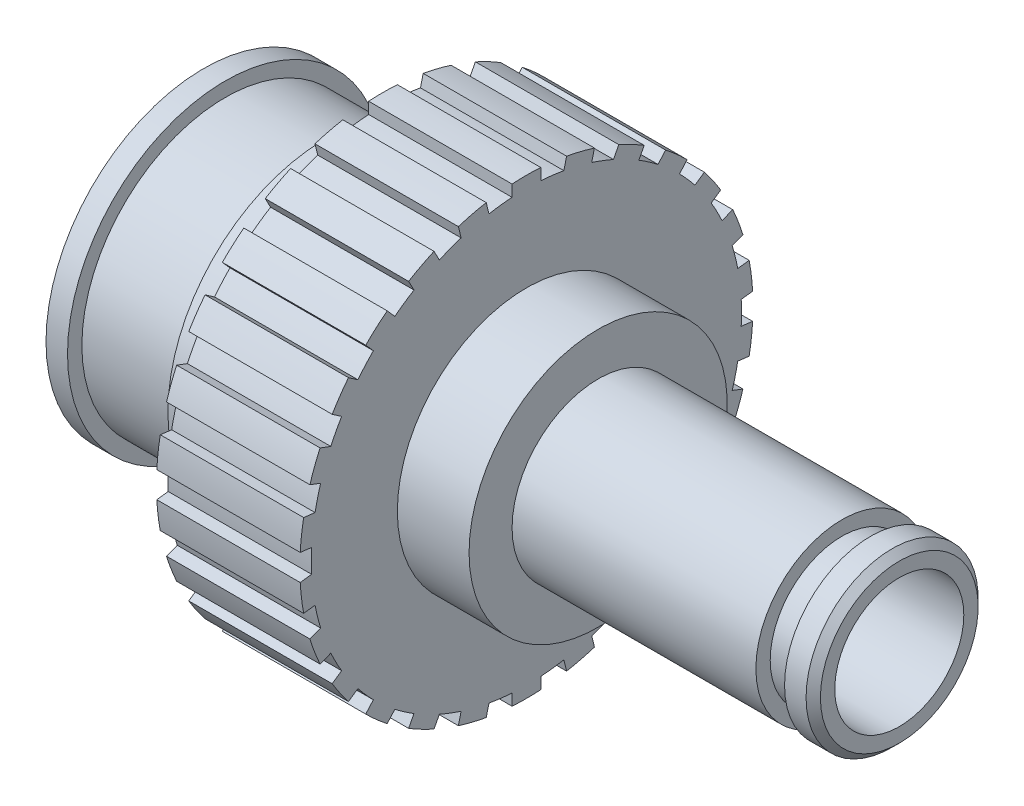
ISO-10303-21;
HEADER;
FILE_DESCRIPTION(('STEP AP214'),'2;1');
FILE_NAME('part.step','',(''),(''),'','','');
FILE_SCHEMA(('AUTOMOTIVE_DESIGN { 1 0 10303 214 1 1 1 1 }'));
ENDSEC;
DATA;
#1=APPLICATION_CONTEXT('core data for automotive mechanical design processes');
#2=APPLICATION_PROTOCOL_DEFINITION('international standard','automotive_design',2000,#1);
#3=PRODUCT_CONTEXT('',#1,'mechanical');
#4=PRODUCT('Part','Part','',(#3));
#5=PRODUCT_RELATED_PRODUCT_CATEGORY('part','',(#4));
#6=PRODUCT_DEFINITION_FORMATION('','',#4);
#7=PRODUCT_DEFINITION_CONTEXT('part definition',#1,'design');
#8=PRODUCT_DEFINITION('design','',#6,#7);
#9=PRODUCT_DEFINITION_SHAPE('','',#8);
#10=(LENGTH_UNIT() NAMED_UNIT(*) SI_UNIT(.MILLI.,.METRE.));
#11=(NAMED_UNIT(*) PLANE_ANGLE_UNIT() SI_UNIT($,.RADIAN.));
#12=(NAMED_UNIT(*) SI_UNIT($,.STERADIAN.) SOLID_ANGLE_UNIT());
#13=UNCERTAINTY_MEASURE_WITH_UNIT(LENGTH_MEASURE(1.E-05),#10,'distance_accuracy_value','');
#14=(GEOMETRIC_REPRESENTATION_CONTEXT(3) GLOBAL_UNCERTAINTY_ASSIGNED_CONTEXT((#13)) GLOBAL_UNIT_ASSIGNED_CONTEXT((#10,
#11,#12)) REPRESENTATION_CONTEXT('',''));
#15=CARTESIAN_POINT('',(0.,0.,0.));
#16=DIRECTION('',(0.,0.,1.));
#17=DIRECTION('',(1.,0.,0.));
#18=AXIS2_PLACEMENT_3D('',#15,#16,#17);
#19=CARTESIAN_POINT('',(-52.9509411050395,0.,0.));
#20=DIRECTION('',(-1.,0.,0.));
#21=DIRECTION('',(0.,0.,1.));
#22=AXIS2_PLACEMENT_3D('',#19,#20,#21);
#23=CYLINDRICAL_SURFACE('',#22,15.);
#24=DIRECTION('',(-1.,0.,0.));
#25=VECTOR('',#24,1.);
#26=CARTESIAN_POINT('',(-52.9509411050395,14.2924108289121,-4.55269070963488));
#27=LINE('',#26,#25);
#28=CARTESIAN_POINT('',(22.5,14.2924108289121,-4.55269070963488));
#29=VERTEX_POINT('',#28);
#30=CARTESIAN_POINT('',(12.5,14.2924108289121,-4.55269070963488));
#31=VERTEX_POINT('',#30);
#32=EDGE_CURVE('E701',#29,#31,#27,.T.);
#33=ORIENTED_EDGE('',*,*,#32,.F.);
#34=CARTESIAN_POINT('',(22.5,0.,0.));
#35=DIRECTION('',(-1.,0.,0.));
#36=DIRECTION('',(0.,0.,1.));
#37=AXIS2_PLACEMENT_3D('',#34,#35,#36);
#38=CIRCLE('',#37,15.);
#39=CARTESIAN_POINT('',(22.5,13.7170154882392,-6.06988353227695));
#40=VERTEX_POINT('',#39);
#41=EDGE_CURVE('E1443',#29,#40,#38,.T.);
#42=ORIENTED_EDGE('',*,*,#41,.T.);
#43=DIRECTION('',(1.,0.,0.));
#44=VECTOR('',#43,1.);
#45=CARTESIAN_POINT('',(12.5,13.7170154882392,-6.06988353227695));
#46=LINE('',#45,#44);
#47=CARTESIAN_POINT('',(12.5,13.7170154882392,-6.06988353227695));
#48=VERTEX_POINT('',#47);
#49=EDGE_CURVE('E725',#48,#40,#46,.T.);
#50=ORIENTED_EDGE('',*,*,#49,.F.);
#51=CARTESIAN_POINT('',(12.5,0.,0.));
#52=DIRECTION('',(-1.,0.,0.));
#53=DIRECTION('',(0.,0.,1.));
#54=AXIS2_PLACEMENT_3D('',#51,#52,#53);
#55=CIRCLE('',#54,15.);
#56=EDGE_CURVE('E41',#31,#48,#55,.T.);
#57=ORIENTED_EDGE('',*,*,#56,.F.);
#58=EDGE_LOOP('',(#33,#42,#50,#57));
#59=FACE_BOUND('',#58,.T.);
#60=ADVANCED_FACE('F26',(#59),#23,.T.);
#61=DIRECTION('',(-1.,0.,0.));
#62=VECTOR('',#61,1.);
#63=CARTESIAN_POINT('',(-52.9509411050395,12.7875691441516,-7.84079558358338));
#64=LINE('',#63,#62);
#65=CARTESIAN_POINT('',(22.5,12.7875691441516,-7.84079558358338));
#66=VERTEX_POINT('',#65);
#67=CARTESIAN_POINT('',(12.5,12.7875691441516,-7.84079558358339));
#68=VERTEX_POINT('',#67);
#69=EDGE_CURVE('E728',#66,#68,#64,.T.);
#70=ORIENTED_EDGE('',*,*,#69,.F.);
#71=CARTESIAN_POINT('',(22.5,11.8658057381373,-9.17620042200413));
#72=VERTEX_POINT('',#71);
#73=EDGE_CURVE('E1624',#66,#72,#38,.T.);
#74=ORIENTED_EDGE('',*,*,#73,.T.);
#75=DIRECTION('',(1.,0.,0.));
#76=VECTOR('',#75,1.);
#77=CARTESIAN_POINT('',(12.5,11.8658057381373,-9.17620042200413));
#78=LINE('',#77,#76);
#79=CARTESIAN_POINT('',(12.5,11.8658057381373,-9.17620042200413));
#80=VERTEX_POINT('',#79);
#81=EDGE_CURVE('E753',#80,#72,#78,.T.);
#82=ORIENTED_EDGE('',*,*,#81,.F.);
#83=EDGE_CURVE('E1644',#68,#80,#55,.T.);
#84=ORIENTED_EDGE('',*,*,#83,.F.);
#85=EDGE_LOOP('',(#70,#74,#82,#84));
#86=FACE_BOUND('',#85,.T.);
#87=ADVANCED_FACE('F1492',(#86),#23,.T.);
#88=DIRECTION('',(-1.,0.,0.));
#89=VECTOR('',#88,1.);
#90=CARTESIAN_POINT('',(-52.9509411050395,10.5395604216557,-10.6732219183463));
#91=LINE('',#90,#89);
#92=CARTESIAN_POINT('',(22.5,10.5395604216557,-10.6732219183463));
#93=VERTEX_POINT('',#92);
#94=CARTESIAN_POINT('',(12.5,10.5395604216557,-10.6732219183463));
#95=VERTEX_POINT('',#94);
#96=EDGE_CURVE('E756',#93,#95,#91,.T.);
#97=ORIENTED_EDGE('',*,*,#96,.F.);
#98=CARTESIAN_POINT('',(22.5,9.32499848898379,-11.7492298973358));
#99=VERTEX_POINT('',#98);
#100=EDGE_CURVE('E1620',#93,#99,#38,.T.);
#101=ORIENTED_EDGE('',*,*,#100,.T.);
#102=DIRECTION('',(1.,0.,0.));
#103=VECTOR('',#102,1.);
#104=CARTESIAN_POINT('',(12.5,9.32499848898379,-11.7492298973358));
#105=LINE('',#104,#103);
#106=CARTESIAN_POINT('',(12.5,9.32499848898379,-11.7492298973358));
#107=VERTEX_POINT('',#106);
#108=EDGE_CURVE('E781',#107,#99,#105,.T.);
#109=ORIENTED_EDGE('',*,*,#108,.F.);
#110=EDGE_CURVE('E1645',#95,#107,#55,.T.);
#111=ORIENTED_EDGE('',*,*,#110,.F.);
#112=EDGE_LOOP('',(#97,#101,#109,#111));
#113=FACE_BOUND('',#112,.T.);
#114=ADVANCED_FACE('F1499',(#113),#23,.T.);
#115=DIRECTION('',(-1.,0.,0.));
#116=VECTOR('',#115,1.);
#117=CARTESIAN_POINT('',(-52.9509411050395,7.67903075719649,-12.8853593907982));
#118=LINE('',#117,#116);
#119=CARTESIAN_POINT('',(22.5,7.67903075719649,-12.8853593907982));
#120=VERTEX_POINT('',#119);
#121=CARTESIAN_POINT('',(12.5,7.67903075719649,-12.8853593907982));
#122=VERTEX_POINT('',#121);
#123=EDGE_CURVE('E784',#120,#122,#118,.T.);
#124=ORIENTED_EDGE('',*,*,#123,.F.);
#125=CARTESIAN_POINT('',(22.5,6.24225622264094,-13.6394368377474));
#126=VERTEX_POINT('',#125);
#127=EDGE_CURVE('E1616',#120,#126,#38,.T.);
#128=ORIENTED_EDGE('',*,*,#127,.T.);
#129=DIRECTION('',(1.,0.,0.));
#130=VECTOR('',#129,1.);
#131=CARTESIAN_POINT('',(12.5,6.24225622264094,-13.6394368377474));
#132=LINE('',#131,#130);
#133=CARTESIAN_POINT('',(12.5,6.24225622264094,-13.6394368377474));
#134=VERTEX_POINT('',#133);
#135=EDGE_CURVE('E809',#134,#126,#132,.T.);
#136=ORIENTED_EDGE('',*,*,#135,.F.);
#137=EDGE_CURVE('E1647',#122,#134,#55,.T.);
#138=ORIENTED_EDGE('',*,*,#137,.F.);
#139=EDGE_LOOP('',(#124,#128,#136,#138));
#140=FACE_BOUND('',#139,.T.);
#141=ADVANCED_FACE('F1927',(#140),#23,.T.);
#142=DIRECTION('',(-1.,0.,0.));
#143=VECTOR('',#142,1.);
#144=CARTESIAN_POINT('',(-52.9509411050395,4.37222373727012,-14.3486466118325));
#145=LINE('',#144,#143);
#146=CARTESIAN_POINT('',(22.5,4.37222373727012,-14.3486466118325));
#147=VERTEX_POINT('',#146);
#148=CARTESIAN_POINT('',(12.5,4.37222373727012,-14.3486466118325));
#149=VERTEX_POINT('',#148);
#150=EDGE_CURVE('E812',#147,#149,#145,.T.);
#151=ORIENTED_EDGE('',*,*,#150,.F.);
#152=CARTESIAN_POINT('',(22.5,2.79673671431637,-14.7369692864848));
#153=VERTEX_POINT('',#152);
#154=EDGE_CURVE('E1612',#147,#153,#38,.T.);
#155=ORIENTED_EDGE('',*,*,#154,.T.);
#156=DIRECTION('',(1.,0.,0.));
#157=VECTOR('',#156,1.);
#158=CARTESIAN_POINT('',(12.5,2.79673671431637,-14.7369692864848));
#159=LINE('',#158,#157);
#160=CARTESIAN_POINT('',(12.5,2.79673671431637,-14.7369692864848));
#161=VERTEX_POINT('',#160);
#162=EDGE_CURVE('E837',#161,#153,#159,.T.);
#163=ORIENTED_EDGE('',*,*,#162,.F.);
#164=EDGE_CURVE('E1649',#149,#161,#55,.T.);
#165=ORIENTED_EDGE('',*,*,#164,.F.);
#166=EDGE_LOOP('',(#151,#155,#163,#165));
#167=FACE_BOUND('',#166,.T.);
#168=ADVANCED_FACE('F1915',(#167),#23,.T.);
#169=DIRECTION('',(-1.,0.,0.));
#170=VECTOR('',#169,1.);
#171=CARTESIAN_POINT('',(-52.9509411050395,0.81131896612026,-14.9780426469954));
#172=LINE('',#171,#170);
#173=CARTESIAN_POINT('',(22.5,0.81131896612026,-14.9780426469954));
#174=VERTEX_POINT('',#173);
#175=CARTESIAN_POINT('',(12.5,0.811318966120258,-14.9780426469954));
#176=VERTEX_POINT('',#175);
#177=EDGE_CURVE('E840',#174,#176,#172,.T.);
#178=ORIENTED_EDGE('',*,*,#177,.F.);
#179=CARTESIAN_POINT('',(22.5,-0.811318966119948,-14.9780426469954));
#180=VERTEX_POINT('',#179);
#181=EDGE_CURVE('E1608',#174,#180,#38,.T.);
#182=ORIENTED_EDGE('',*,*,#181,.T.);
#183=DIRECTION('',(1.,0.,0.));
#184=VECTOR('',#183,1.);
#185=CARTESIAN_POINT('',(12.5,-0.811318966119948,-14.9780426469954));
#186=LINE('',#185,#184);
#187=CARTESIAN_POINT('',(12.5,-0.811318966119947,-14.9780426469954));
#188=VERTEX_POINT('',#187);
#189=EDGE_CURVE('E865',#188,#180,#186,.T.);
#190=ORIENTED_EDGE('',*,*,#189,.F.);
#191=EDGE_CURVE('E1651',#176,#188,#55,.T.);
#192=ORIENTED_EDGE('',*,*,#191,.F.);
#193=EDGE_LOOP('',(#178,#182,#190,#192));
#194=FACE_BOUND('',#193,.T.);
#195=ADVANCED_FACE('F1903',(#194),#23,.T.);
#196=DIRECTION('',(-1.,0.,0.));
#197=VECTOR('',#196,1.);
#198=CARTESIAN_POINT('',(-52.9509411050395,-2.79673671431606,-14.7369692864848));
#199=LINE('',#198,#197);
#200=CARTESIAN_POINT('',(22.5,-2.79673671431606,-14.7369692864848));
#201=VERTEX_POINT('',#200);
#202=CARTESIAN_POINT('',(12.5,-2.79673671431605,-14.7369692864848));
#203=VERTEX_POINT('',#202);
#204=EDGE_CURVE('E868',#201,#203,#199,.T.);
#205=ORIENTED_EDGE('',*,*,#204,.F.);
#206=CARTESIAN_POINT('',(22.5,-4.37222373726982,-14.3486466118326));
#207=VERTEX_POINT('',#206);
#208=EDGE_CURVE('E1604',#201,#207,#38,.T.);
#209=ORIENTED_EDGE('',*,*,#208,.T.);
#210=DIRECTION('',(1.,0.,0.));
#211=VECTOR('',#210,1.);
#212=CARTESIAN_POINT('',(12.5,-4.37222373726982,-14.3486466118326));
#213=LINE('',#212,#211);
#214=CARTESIAN_POINT('',(12.5,-4.37222373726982,-14.3486466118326));
#215=VERTEX_POINT('',#214);
#216=EDGE_CURVE('E893',#215,#207,#213,.T.);
#217=ORIENTED_EDGE('',*,*,#216,.F.);
#218=EDGE_CURVE('E1653',#203,#215,#55,.T.);
#219=ORIENTED_EDGE('',*,*,#218,.F.);
#220=EDGE_LOOP('',(#205,#209,#217,#219));
#221=FACE_BOUND('',#220,.T.);
#222=ADVANCED_FACE('F1891',(#221),#23,.T.);
#223=DIRECTION('',(-1.,0.,0.));
#224=VECTOR('',#223,1.);
#225=CARTESIAN_POINT('',(-52.9509411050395,-6.24225622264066,-13.6394368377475));
#226=LINE('',#225,#224);
#227=CARTESIAN_POINT('',(22.5,-6.24225622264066,-13.6394368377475));
#228=VERTEX_POINT('',#227);
#229=CARTESIAN_POINT('',(12.5,-6.24225622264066,-13.6394368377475));
#230=VERTEX_POINT('',#229);
#231=EDGE_CURVE('E896',#228,#230,#226,.T.);
#232=ORIENTED_EDGE('',*,*,#231,.F.);
#233=CARTESIAN_POINT('',(22.5,-7.67903075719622,-12.8853593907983));
#234=VERTEX_POINT('',#233);
#235=EDGE_CURVE('E1600',#228,#234,#38,.T.);
#236=ORIENTED_EDGE('',*,*,#235,.T.);
#237=DIRECTION('',(1.,0.,0.));
#238=VECTOR('',#237,1.);
#239=CARTESIAN_POINT('',(12.5,-7.67903075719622,-12.8853593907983));
#240=LINE('',#239,#238);
#241=CARTESIAN_POINT('',(12.5,-7.67903075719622,-12.8853593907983));
#242=VERTEX_POINT('',#241);
#243=EDGE_CURVE('E921',#242,#234,#240,.T.);
#244=ORIENTED_EDGE('',*,*,#243,.F.);
#245=EDGE_CURVE('E1655',#230,#242,#55,.T.);
#246=ORIENTED_EDGE('',*,*,#245,.F.);
#247=EDGE_LOOP('',(#232,#236,#244,#246));
#248=FACE_BOUND('',#247,.T.);
#249=ADVANCED_FACE('F1879',(#248),#23,.T.);
#250=DIRECTION('',(-1.,0.,0.));
#251=VECTOR('',#250,1.);
#252=CARTESIAN_POINT('',(-52.9509411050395,-9.32499848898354,-11.749229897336));
#253=LINE('',#252,#251);
#254=CARTESIAN_POINT('',(22.5,-9.32499848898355,-11.749229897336));
#255=VERTEX_POINT('',#254);
#256=CARTESIAN_POINT('',(12.5,-9.32499848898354,-11.749229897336));
#257=VERTEX_POINT('',#256);
#258=EDGE_CURVE('E924',#255,#257,#253,.T.);
#259=ORIENTED_EDGE('',*,*,#258,.F.);
#260=CARTESIAN_POINT('',(22.5,-10.5395604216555,-10.6732219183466));
#261=VERTEX_POINT('',#260);
#262=EDGE_CURVE('E1596',#255,#261,#38,.T.);
#263=ORIENTED_EDGE('',*,*,#262,.T.);
#264=DIRECTION('',(1.,0.,0.));
#265=VECTOR('',#264,1.);
#266=CARTESIAN_POINT('',(12.5,-10.5395604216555,-10.6732219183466));
#267=LINE('',#266,#265);
#268=CARTESIAN_POINT('',(12.5,-10.5395604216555,-10.6732219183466));
#269=VERTEX_POINT('',#268);
#270=EDGE_CURVE('E949',#269,#261,#267,.T.);
#271=ORIENTED_EDGE('',*,*,#270,.F.);
#272=EDGE_CURVE('E1657',#257,#269,#55,.T.);
#273=ORIENTED_EDGE('',*,*,#272,.F.);
#274=EDGE_LOOP('',(#259,#263,#271,#273));
#275=FACE_BOUND('',#274,.T.);
#276=ADVANCED_FACE('F1867',(#275),#23,.T.);
#277=DIRECTION('',(-1.,0.,0.));
#278=VECTOR('',#277,1.);
#279=CARTESIAN_POINT('',(-52.9509411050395,-11.8658057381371,-9.17620042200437));
#280=LINE('',#279,#278);
#281=CARTESIAN_POINT('',(22.5,-11.8658057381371,-9.17620042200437));
#282=VERTEX_POINT('',#281);
#283=CARTESIAN_POINT('',(12.5,-11.8658057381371,-9.17620042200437));
#284=VERTEX_POINT('',#283);
#285=EDGE_CURVE('E952',#282,#284,#280,.T.);
#286=ORIENTED_EDGE('',*,*,#285,.F.);
#287=CARTESIAN_POINT('',(22.5,-12.7875691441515,-7.84079558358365));
#288=VERTEX_POINT('',#287);
#289=EDGE_CURVE('E1592',#282,#288,#38,.T.);
#290=ORIENTED_EDGE('',*,*,#289,.T.);
#291=DIRECTION('',(1.,0.,0.));
#292=VECTOR('',#291,1.);
#293=CARTESIAN_POINT('',(12.5,-12.7875691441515,-7.84079558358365));
#294=LINE('',#293,#292);
#295=CARTESIAN_POINT('',(12.5,-12.7875691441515,-7.84079558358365));
#296=VERTEX_POINT('',#295);
#297=EDGE_CURVE('E977',#296,#288,#294,.T.);
#298=ORIENTED_EDGE('',*,*,#297,.F.);
#299=EDGE_CURVE('E1659',#284,#296,#55,.T.);
#300=ORIENTED_EDGE('',*,*,#299,.F.);
#301=EDGE_LOOP('',(#286,#290,#298,#300));
#302=FACE_BOUND('',#301,.T.);
#303=ADVANCED_FACE('F1855',(#302),#23,.T.);
#304=DIRECTION('',(-1.,0.,0.));
#305=VECTOR('',#304,1.);
#306=CARTESIAN_POINT('',(-52.9509411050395,-13.717015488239,-6.06988353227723));
#307=LINE('',#306,#305);
#308=CARTESIAN_POINT('',(22.5,-13.717015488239,-6.06988353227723));
#309=VERTEX_POINT('',#308);
#310=CARTESIAN_POINT('',(12.5,-13.717015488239,-6.06988353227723));
#311=VERTEX_POINT('',#310);
#312=EDGE_CURVE('E980',#309,#311,#307,.T.);
#313=ORIENTED_EDGE('',*,*,#312,.F.);
#314=CARTESIAN_POINT('',(22.5,-14.292410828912,-4.55269070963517));
#315=VERTEX_POINT('',#314);
#316=EDGE_CURVE('E1588',#309,#315,#38,.T.);
#317=ORIENTED_EDGE('',*,*,#316,.T.);
#318=DIRECTION('',(1.,0.,0.));
#319=VECTOR('',#318,1.);
#320=CARTESIAN_POINT('',(12.5,-14.292410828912,-4.55269070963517));
#321=LINE('',#320,#319);
#322=CARTESIAN_POINT('',(12.5,-14.292410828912,-4.55269070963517));
#323=VERTEX_POINT('',#322);
#324=EDGE_CURVE('E1005',#323,#315,#321,.T.);
#325=ORIENTED_EDGE('',*,*,#324,.F.);
#326=EDGE_CURVE('E1661',#311,#323,#55,.T.);
#327=ORIENTED_EDGE('',*,*,#326,.F.);
#328=EDGE_LOOP('',(#313,#317,#325,#327));
#329=FACE_BOUND('',#328,.T.);
#330=ADVANCED_FACE('F1843',(#329),#23,.T.);
#331=DIRECTION('',(-1.,0.,0.));
#332=VECTOR('',#331,1.);
#333=CARTESIAN_POINT('',(-52.9509411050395,-14.7710421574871,-2.61080707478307));
#334=LINE('',#333,#332);
#335=CARTESIAN_POINT('',(22.5,-14.7710421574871,-2.61080707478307));
#336=VERTEX_POINT('',#335);
#337=CARTESIAN_POINT('',(12.5,-14.7710421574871,-2.61080707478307));
#338=VERTEX_POINT('',#337);
#339=EDGE_CURVE('E1008',#336,#338,#334,.T.);
#340=ORIENTED_EDGE('',*,*,#339,.F.);
#341=CARTESIAN_POINT('',(22.5,-14.9666295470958,-1.0000000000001));
#342=VERTEX_POINT('',#341);
#343=EDGE_CURVE('E1584',#336,#342,#38,.T.);
#344=ORIENTED_EDGE('',*,*,#343,.T.);
#345=DIRECTION('',(1.,0.,0.));
#346=VECTOR('',#345,1.);
#347=CARTESIAN_POINT('',(12.5,-14.9666295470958,-1.0000000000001));
#348=LINE('',#347,#346);
#349=CARTESIAN_POINT('',(12.5,-14.9666295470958,-1.0000000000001));
#350=VERTEX_POINT('',#349);
#351=EDGE_CURVE('E1033',#350,#342,#348,.T.);
#352=ORIENTED_EDGE('',*,*,#351,.F.);
#353=EDGE_CURVE('E1663',#338,#350,#55,.T.);
#354=ORIENTED_EDGE('',*,*,#353,.F.);
#355=EDGE_LOOP('',(#340,#344,#352,#354));
#356=FACE_BOUND('',#355,.T.);
#357=ADVANCED_FACE('F1831',(#356),#23,.T.);
#358=DIRECTION('',(-1.,0.,0.));
#359=VECTOR('',#358,1.);
#360=CARTESIAN_POINT('',(-52.9509411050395,-14.9666295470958,0.999999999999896));
#361=LINE('',#360,#359);
#362=CARTESIAN_POINT('',(22.5,-14.9666295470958,0.999999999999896));
#363=VERTEX_POINT('',#362);
#364=CARTESIAN_POINT('',(12.5,-14.9666295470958,0.999999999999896));
#365=VERTEX_POINT('',#364);
#366=EDGE_CURVE('E1036',#363,#365,#361,.T.);
#367=ORIENTED_EDGE('',*,*,#366,.F.);
#368=CARTESIAN_POINT('',(22.5,-14.7710421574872,2.61080707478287));
#369=VERTEX_POINT('',#368);
#370=EDGE_CURVE('E1580',#363,#369,#38,.T.);
#371=ORIENTED_EDGE('',*,*,#370,.T.);
#372=DIRECTION('',(1.,0.,0.));
#373=VECTOR('',#372,1.);
#374=CARTESIAN_POINT('',(12.5,-14.7710421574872,2.61080707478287));
#375=LINE('',#374,#373);
#376=CARTESIAN_POINT('',(12.5,-14.7710421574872,2.61080707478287));
#377=VERTEX_POINT('',#376);
#378=EDGE_CURVE('E1061',#377,#369,#375,.T.);
#379=ORIENTED_EDGE('',*,*,#378,.F.);
#380=EDGE_CURVE('E1665',#365,#377,#55,.T.);
#381=ORIENTED_EDGE('',*,*,#380,.F.);
#382=EDGE_LOOP('',(#367,#371,#379,#381));
#383=FACE_BOUND('',#382,.T.);
#384=ADVANCED_FACE('F1819',(#383),#23,.T.);
#385=DIRECTION('',(-1.,0.,0.));
#386=VECTOR('',#385,1.);
#387=CARTESIAN_POINT('',(-52.9509411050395,-14.2924108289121,4.55269070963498));
#388=LINE('',#387,#386);
#389=CARTESIAN_POINT('',(22.5,-14.2924108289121,4.55269070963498));
#390=VERTEX_POINT('',#389);
#391=CARTESIAN_POINT('',(12.5,-14.2924108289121,4.55269070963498));
#392=VERTEX_POINT('',#391);
#393=EDGE_CURVE('E1064',#390,#392,#388,.T.);
#394=ORIENTED_EDGE('',*,*,#393,.F.);
#395=CARTESIAN_POINT('',(22.5,-13.7170154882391,6.06988353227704));
#396=VERTEX_POINT('',#395);
#397=EDGE_CURVE('E1576',#390,#396,#38,.T.);
#398=ORIENTED_EDGE('',*,*,#397,.T.);
#399=DIRECTION('',(1.,0.,0.));
#400=VECTOR('',#399,1.);
#401=CARTESIAN_POINT('',(12.5,-13.7170154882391,6.06988353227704));
#402=LINE('',#401,#400);
#403=CARTESIAN_POINT('',(12.5,-13.7170154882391,6.06988353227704));
#404=VERTEX_POINT('',#403);
#405=EDGE_CURVE('E1089',#404,#396,#402,.T.);
#406=ORIENTED_EDGE('',*,*,#405,.F.);
#407=EDGE_CURVE('E1667',#392,#404,#55,.T.);
#408=ORIENTED_EDGE('',*,*,#407,.F.);
#409=EDGE_LOOP('',(#394,#398,#406,#408));
#410=FACE_BOUND('',#409,.T.);
#411=ADVANCED_FACE('F1807',(#410),#23,.T.);
#412=DIRECTION('',(-1.,0.,0.));
#413=VECTOR('',#412,1.);
#414=CARTESIAN_POINT('',(-52.9509411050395,-12.7875691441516,7.84079558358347));
#415=LINE('',#414,#413);
#416=CARTESIAN_POINT('',(22.5,-12.7875691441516,7.84079558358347));
#417=VERTEX_POINT('',#416);
#418=CARTESIAN_POINT('',(12.5,-12.7875691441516,7.84079558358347));
#419=VERTEX_POINT('',#418);
#420=EDGE_CURVE('E1092',#417,#419,#415,.T.);
#421=ORIENTED_EDGE('',*,*,#420,.F.);
#422=CARTESIAN_POINT('',(22.5,-11.8658057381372,9.17620042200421));
#423=VERTEX_POINT('',#422);
#424=EDGE_CURVE('E1572',#417,#423,#38,.T.);
#425=ORIENTED_EDGE('',*,*,#424,.T.);
#426=DIRECTION('',(1.,0.,0.));
#427=VECTOR('',#426,1.);
#428=CARTESIAN_POINT('',(12.5,-11.8658057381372,9.17620042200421));
#429=LINE('',#428,#427);
#430=CARTESIAN_POINT('',(12.5,-11.8658057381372,9.17620042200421));
#431=VERTEX_POINT('',#430);
#432=EDGE_CURVE('E1117',#431,#423,#429,.T.);
#433=ORIENTED_EDGE('',*,*,#432,.F.);
#434=EDGE_CURVE('E1669',#419,#431,#55,.T.);
#435=ORIENTED_EDGE('',*,*,#434,.F.);
#436=EDGE_LOOP('',(#421,#425,#433,#435));
#437=FACE_BOUND('',#436,.T.);
#438=ADVANCED_FACE('F1795',(#437),#23,.T.);
#439=DIRECTION('',(-1.,0.,0.));
#440=VECTOR('',#439,1.);
#441=CARTESIAN_POINT('',(-52.9509411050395,-10.5395604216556,10.6732219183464));
#442=LINE('',#441,#440);
#443=CARTESIAN_POINT('',(22.5,-10.5395604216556,10.6732219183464));
#444=VERTEX_POINT('',#443);
#445=CARTESIAN_POINT('',(12.5,-10.5395604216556,10.6732219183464));
#446=VERTEX_POINT('',#445);
#447=EDGE_CURVE('E1120',#444,#446,#442,.T.);
#448=ORIENTED_EDGE('',*,*,#447,.F.);
#449=CARTESIAN_POINT('',(22.5,-9.3249984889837,11.7492298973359));
#450=VERTEX_POINT('',#449);
#451=EDGE_CURVE('E1568',#444,#450,#38,.T.);
#452=ORIENTED_EDGE('',*,*,#451,.T.);
#453=DIRECTION('',(1.,0.,0.));
#454=VECTOR('',#453,1.);
#455=CARTESIAN_POINT('',(12.5,-9.3249984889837,11.7492298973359));
#456=LINE('',#455,#454);
#457=CARTESIAN_POINT('',(12.5,-9.3249984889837,11.7492298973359));
#458=VERTEX_POINT('',#457);
#459=EDGE_CURVE('E1145',#458,#450,#456,.T.);
#460=ORIENTED_EDGE('',*,*,#459,.F.);
#461=EDGE_CURVE('E1671',#446,#458,#55,.T.);
#462=ORIENTED_EDGE('',*,*,#461,.F.);
#463=EDGE_LOOP('',(#448,#452,#460,#462));
#464=FACE_BOUND('',#463,.T.);
#465=ADVANCED_FACE('F1783',(#464),#23,.T.);
#466=DIRECTION('',(-1.,0.,0.));
#467=VECTOR('',#466,1.);
#468=CARTESIAN_POINT('',(-52.9509411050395,-7.67903075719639,12.8853593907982));
#469=LINE('',#468,#467);
#470=CARTESIAN_POINT('',(22.5,-7.67903075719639,12.8853593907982));
#471=VERTEX_POINT('',#470);
#472=CARTESIAN_POINT('',(12.5,-7.67903075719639,12.8853593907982));
#473=VERTEX_POINT('',#472);
#474=EDGE_CURVE('E1148',#471,#473,#469,.T.);
#475=ORIENTED_EDGE('',*,*,#474,.F.);
#476=CARTESIAN_POINT('',(22.5,-6.24225622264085,13.6394368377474));
#477=VERTEX_POINT('',#476);
#478=EDGE_CURVE('E1564',#471,#477,#38,.T.);
#479=ORIENTED_EDGE('',*,*,#478,.T.);
#480=DIRECTION('',(1.,0.,0.));
#481=VECTOR('',#480,1.);
#482=CARTESIAN_POINT('',(12.5,-6.24225622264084,13.6394368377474));
#483=LINE('',#482,#481);
#484=CARTESIAN_POINT('',(12.5,-6.24225622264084,13.6394368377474));
#485=VERTEX_POINT('',#484);
#486=EDGE_CURVE('E1173',#485,#477,#483,.T.);
#487=ORIENTED_EDGE('',*,*,#486,.F.);
#488=EDGE_CURVE('E1673',#473,#485,#55,.T.);
#489=ORIENTED_EDGE('',*,*,#488,.F.);
#490=EDGE_LOOP('',(#475,#479,#487,#489));
#491=FACE_BOUND('',#490,.T.);
#492=ADVANCED_FACE('F1771',(#491),#23,.T.);
#493=DIRECTION('',(-1.,0.,0.));
#494=VECTOR('',#493,1.);
#495=CARTESIAN_POINT('',(-52.9509411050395,-4.37222373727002,14.3486466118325));
#496=LINE('',#495,#494);
#497=CARTESIAN_POINT('',(22.5,-4.37222373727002,14.3486466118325));
#498=VERTEX_POINT('',#497);
#499=CARTESIAN_POINT('',(12.5,-4.37222373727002,14.3486466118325));
#500=VERTEX_POINT('',#499);
#501=EDGE_CURVE('E1176',#498,#500,#496,.T.);
#502=ORIENTED_EDGE('',*,*,#501,.F.);
#503=CARTESIAN_POINT('',(22.5,-2.79673671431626,14.7369692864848));
#504=VERTEX_POINT('',#503);
#505=EDGE_CURVE('E1560',#498,#504,#38,.T.);
#506=ORIENTED_EDGE('',*,*,#505,.T.);
#507=DIRECTION('',(1.,0.,0.));
#508=VECTOR('',#507,1.);
#509=CARTESIAN_POINT('',(12.5,-2.79673671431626,14.7369692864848));
#510=LINE('',#509,#508);
#511=CARTESIAN_POINT('',(12.5,-2.79673671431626,14.7369692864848));
#512=VERTEX_POINT('',#511);
#513=EDGE_CURVE('E1201',#512,#504,#510,.T.);
#514=ORIENTED_EDGE('',*,*,#513,.F.);
#515=EDGE_CURVE('E1675',#500,#512,#55,.T.);
#516=ORIENTED_EDGE('',*,*,#515,.F.);
#517=EDGE_LOOP('',(#502,#506,#514,#516));
#518=FACE_BOUND('',#517,.T.);
#519=ADVANCED_FACE('F1759',(#518),#23,.T.);
#520=DIRECTION('',(-1.,0.,0.));
#521=VECTOR('',#520,1.);
#522=CARTESIAN_POINT('',(-52.9509411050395,-0.811318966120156,14.9780426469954));
#523=LINE('',#522,#521);
#524=CARTESIAN_POINT('',(22.5,-0.811318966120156,14.9780426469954));
#525=VERTEX_POINT('',#524);
#526=CARTESIAN_POINT('',(12.5,-0.811318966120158,14.9780426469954));
#527=VERTEX_POINT('',#526);
#528=EDGE_CURVE('E1204',#525,#527,#523,.T.);
#529=ORIENTED_EDGE('',*,*,#528,.F.);
#530=CARTESIAN_POINT('',(22.5,0.811318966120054,14.9780426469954));
#531=VERTEX_POINT('',#530);
#532=EDGE_CURVE('E1556',#525,#531,#38,.T.);
#533=ORIENTED_EDGE('',*,*,#532,.T.);
#534=DIRECTION('',(1.,0.,0.));
#535=VECTOR('',#534,1.);
#536=CARTESIAN_POINT('',(12.5,0.811318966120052,14.9780426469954));
#537=LINE('',#536,#535);
#538=CARTESIAN_POINT('',(12.5,0.811318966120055,14.9780426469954));
#539=VERTEX_POINT('',#538);
#540=EDGE_CURVE('E1229',#539,#531,#537,.T.);
#541=ORIENTED_EDGE('',*,*,#540,.F.);
#542=EDGE_CURVE('E1677',#527,#539,#55,.T.);
#543=ORIENTED_EDGE('',*,*,#542,.F.);
#544=EDGE_LOOP('',(#529,#533,#541,#543));
#545=FACE_BOUND('',#544,.T.);
#546=ADVANCED_FACE('F1747',(#545),#23,.T.);
#547=DIRECTION('',(-1.,0.,0.));
#548=VECTOR('',#547,1.);
#549=CARTESIAN_POINT('',(-52.9509411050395,2.79673671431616,14.7369692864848));
#550=LINE('',#549,#548);
#551=CARTESIAN_POINT('',(22.5,2.79673671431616,14.7369692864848));
#552=VERTEX_POINT('',#551);
#553=CARTESIAN_POINT('',(12.5,2.79673671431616,14.7369692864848));
#554=VERTEX_POINT('',#553);
#555=EDGE_CURVE('E1232',#552,#554,#550,.T.);
#556=ORIENTED_EDGE('',*,*,#555,.F.);
#557=CARTESIAN_POINT('',(22.5,4.37222373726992,14.3486466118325));
#558=VERTEX_POINT('',#557);
#559=EDGE_CURVE('E1552',#552,#558,#38,.T.);
#560=ORIENTED_EDGE('',*,*,#559,.T.);
#561=DIRECTION('',(1.,0.,0.));
#562=VECTOR('',#561,1.);
#563=CARTESIAN_POINT('',(12.5,4.37222373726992,14.3486466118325));
#564=LINE('',#563,#562);
#565=CARTESIAN_POINT('',(12.5,4.37222373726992,14.3486466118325));
#566=VERTEX_POINT('',#565);
#567=EDGE_CURVE('E1257',#566,#558,#564,.T.);
#568=ORIENTED_EDGE('',*,*,#567,.F.);
#569=EDGE_CURVE('E1679',#554,#566,#55,.T.);
#570=ORIENTED_EDGE('',*,*,#569,.F.);
#571=EDGE_LOOP('',(#556,#560,#568,#570));
#572=FACE_BOUND('',#571,.T.);
#573=ADVANCED_FACE('F1735',(#572),#23,.T.);
#574=DIRECTION('',(-1.,0.,0.));
#575=VECTOR('',#574,1.);
#576=CARTESIAN_POINT('',(-52.9509411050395,6.24225622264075,13.6394368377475));
#577=LINE('',#576,#575);
#578=CARTESIAN_POINT('',(22.5,6.24225622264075,13.6394368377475));
#579=VERTEX_POINT('',#578);
#580=CARTESIAN_POINT('',(12.5,6.24225622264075,13.6394368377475));
#581=VERTEX_POINT('',#580);
#582=EDGE_CURVE('E1260',#579,#581,#577,.T.);
#583=ORIENTED_EDGE('',*,*,#582,.F.);
#584=CARTESIAN_POINT('',(22.5,7.6790307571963,12.8853593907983));
#585=VERTEX_POINT('',#584);
#586=EDGE_CURVE('E1548',#579,#585,#38,.T.);
#587=ORIENTED_EDGE('',*,*,#586,.T.);
#588=DIRECTION('',(1.,0.,0.));
#589=VECTOR('',#588,1.);
#590=CARTESIAN_POINT('',(12.5,7.67903075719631,12.8853593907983));
#591=LINE('',#590,#589);
#592=CARTESIAN_POINT('',(12.5,7.67903075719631,12.8853593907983));
#593=VERTEX_POINT('',#592);
#594=EDGE_CURVE('E1285',#593,#585,#591,.T.);
#595=ORIENTED_EDGE('',*,*,#594,.F.);
#596=EDGE_CURVE('E1681',#581,#593,#55,.T.);
#597=ORIENTED_EDGE('',*,*,#596,.F.);
#598=EDGE_LOOP('',(#583,#587,#595,#597));
#599=FACE_BOUND('',#598,.T.);
#600=ADVANCED_FACE('F1723',(#599),#23,.T.);
#601=DIRECTION('',(-1.,0.,0.));
#602=VECTOR('',#601,1.);
#603=CARTESIAN_POINT('',(-52.9509411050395,9.32499848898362,11.749229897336));
#604=LINE('',#603,#602);
#605=CARTESIAN_POINT('',(22.5,9.32499848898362,11.749229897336));
#606=VERTEX_POINT('',#605);
#607=CARTESIAN_POINT('',(12.5,9.32499848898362,11.749229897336));
#608=VERTEX_POINT('',#607);
#609=EDGE_CURVE('E1288',#606,#608,#604,.T.);
#610=ORIENTED_EDGE('',*,*,#609,.F.);
#611=CARTESIAN_POINT('',(22.5,10.5395604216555,10.6732219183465));
#612=VERTEX_POINT('',#611);
#613=EDGE_CURVE('E1544',#606,#612,#38,.T.);
#614=ORIENTED_EDGE('',*,*,#613,.T.);
#615=DIRECTION('',(1.,0.,0.));
#616=VECTOR('',#615,1.);
#617=CARTESIAN_POINT('',(12.5,10.5395604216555,10.6732219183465));
#618=LINE('',#617,#616);
#619=CARTESIAN_POINT('',(12.5,10.5395604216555,10.6732219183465));
#620=VERTEX_POINT('',#619);
#621=EDGE_CURVE('E1313',#620,#612,#618,.T.);
#622=ORIENTED_EDGE('',*,*,#621,.F.);
#623=EDGE_CURVE('E1683',#608,#620,#55,.T.);
#624=ORIENTED_EDGE('',*,*,#623,.F.);
#625=EDGE_LOOP('',(#610,#614,#622,#624));
#626=FACE_BOUND('',#625,.T.);
#627=ADVANCED_FACE('F1711',(#626),#23,.T.);
#628=DIRECTION('',(-1.,0.,0.));
#629=VECTOR('',#628,1.);
#630=CARTESIAN_POINT('',(-52.9509411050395,11.8658057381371,9.17620042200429));
#631=LINE('',#630,#629);
#632=CARTESIAN_POINT('',(22.5,11.8658057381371,9.17620042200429));
#633=VERTEX_POINT('',#632);
#634=CARTESIAN_POINT('',(12.5,11.8658057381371,9.17620042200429));
#635=VERTEX_POINT('',#634);
#636=EDGE_CURVE('E1316',#633,#635,#631,.T.);
#637=ORIENTED_EDGE('',*,*,#636,.F.);
#638=CARTESIAN_POINT('',(22.5,12.7875691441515,7.84079558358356));
#639=VERTEX_POINT('',#638);
#640=EDGE_CURVE('E1543',#633,#639,#38,.T.);
#641=ORIENTED_EDGE('',*,*,#640,.T.);
#642=DIRECTION('',(1.,0.,0.));
#643=VECTOR('',#642,1.);
#644=CARTESIAN_POINT('',(12.5,12.7875691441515,7.84079558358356));
#645=LINE('',#644,#643);
#646=CARTESIAN_POINT('',(12.5,12.7875691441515,7.84079558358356));
#647=VERTEX_POINT('',#646);
#648=EDGE_CURVE('E1341',#647,#639,#645,.T.);
#649=ORIENTED_EDGE('',*,*,#648,.F.);
#650=EDGE_CURVE('E1685',#635,#647,#55,.T.);
#651=ORIENTED_EDGE('',*,*,#650,.F.);
#652=EDGE_LOOP('',(#637,#641,#649,#651));
#653=FACE_BOUND('',#652,.T.);
#654=ADVANCED_FACE('F1700',(#653),#23,.T.);
#655=DIRECTION('',(-1.,0.,0.));
#656=VECTOR('',#655,1.);
#657=CARTESIAN_POINT('',(-52.9509411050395,13.7170154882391,6.06988353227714));
#658=LINE('',#657,#656);
#659=CARTESIAN_POINT('',(22.5,13.7170154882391,6.06988353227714));
#660=VERTEX_POINT('',#659);
#661=CARTESIAN_POINT('',(12.5,13.7170154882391,6.06988353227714));
#662=VERTEX_POINT('',#661);
#663=EDGE_CURVE('E1344',#660,#662,#658,.T.);
#664=ORIENTED_EDGE('',*,*,#663,.F.);
#665=CARTESIAN_POINT('',(22.5,14.2924108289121,4.55269070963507));
#666=VERTEX_POINT('',#665);
#667=EDGE_CURVE('E1527',#660,#666,#38,.T.);
#668=ORIENTED_EDGE('',*,*,#667,.T.);
#669=DIRECTION('',(1.,0.,0.));
#670=VECTOR('',#669,1.);
#671=CARTESIAN_POINT('',(12.5,14.2924108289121,4.55269070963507));
#672=LINE('',#671,#670);
#673=CARTESIAN_POINT('',(12.5,14.2924108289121,4.55269070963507));
#674=VERTEX_POINT('',#673);
#675=EDGE_CURVE('E1369',#674,#666,#672,.T.);
#676=ORIENTED_EDGE('',*,*,#675,.F.);
#677=EDGE_CURVE('E1542',#662,#674,#55,.T.);
#678=ORIENTED_EDGE('',*,*,#677,.F.);
#679=EDGE_LOOP('',(#664,#668,#676,#678));
#680=FACE_BOUND('',#679,.T.);
#681=ADVANCED_FACE('F1511',(#680),#23,.T.);
#682=DIRECTION('',(-1.,0.,0.));
#683=VECTOR('',#682,1.);
#684=CARTESIAN_POINT('',(-52.9509411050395,14.7710421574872,2.61080707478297));
#685=LINE('',#684,#683);
#686=CARTESIAN_POINT('',(22.5,14.7710421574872,2.61080707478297));
#687=VERTEX_POINT('',#686);
#688=CARTESIAN_POINT('',(12.5,14.7710421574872,2.61080707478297));
#689=VERTEX_POINT('',#688);
#690=EDGE_CURVE('E1372',#687,#689,#685,.T.);
#691=ORIENTED_EDGE('',*,*,#690,.F.);
#692=CARTESIAN_POINT('',(22.5,14.9666295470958,0.999999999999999));
#693=VERTEX_POINT('',#692);
#694=EDGE_CURVE('E1439',#687,#693,#38,.T.);
#695=ORIENTED_EDGE('',*,*,#694,.T.);
#696=DIRECTION('',(1.,0.,0.));
#697=VECTOR('',#696,1.);
#698=CARTESIAN_POINT('',(12.5,14.9666295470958,0.999999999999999));
#699=LINE('',#698,#697);
#700=CARTESIAN_POINT('',(12.5,14.9666295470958,0.999999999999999));
#701=VERTEX_POINT('',#700);
#702=EDGE_CURVE('E1397',#701,#693,#699,.T.);
#703=ORIENTED_EDGE('',*,*,#702,.F.);
#704=EDGE_CURVE('E1442',#689,#701,#55,.T.);
#705=ORIENTED_EDGE('',*,*,#704,.F.);
#706=EDGE_LOOP('',(#691,#695,#703,#705));
#707=FACE_BOUND('',#706,.T.);
#708=ADVANCED_FACE('F1504',(#707),#23,.T.);
#709=CARTESIAN_POINT('',(22.5,14.9666295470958,-1.));
#710=VERTEX_POINT('',#709);
#711=CARTESIAN_POINT('',(22.5,14.7710421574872,-2.61080707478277));
#712=VERTEX_POINT('',#711);
#713=EDGE_CURVE('E1440',#710,#712,#38,.T.);
#714=ORIENTED_EDGE('',*,*,#713,.T.);
#715=DIRECTION('',(1.,0.,0.));
#716=VECTOR('',#715,1.);
#717=CARTESIAN_POINT('',(12.5,14.7710421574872,-2.61080707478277));
#718=LINE('',#717,#716);
#719=CARTESIAN_POINT('',(12.5,14.7710421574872,-2.61080707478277));
#720=VERTEX_POINT('',#719);
#721=EDGE_CURVE('E49',#720,#712,#718,.T.);
#722=ORIENTED_EDGE('',*,*,#721,.F.);
#723=CARTESIAN_POINT('',(12.5,14.9666295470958,-1.));
#724=VERTEX_POINT('',#723);
#725=EDGE_CURVE('E1444',#724,#720,#55,.T.);
#726=ORIENTED_EDGE('',*,*,#725,.F.);
#727=DIRECTION('',(-1.,0.,0.));
#728=VECTOR('',#727,1.);
#729=CARTESIAN_POINT('',(-52.9509411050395,14.9666295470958,-1.));
#730=LINE('',#729,#728);
#731=EDGE_CURVE('E1400',#710,#724,#730,.T.);
#732=ORIENTED_EDGE('',*,*,#731,.F.);
#733=EDGE_LOOP('',(#714,#722,#726,#732));
#734=FACE_BOUND('',#733,.T.);
#735=ADVANCED_FACE('F1494',(#734),#23,.T.);
#736=CARTESIAN_POINT('',(0.,0.,0.));
#737=DIRECTION('',(1.,0.,0.));
#738=DIRECTION('',(0.,0.,-1.));
#739=AXIS2_PLACEMENT_3D('',#736,#737,#738);
#740=PLANE('',#739);
#741=CARTESIAN_POINT('',(0.,0.,0.));
#742=DIRECTION('',(1.,0.,0.));
#743=DIRECTION('',(0.,0.,-1.));
#744=AXIS2_PLACEMENT_3D('',#741,#742,#743);
#745=CIRCLE('',#744,8.);
#746=CARTESIAN_POINT('',(0.,0.,-8.));
#747=VERTEX_POINT('',#746);
#748=EDGE_CURVE('E34',#747,#747,#745,.T.);
#749=ORIENTED_EDGE('',*,*,#748,.T.);
#750=EDGE_LOOP('',(#749));
#751=FACE_BOUND('',#750,.T.);
#752=CARTESIAN_POINT('',(0.,0.,0.));
#753=DIRECTION('',(-1.,0.,0.));
#754=DIRECTION('',(0.,0.,1.));
#755=AXIS2_PLACEMENT_3D('',#752,#753,#754);
#756=CIRCLE('',#755,11.);
#757=CARTESIAN_POINT('',(0.,0.,11.));
#758=VERTEX_POINT('',#757);
#759=EDGE_CURVE('E1461',#758,#758,#756,.T.);
#760=ORIENTED_EDGE('',*,*,#759,.T.);
#761=EDGE_LOOP('',(#760));
#762=FACE_BOUND('',#761,.T.);
#763=ADVANCED_FACE('F28',(#751,#762),#740,.F.);
#764=CARTESIAN_POINT('',(-52.9509411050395,0.,0.));
#765=DIRECTION('',(-1.,0.,0.));
#766=DIRECTION('',(0.,0.,1.));
#767=AXIS2_PLACEMENT_3D('',#764,#765,#766);
#768=CYLINDRICAL_SURFACE('',#767,11.);
#769=ORIENTED_EDGE('',*,*,#759,.F.);
#770=EDGE_LOOP('',(#769));
#771=FACE_BOUND('',#770,.T.);
#772=CARTESIAN_POINT('',(1.5,0.,0.));
#773=DIRECTION('',(-1.,0.,0.));
#774=DIRECTION('',(0.,0.,1.));
#775=AXIS2_PLACEMENT_3D('',#772,#773,#774);
#776=CIRCLE('',#775,11.);
#777=CARTESIAN_POINT('',(1.5,0.,11.));
#778=VERTEX_POINT('',#777);
#779=EDGE_CURVE('E1458',#778,#778,#776,.T.);
#780=ORIENTED_EDGE('',*,*,#779,.T.);
#781=EDGE_LOOP('',(#780));
#782=FACE_BOUND('',#781,.T.);
#783=ADVANCED_FACE('F1510',(#771,#782),#768,.T.);
#784=CARTESIAN_POINT('',(1.5,11.,0.));
#785=DIRECTION('',(-1.,0.,0.));
#786=DIRECTION('',(0.,0.,1.));
#787=AXIS2_PLACEMENT_3D('',#784,#785,#786);
#788=PLANE('',#787);
#789=ORIENTED_EDGE('',*,*,#779,.F.);
#790=EDGE_LOOP('',(#789));
#791=FACE_BOUND('',#790,.T.);
#792=CARTESIAN_POINT('',(1.5,0.,0.));
#793=DIRECTION('',(-1.,0.,0.));
#794=DIRECTION('',(0.,0.,1.));
#795=AXIS2_PLACEMENT_3D('',#792,#793,#794);
#796=CIRCLE('',#795,10.);
#797=CARTESIAN_POINT('',(1.5,0.,10.));
#798=VERTEX_POINT('',#797);
#799=EDGE_CURVE('E1455',#798,#798,#796,.T.);
#800=ORIENTED_EDGE('',*,*,#799,.T.);
#801=EDGE_LOOP('',(#800));
#802=FACE_BOUND('',#801,.T.);
#803=ADVANCED_FACE('F2699',(#791,#802),#788,.F.);
#804=CARTESIAN_POINT('',(-52.9509411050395,0.,0.));
#805=DIRECTION('',(-1.,0.,0.));
#806=DIRECTION('',(0.,0.,1.));
#807=AXIS2_PLACEMENT_3D('',#804,#805,#806);
#808=CYLINDRICAL_SURFACE('',#807,10.);
#809=ORIENTED_EDGE('',*,*,#799,.F.);
#810=EDGE_LOOP('',(#809));
#811=FACE_BOUND('',#810,.T.);
#812=CARTESIAN_POINT('',(8.5,0.,0.));
#813=DIRECTION('',(-1.,0.,0.));
#814=DIRECTION('',(0.,0.,1.));
#815=AXIS2_PLACEMENT_3D('',#812,#813,#814);
#816=CIRCLE('',#815,10.);
#817=CARTESIAN_POINT('',(8.5,0.,10.));
#818=VERTEX_POINT('',#817);
#819=EDGE_CURVE('E1452',#818,#818,#816,.T.);
#820=ORIENTED_EDGE('',*,*,#819,.T.);
#821=EDGE_LOOP('',(#820));
#822=FACE_BOUND('',#821,.T.);
#823=ADVANCED_FACE('F2706',(#811,#822),#808,.T.);
#824=CARTESIAN_POINT('',(8.5,10.,0.));
#825=DIRECTION('',(1.,0.,0.));
#826=DIRECTION('',(0.,0.,-1.));
#827=AXIS2_PLACEMENT_3D('',#824,#825,#826);
#828=PLANE('',#827);
#829=ORIENTED_EDGE('',*,*,#819,.F.);
#830=EDGE_LOOP('',(#829));
#831=FACE_BOUND('',#830,.T.);
#832=CARTESIAN_POINT('',(8.5,0.,0.));
#833=DIRECTION('',(-1.,0.,0.));
#834=DIRECTION('',(0.,0.,1.));
#835=AXIS2_PLACEMENT_3D('',#832,#833,#834);
#836=CIRCLE('',#835,11.);
#837=CARTESIAN_POINT('',(8.5,0.,11.));
#838=VERTEX_POINT('',#837);
#839=EDGE_CURVE('E1449',#838,#838,#836,.T.);
#840=ORIENTED_EDGE('',*,*,#839,.T.);
#841=EDGE_LOOP('',(#840));
#842=FACE_BOUND('',#841,.T.);
#843=ADVANCED_FACE('F2714',(#831,#842),#828,.F.);
#844=CARTESIAN_POINT('',(-52.9509411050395,0.,0.));
#845=DIRECTION('',(-1.,0.,0.));
#846=DIRECTION('',(0.,0.,1.));
#847=AXIS2_PLACEMENT_3D('',#844,#845,#846);
#848=CYLINDRICAL_SURFACE('',#847,11.);
#849=ORIENTED_EDGE('',*,*,#839,.F.);
#850=EDGE_LOOP('',(#849));
#851=FACE_BOUND('',#850,.T.);
#852=CARTESIAN_POINT('',(12.5,0.,0.));
#853=DIRECTION('',(-1.,0.,0.));
#854=DIRECTION('',(0.,0.,1.));
#855=AXIS2_PLACEMENT_3D('',#852,#853,#854);
#856=CIRCLE('',#855,11.);
#857=CARTESIAN_POINT('',(12.5,0.,11.));
#858=VERTEX_POINT('',#857);
#859=EDGE_CURVE('E1446',#858,#858,#856,.T.);
#860=ORIENTED_EDGE('',*,*,#859,.T.);
#861=EDGE_LOOP('',(#860));
#862=FACE_BOUND('',#861,.T.);
#863=ADVANCED_FACE('F2234',(#851,#862),#848,.T.);
#864=CARTESIAN_POINT('',(12.5,11.,0.));
#865=DIRECTION('',(1.,0.,0.));
#866=DIRECTION('',(0.,0.,-1.));
#867=AXIS2_PLACEMENT_3D('',#864,#865,#866);
#868=PLANE('',#867);
#869=ORIENTED_EDGE('',*,*,#725,.T.);
#870=DIRECTION('',(0.,-0.970941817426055,0.239315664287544));
#871=VECTOR('',#870,1.);
#872=CARTESIAN_POINT('',(12.5,15.5494395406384,-2.80266479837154));
#873=LINE('',#872,#871);
#874=CARTESIAN_POINT('',(12.5,15.5494395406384,-2.80266479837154));
#875=VERTEX_POINT('',#874);
#876=EDGE_CURVE('E693',#875,#720,#873,.T.);
#877=ORIENTED_EDGE('',*,*,#876,.F.);
#878=CARTESIAN_POINT('',(12.5,0.,0.));
#879=DIRECTION('',(1.,0.,0.));
#880=DIRECTION('',(0.,-0.239315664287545,-0.970941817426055));
#881=AXIS2_PLACEMENT_3D('',#878,#879,#880);
#882=CIRCLE('',#881,15.8);
#883=CARTESIAN_POINT('',(12.5,15.0708082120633,-4.74454843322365));
#884=VERTEX_POINT('',#883);
#885=EDGE_CURVE('E674',#884,#875,#882,.T.);
#886=ORIENTED_EDGE('',*,*,#885,.F.);
#887=DIRECTION('',(0.,-0.970941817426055,0.239315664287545));
#888=VECTOR('',#887,1.);
#889=CARTESIAN_POINT('',(12.5,15.0708082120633,-4.74454843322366));
#890=LINE('',#889,#888);
#891=EDGE_CURVE('E690',#884,#31,#890,.T.);
#892=ORIENTED_EDGE('',*,*,#891,.T.);
#893=ORIENTED_EDGE('',*,*,#56,.T.);
#894=DIRECTION('',(0.,-0.885456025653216,0.464723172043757));
#895=VECTOR('',#894,1.);
#896=CARTESIAN_POINT('',(12.5,14.4268794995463,-6.44244890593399));
#897=LINE('',#896,#895);
#898=CARTESIAN_POINT('',(12.5,14.4268794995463,-6.44244890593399));
#899=VERTEX_POINT('',#898);
#900=EDGE_CURVE('E715',#899,#48,#897,.T.);
#901=ORIENTED_EDGE('',*,*,#900,.F.);
#902=CARTESIAN_POINT('',(12.5,0.,0.));
#903=DIRECTION('',(1.,0.,0.));
#904=DIRECTION('',(0.,-0.464723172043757,-0.885456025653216));
#905=AXIS2_PLACEMENT_3D('',#902,#903,#904);
#906=CIRCLE('',#905,15.8);
#907=CARTESIAN_POINT('',(12.5,13.4974331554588,-8.21336095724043));
#908=VERTEX_POINT('',#907);
#909=EDGE_CURVE('E718',#908,#899,#906,.T.);
#910=ORIENTED_EDGE('',*,*,#909,.F.);
#911=DIRECTION('',(0.,-0.885456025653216,0.464723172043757));
#912=VECTOR('',#911,1.);
#913=CARTESIAN_POINT('',(12.5,13.4974331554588,-8.21336095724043));
#914=LINE('',#913,#912);
#915=EDGE_CURVE('E712',#908,#68,#914,.T.);
#916=ORIENTED_EDGE('',*,*,#915,.T.);
#917=ORIENTED_EDGE('',*,*,#83,.T.);
#918=DIRECTION('',(0.,-0.748510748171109,0.663122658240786));
#919=VECTOR('',#918,1.);
#920=CARTESIAN_POINT('',(12.5,12.4658816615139,-9.70782130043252));
#921=LINE('',#920,#919);
#922=CARTESIAN_POINT('',(12.5,12.4658816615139,-9.70782130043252));
#923=VERTEX_POINT('',#922);
#924=EDGE_CURVE('E743',#923,#80,#921,.T.);
#925=ORIENTED_EDGE('',*,*,#924,.F.);
#926=CARTESIAN_POINT('',(12.5,0.,0.));
#927=DIRECTION('',(1.,0.,0.));
#928=DIRECTION('',(0.,-0.663122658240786,-0.748510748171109));
#929=AXIS2_PLACEMENT_3D('',#926,#927,#928);
#930=CIRCLE('',#929,15.8);
#931=CARTESIAN_POINT('',(12.5,11.1396363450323,-11.2048427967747));
#932=VERTEX_POINT('',#931);
#933=EDGE_CURVE('E746',#932,#923,#930,.T.);
#934=ORIENTED_EDGE('',*,*,#933,.F.);
#935=DIRECTION('',(0.,-0.748510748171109,0.663122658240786));
#936=VECTOR('',#935,1.);
#937=CARTESIAN_POINT('',(12.5,11.1396363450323,-11.2048427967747));
#938=LINE('',#937,#936);
#939=EDGE_CURVE('E740',#932,#95,#938,.T.);
#940=ORIENTED_EDGE('',*,*,#939,.T.);
#941=ORIENTED_EDGE('',*,*,#110,.T.);
#942=DIRECTION('',(0.,-0.568064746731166,0.822983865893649));
#943=VECTOR('',#942,1.);
#944=CARTESIAN_POINT('',(12.5,9.7804120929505,-12.4090104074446));
#945=LINE('',#944,#943);
#946=CARTESIAN_POINT('',(12.5,9.7804120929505,-12.4090104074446));
#947=VERTEX_POINT('',#946);
#948=EDGE_CURVE('E771',#947,#107,#945,.T.);
#949=ORIENTED_EDGE('',*,*,#948,.F.);
#950=CARTESIAN_POINT('',(12.5,0.,0.));
#951=DIRECTION('',(1.,0.,0.));
#952=DIRECTION('',(0.,-0.822983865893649,-0.568064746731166));
#953=AXIS2_PLACEMENT_3D('',#950,#951,#952);
#954=CIRCLE('',#953,15.8);
#955=CARTESIAN_POINT('',(12.5,8.1344443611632,-13.5451399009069));
#956=VERTEX_POINT('',#955);
#957=EDGE_CURVE('E774',#956,#947,#954,.T.);
#958=ORIENTED_EDGE('',*,*,#957,.F.);
#959=DIRECTION('',(0.,-0.568064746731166,0.822983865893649));
#960=VECTOR('',#959,1.);
#961=CARTESIAN_POINT('',(12.5,8.1344443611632,-13.5451399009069));
#962=LINE('',#961,#960);
#963=EDGE_CURVE('E768',#956,#122,#962,.T.);
#964=ORIENTED_EDGE('',*,*,#963,.T.);
#965=ORIENTED_EDGE('',*,*,#137,.T.);
#966=DIRECTION('',(0.,-0.354604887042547,0.93501624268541));
#967=VECTOR('',#966,1.);
#968=CARTESIAN_POINT('',(12.5,6.52654052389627,-14.3890329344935));
#969=LINE('',#968,#967);
#970=CARTESIAN_POINT('',(12.5,6.52654052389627,-14.3890329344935));
#971=VERTEX_POINT('',#970);
#972=EDGE_CURVE('E799',#971,#134,#969,.T.);
#973=ORIENTED_EDGE('',*,*,#972,.F.);
#974=CARTESIAN_POINT('',(12.5,0.,0.));
#975=DIRECTION('',(1.,0.,0.));
#976=DIRECTION('',(0.,-0.935016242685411,-0.354604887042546));
#977=AXIS2_PLACEMENT_3D('',#974,#975,#976);
#978=CIRCLE('',#977,15.8);
#979=CARTESIAN_POINT('',(12.5,4.65650803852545,-15.0982427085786));
#980=VERTEX_POINT('',#979);
#981=EDGE_CURVE('E802',#980,#971,#978,.T.);
#982=ORIENTED_EDGE('',*,*,#981,.F.);
#983=DIRECTION('',(0.,-0.354604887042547,0.935016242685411));
#984=VECTOR('',#983,1.);
#985=CARTESIAN_POINT('',(12.5,4.65650803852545,-15.0982427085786));
#986=LINE('',#985,#984);
#987=EDGE_CURVE('E796',#980,#149,#986,.T.);
#988=ORIENTED_EDGE('',*,*,#987,.T.);
#989=ORIENTED_EDGE('',*,*,#164,.T.);
#990=DIRECTION('',(0.,-0.120536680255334,0.992708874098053));
#991=VECTOR('',#990,1.);
#992=CARTESIAN_POINT('',(12.5,2.89337014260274,-15.5328171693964));
#993=LINE('',#992,#991);
#994=CARTESIAN_POINT('',(12.5,2.89337014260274,-15.5328171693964));
#995=VERTEX_POINT('',#994);
#996=EDGE_CURVE('E827',#995,#161,#993,.T.);
#997=ORIENTED_EDGE('',*,*,#996,.F.);
#998=CARTESIAN_POINT('',(12.5,0.,0.));
#999=DIRECTION('',(1.,0.,0.));
#1000=DIRECTION('',(0.,-0.992708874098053,-0.120536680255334));
#1001=AXIS2_PLACEMENT_3D('',#998,#999,#1000);
#1002=CIRCLE('',#1001,15.8);
#1003=CARTESIAN_POINT('',(12.5,0.907952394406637,-15.7738905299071));
#1004=VERTEX_POINT('',#1003);
#1005=EDGE_CURVE('E830',#1004,#995,#1002,.T.);
#1006=ORIENTED_EDGE('',*,*,#1005,.F.);
#1007=DIRECTION('',(0.,-0.120536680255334,0.992708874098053));
#1008=VECTOR('',#1007,1.);
#1009=CARTESIAN_POINT('',(12.5,0.907952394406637,-15.7738905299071));
#1010=LINE('',#1009,#1008);
#1011=EDGE_CURVE('E824',#1004,#176,#1010,.T.);
#1012=ORIENTED_EDGE('',*,*,#1011,.T.);
#1013=ORIENTED_EDGE('',*,*,#191,.T.);
#1014=DIRECTION('',(0.,0.120536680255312,0.992708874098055));
#1015=VECTOR('',#1014,1.);
#1016=CARTESIAN_POINT('',(12.5,-0.907952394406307,-15.7738905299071));
#1017=LINE('',#1016,#1015);
#1018=CARTESIAN_POINT('',(12.5,-0.907952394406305,-15.7738905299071));
#1019=VERTEX_POINT('',#1018);
#1020=EDGE_CURVE('E855',#1019,#188,#1017,.T.);
#1021=ORIENTED_EDGE('',*,*,#1020,.F.);
#1022=CARTESIAN_POINT('',(12.5,0.,0.));
#1023=DIRECTION('',(1.,0.,0.));
#1024=DIRECTION('',(0.,-0.992708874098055,0.120536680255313));
#1025=AXIS2_PLACEMENT_3D('',#1022,#1023,#1024);
#1026=CIRCLE('',#1025,15.8);
#1027=CARTESIAN_POINT('',(12.5,-2.89337014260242,-15.5328171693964));
#1028=VERTEX_POINT('',#1027);
#1029=EDGE_CURVE('E858',#1028,#1019,#1026,.T.);
#1030=ORIENTED_EDGE('',*,*,#1029,.F.);
#1031=DIRECTION('',(0.,0.120536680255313,0.992708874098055));
#1032=VECTOR('',#1031,1.);
#1033=CARTESIAN_POINT('',(12.5,-2.89337014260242,-15.5328171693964));
#1034=LINE('',#1033,#1032);
#1035=EDGE_CURVE('E852',#1028,#203,#1034,.T.);
#1036=ORIENTED_EDGE('',*,*,#1035,.T.);
#1037=ORIENTED_EDGE('',*,*,#218,.T.);
#1038=DIRECTION('',(0.,0.354604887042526,0.935016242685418));
#1039=VECTOR('',#1038,1.);
#1040=CARTESIAN_POINT('',(12.5,-4.65650803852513,-15.0982427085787));
#1041=LINE('',#1040,#1039);
#1042=CARTESIAN_POINT('',(12.5,-4.65650803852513,-15.0982427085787));
#1043=VERTEX_POINT('',#1042);
#1044=EDGE_CURVE('E883',#1043,#215,#1041,.T.);
#1045=ORIENTED_EDGE('',*,*,#1044,.F.);
#1046=CARTESIAN_POINT('',(12.5,0.,0.));
#1047=DIRECTION('',(1.,0.,0.));
#1048=DIRECTION('',(0.,-0.935016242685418,0.354604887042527));
#1049=AXIS2_PLACEMENT_3D('',#1046,#1047,#1048);
#1050=CIRCLE('',#1049,15.8);
#1051=CARTESIAN_POINT('',(12.5,-6.52654052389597,-14.3890329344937));
#1052=VERTEX_POINT('',#1051);
#1053=EDGE_CURVE('E886',#1052,#1043,#1050,.T.);
#1054=ORIENTED_EDGE('',*,*,#1053,.F.);
#1055=DIRECTION('',(0.,0.354604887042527,0.935016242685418));
#1056=VECTOR('',#1055,1.);
#1057=CARTESIAN_POINT('',(12.5,-6.52654052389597,-14.3890329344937));
#1058=LINE('',#1057,#1056);
#1059=EDGE_CURVE('E880',#1052,#230,#1058,.T.);
#1060=ORIENTED_EDGE('',*,*,#1059,.T.);
#1061=ORIENTED_EDGE('',*,*,#245,.T.);
#1062=DIRECTION('',(0.,0.568064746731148,0.822983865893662));
#1063=VECTOR('',#1062,1.);
#1064=CARTESIAN_POINT('',(12.5,-8.13444436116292,-13.5451399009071));
#1065=LINE('',#1064,#1063);
#1066=CARTESIAN_POINT('',(12.5,-8.13444436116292,-13.5451399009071));
#1067=VERTEX_POINT('',#1066);
#1068=EDGE_CURVE('E911',#1067,#242,#1065,.T.);
#1069=ORIENTED_EDGE('',*,*,#1068,.F.);
#1070=CARTESIAN_POINT('',(12.5,0.,0.));
#1071=DIRECTION('',(1.,0.,0.));
#1072=DIRECTION('',(0.,-0.822983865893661,0.568064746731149));
#1073=AXIS2_PLACEMENT_3D('',#1070,#1071,#1072);
#1074=CIRCLE('',#1073,15.8);
#1075=CARTESIAN_POINT('',(12.5,-9.78041209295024,-12.4090104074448));
#1076=VERTEX_POINT('',#1075);
#1077=EDGE_CURVE('E914',#1076,#1067,#1074,.T.);
#1078=ORIENTED_EDGE('',*,*,#1077,.F.);
#1079=DIRECTION('',(0.,0.568064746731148,0.822983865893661));
#1080=VECTOR('',#1079,1.);
#1081=CARTESIAN_POINT('',(12.5,-9.78041209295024,-12.4090104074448));
#1082=LINE('',#1081,#1080);
#1083=EDGE_CURVE('E908',#1076,#257,#1082,.T.);
#1084=ORIENTED_EDGE('',*,*,#1083,.T.);
#1085=ORIENTED_EDGE('',*,*,#272,.T.);
#1086=DIRECTION('',(0.,0.748510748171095,0.663122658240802));
#1087=VECTOR('',#1086,1.);
#1088=CARTESIAN_POINT('',(12.5,-11.1396363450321,-11.204842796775));
#1089=LINE('',#1088,#1087);
#1090=CARTESIAN_POINT('',(12.5,-11.1396363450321,-11.204842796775));
#1091=VERTEX_POINT('',#1090);
#1092=EDGE_CURVE('E939',#1091,#269,#1089,.T.);
#1093=ORIENTED_EDGE('',*,*,#1092,.F.);
#1094=CARTESIAN_POINT('',(12.5,0.,0.));
#1095=DIRECTION('',(1.,0.,0.));
#1096=DIRECTION('',(0.,-0.663122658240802,0.748510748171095));
#1097=AXIS2_PLACEMENT_3D('',#1094,#1095,#1096);
#1098=CIRCLE('',#1097,15.8);
#1099=CARTESIAN_POINT('',(12.5,-12.4658816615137,-9.70782130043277));
#1100=VERTEX_POINT('',#1099);
#1101=EDGE_CURVE('E942',#1100,#1091,#1098,.T.);
#1102=ORIENTED_EDGE('',*,*,#1101,.F.);
#1103=DIRECTION('',(0.,0.748510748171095,0.663122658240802));
#1104=VECTOR('',#1103,1.);
#1105=CARTESIAN_POINT('',(12.5,-12.4658816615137,-9.70782130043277));
#1106=LINE('',#1105,#1104);
#1107=EDGE_CURVE('E936',#1100,#284,#1106,.T.);
#1108=ORIENTED_EDGE('',*,*,#1107,.T.);
#1109=ORIENTED_EDGE('',*,*,#299,.T.);
#1110=DIRECTION('',(0.,0.885456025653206,0.464723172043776));
#1111=VECTOR('',#1110,1.);
#1112=CARTESIAN_POINT('',(12.5,-13.4974331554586,-8.2133609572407));
#1113=LINE('',#1112,#1111);
#1114=CARTESIAN_POINT('',(12.5,-13.4974331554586,-8.2133609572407));
#1115=VERTEX_POINT('',#1114);
#1116=EDGE_CURVE('E967',#1115,#296,#1113,.T.);
#1117=ORIENTED_EDGE('',*,*,#1116,.F.);
#1118=CARTESIAN_POINT('',(12.5,0.,0.));
#1119=DIRECTION('',(1.,0.,0.));
#1120=DIRECTION('',(0.,-0.464723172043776,0.885456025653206));
#1121=AXIS2_PLACEMENT_3D('',#1118,#1119,#1120);
#1122=CIRCLE('',#1121,15.8);
#1123=CARTESIAN_POINT('',(12.5,-14.4268794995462,-6.44244890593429));
#1124=VERTEX_POINT('',#1123);
#1125=EDGE_CURVE('E970',#1124,#1115,#1122,.T.);
#1126=ORIENTED_EDGE('',*,*,#1125,.F.);
#1127=DIRECTION('',(0.,0.885456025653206,0.464723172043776));
#1128=VECTOR('',#1127,1.);
#1129=CARTESIAN_POINT('',(12.5,-14.4268794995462,-6.44244890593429));
#1130=LINE('',#1129,#1128);
#1131=EDGE_CURVE('E964',#1124,#311,#1130,.T.);
#1132=ORIENTED_EDGE('',*,*,#1131,.T.);
#1133=ORIENTED_EDGE('',*,*,#326,.T.);
#1134=DIRECTION('',(0.,0.97094181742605,0.239315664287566));
#1135=VECTOR('',#1134,1.);
#1136=CARTESIAN_POINT('',(12.5,-15.0708082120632,-4.74454843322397));
#1137=LINE('',#1136,#1135);
#1138=CARTESIAN_POINT('',(12.5,-15.0708082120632,-4.74454843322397));
#1139=VERTEX_POINT('',#1138);
#1140=EDGE_CURVE('E995',#1139,#323,#1137,.T.);
#1141=ORIENTED_EDGE('',*,*,#1140,.F.);
#1142=CARTESIAN_POINT('',(12.5,0.,0.));
#1143=DIRECTION('',(1.,0.,0.));
#1144=DIRECTION('',(0.,-0.239315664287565,0.97094181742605));
#1145=AXIS2_PLACEMENT_3D('',#1142,#1143,#1144);
#1146=CIRCLE('',#1145,15.8);
#1147=CARTESIAN_POINT('',(12.5,-15.5494395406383,-2.80266479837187));
#1148=VERTEX_POINT('',#1147);
#1149=EDGE_CURVE('E998',#1148,#1139,#1146,.T.);
#1150=ORIENTED_EDGE('',*,*,#1149,.F.);
#1151=DIRECTION('',(0.,0.97094181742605,0.239315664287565));
#1152=VECTOR('',#1151,1.);
#1153=CARTESIAN_POINT('',(12.5,-15.5494395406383,-2.80266479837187));
#1154=LINE('',#1153,#1152);
#1155=EDGE_CURVE('E992',#1148,#338,#1154,.T.);
#1156=ORIENTED_EDGE('',*,*,#1155,.T.);
#1157=ORIENTED_EDGE('',*,*,#353,.T.);
#1158=DIRECTION('',(0.,1.,0.));
#1159=VECTOR('',#1158,1.);
#1160=CARTESIAN_POINT('',(12.5,-15.7683226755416,-1.00000000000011));
#1161=LINE('',#1160,#1159);
#1162=CARTESIAN_POINT('',(12.5,-15.7683226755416,-1.00000000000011));
#1163=VERTEX_POINT('',#1162);
#1164=EDGE_CURVE('E1023',#1163,#350,#1161,.T.);
#1165=ORIENTED_EDGE('',*,*,#1164,.F.);
#1166=CARTESIAN_POINT('',(12.5,0.,0.));
#1167=DIRECTION('',(1.,0.,0.));
#1168=DIRECTION('',(0.,0.,1.));
#1169=AXIS2_PLACEMENT_3D('',#1166,#1167,#1168);
#1170=CIRCLE('',#1169,15.8);
#1171=CARTESIAN_POINT('',(12.5,-15.7683226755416,0.99999999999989));
#1172=VERTEX_POINT('',#1171);
#1173=EDGE_CURVE('E1026',#1172,#1163,#1170,.T.);
#1174=ORIENTED_EDGE('',*,*,#1173,.F.);
#1175=DIRECTION('',(0.,1.,0.));
#1176=VECTOR('',#1175,1.);
#1177=CARTESIAN_POINT('',(12.5,-15.7683226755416,0.99999999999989));
#1178=LINE('',#1177,#1176);
#1179=EDGE_CURVE('E1020',#1172,#365,#1178,.T.);
#1180=ORIENTED_EDGE('',*,*,#1179,.T.);
#1181=ORIENTED_EDGE('',*,*,#380,.T.);
#1182=DIRECTION('',(0.,0.970941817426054,-0.239315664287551));
#1183=VECTOR('',#1182,1.);
#1184=CARTESIAN_POINT('',(12.5,-15.5494395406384,2.80266479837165));
#1185=LINE('',#1184,#1183);
#1186=CARTESIAN_POINT('',(12.5,-15.5494395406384,2.80266479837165));
#1187=VERTEX_POINT('',#1186);
#1188=EDGE_CURVE('E1051',#1187,#377,#1185,.T.);
#1189=ORIENTED_EDGE('',*,*,#1188,.F.);
#1190=CARTESIAN_POINT('',(12.5,0.,0.));
#1191=DIRECTION('',(1.,0.,0.));
#1192=DIRECTION('',(0.,0.239315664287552,0.970941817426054));
#1193=AXIS2_PLACEMENT_3D('',#1190,#1191,#1192);
#1194=CIRCLE('',#1193,15.8);
#1195=CARTESIAN_POINT('',(12.5,-15.0708082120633,4.74454843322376));
#1196=VERTEX_POINT('',#1195);
#1197=EDGE_CURVE('E1054',#1196,#1187,#1194,.T.);
#1198=ORIENTED_EDGE('',*,*,#1197,.F.);
#1199=DIRECTION('',(0.,0.970941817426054,-0.239315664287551));
#1200=VECTOR('',#1199,1.);
#1201=CARTESIAN_POINT('',(12.5,-15.0708082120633,4.74454843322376));
#1202=LINE('',#1201,#1200);
#1203=EDGE_CURVE('E1048',#1196,#392,#1202,.T.);
#1204=ORIENTED_EDGE('',*,*,#1203,.T.);
#1205=ORIENTED_EDGE('',*,*,#407,.T.);
#1206=DIRECTION('',(0.,0.885456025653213,-0.464723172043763));
#1207=VECTOR('',#1206,1.);
#1208=CARTESIAN_POINT('',(12.5,-14.4268794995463,6.44244890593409));
#1209=LINE('',#1208,#1207);
#1210=CARTESIAN_POINT('',(12.5,-14.4268794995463,6.44244890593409));
#1211=VERTEX_POINT('',#1210);
#1212=EDGE_CURVE('E1079',#1211,#404,#1209,.T.);
#1213=ORIENTED_EDGE('',*,*,#1212,.F.);
#1214=CARTESIAN_POINT('',(12.5,0.,0.));
#1215=DIRECTION('',(1.,0.,0.));
#1216=DIRECTION('',(0.,0.464723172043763,0.885456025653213));
#1217=AXIS2_PLACEMENT_3D('',#1214,#1215,#1216);
#1218=CIRCLE('',#1217,15.8);
#1219=CARTESIAN_POINT('',(12.5,-13.4974331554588,8.21336095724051));
#1220=VERTEX_POINT('',#1219);
#1221=EDGE_CURVE('E1082',#1220,#1211,#1218,.T.);
#1222=ORIENTED_EDGE('',*,*,#1221,.F.);
#1223=DIRECTION('',(0.,0.885456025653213,-0.464723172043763));
#1224=VECTOR('',#1223,1.);
#1225=CARTESIAN_POINT('',(12.5,-13.4974331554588,8.21336095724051));
#1226=LINE('',#1225,#1224);
#1227=EDGE_CURVE('E1076',#1220,#419,#1226,.T.);
#1228=ORIENTED_EDGE('',*,*,#1227,.T.);
#1229=ORIENTED_EDGE('',*,*,#434,.T.);
#1230=DIRECTION('',(0.,0.748510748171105,-0.663122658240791));
#1231=VECTOR('',#1230,1.);
#1232=CARTESIAN_POINT('',(12.5,-12.4658816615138,9.7078213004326));
#1233=LINE('',#1232,#1231);
#1234=CARTESIAN_POINT('',(12.5,-12.4658816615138,9.7078213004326));
#1235=VERTEX_POINT('',#1234);
#1236=EDGE_CURVE('E1107',#1235,#431,#1233,.T.);
#1237=ORIENTED_EDGE('',*,*,#1236,.F.);
#1238=CARTESIAN_POINT('',(12.5,0.,0.));
#1239=DIRECTION('',(1.,0.,0.));
#1240=DIRECTION('',(0.,0.663122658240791,0.748510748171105));
#1241=AXIS2_PLACEMENT_3D('',#1238,#1239,#1240);
#1242=CIRCLE('',#1241,15.8);
#1243=CARTESIAN_POINT('',(12.5,-11.1396363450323,11.2048427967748));
#1244=VERTEX_POINT('',#1243);
#1245=EDGE_CURVE('E1110',#1244,#1235,#1242,.T.);
#1246=ORIENTED_EDGE('',*,*,#1245,.F.);
#1247=DIRECTION('',(0.,0.748510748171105,-0.663122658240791));
#1248=VECTOR('',#1247,1.);
#1249=CARTESIAN_POINT('',(12.5,-11.1396363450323,11.2048427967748));
#1250=LINE('',#1249,#1248);
#1251=EDGE_CURVE('E1104',#1244,#446,#1250,.T.);
#1252=ORIENTED_EDGE('',*,*,#1251,.T.);
#1253=ORIENTED_EDGE('',*,*,#461,.T.);
#1254=DIRECTION('',(0.,0.56806474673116,-0.822983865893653));
#1255=VECTOR('',#1254,1.);
#1256=CARTESIAN_POINT('',(12.5,-9.78041209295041,12.4090104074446));
#1257=LINE('',#1256,#1255);
#1258=CARTESIAN_POINT('',(12.5,-9.78041209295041,12.4090104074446));
#1259=VERTEX_POINT('',#1258);
#1260=EDGE_CURVE('E1135',#1259,#458,#1257,.T.);
#1261=ORIENTED_EDGE('',*,*,#1260,.F.);
#1262=CARTESIAN_POINT('',(12.5,0.,0.));
#1263=DIRECTION('',(1.,0.,0.));
#1264=DIRECTION('',(0.,0.822983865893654,0.56806474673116));
#1265=AXIS2_PLACEMENT_3D('',#1262,#1263,#1264);
#1266=CIRCLE('',#1265,15.8);
#1267=CARTESIAN_POINT('',(12.5,-8.1344443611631,13.545139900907));
#1268=VERTEX_POINT('',#1267);
#1269=EDGE_CURVE('E1138',#1268,#1259,#1266,.T.);
#1270=ORIENTED_EDGE('',*,*,#1269,.F.);
#1271=DIRECTION('',(0.,0.56806474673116,-0.822983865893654));
#1272=VECTOR('',#1271,1.);
#1273=CARTESIAN_POINT('',(12.5,-8.1344443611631,13.545139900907));
#1274=LINE('',#1273,#1272);
#1275=EDGE_CURVE('E1132',#1268,#473,#1274,.T.);
#1276=ORIENTED_EDGE('',*,*,#1275,.T.);
#1277=ORIENTED_EDGE('',*,*,#488,.T.);
#1278=DIRECTION('',(0.,0.35460488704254,-0.935016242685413));
#1279=VECTOR('',#1278,1.);
#1280=CARTESIAN_POINT('',(12.5,-6.52654052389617,14.3890329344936));
#1281=LINE('',#1280,#1279);
#1282=CARTESIAN_POINT('',(12.5,-6.52654052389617,14.3890329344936));
#1283=VERTEX_POINT('',#1282);
#1284=EDGE_CURVE('E1163',#1283,#485,#1281,.T.);
#1285=ORIENTED_EDGE('',*,*,#1284,.F.);
#1286=CARTESIAN_POINT('',(12.5,0.,0.));
#1287=DIRECTION('',(1.,0.,0.));
#1288=DIRECTION('',(0.,0.935016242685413,0.35460488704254));
#1289=AXIS2_PLACEMENT_3D('',#1286,#1287,#1288);
#1290=CIRCLE('',#1289,15.8);
#1291=CARTESIAN_POINT('',(12.5,-4.65650803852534,15.0982427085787));
#1292=VERTEX_POINT('',#1291);
#1293=EDGE_CURVE('E1166',#1292,#1283,#1290,.T.);
#1294=ORIENTED_EDGE('',*,*,#1293,.F.);
#1295=DIRECTION('',(0.,0.35460488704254,-0.935016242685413));
#1296=VECTOR('',#1295,1.);
#1297=CARTESIAN_POINT('',(12.5,-4.65650803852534,15.0982427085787));
#1298=LINE('',#1297,#1296);
#1299=EDGE_CURVE('E1160',#1292,#500,#1298,.T.);
#1300=ORIENTED_EDGE('',*,*,#1299,.T.);
#1301=ORIENTED_EDGE('',*,*,#515,.T.);
#1302=DIRECTION('',(0.,0.120536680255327,-0.992708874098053));
#1303=VECTOR('',#1302,1.);
#1304=CARTESIAN_POINT('',(12.5,-2.89337014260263,15.5328171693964));
#1305=LINE('',#1304,#1303);
#1306=CARTESIAN_POINT('',(12.5,-2.89337014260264,15.5328171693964));
#1307=VERTEX_POINT('',#1306);
#1308=EDGE_CURVE('E1191',#1307,#512,#1305,.T.);
#1309=ORIENTED_EDGE('',*,*,#1308,.F.);
#1310=CARTESIAN_POINT('',(12.5,0.,0.));
#1311=DIRECTION('',(1.,0.,0.));
#1312=DIRECTION('',(0.,0.992708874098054,0.120536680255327));
#1313=AXIS2_PLACEMENT_3D('',#1310,#1311,#1312);
#1314=CIRCLE('',#1313,15.8);
#1315=CARTESIAN_POINT('',(12.5,-0.907952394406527,15.7738905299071));
#1316=VERTEX_POINT('',#1315);
#1317=EDGE_CURVE('E1194',#1316,#1307,#1314,.T.);
#1318=ORIENTED_EDGE('',*,*,#1317,.F.);
#1319=DIRECTION('',(0.,0.120536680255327,-0.992708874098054));
#1320=VECTOR('',#1319,1.);
#1321=CARTESIAN_POINT('',(12.5,-0.907952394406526,15.7738905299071));
#1322=LINE('',#1321,#1320);
#1323=EDGE_CURVE('E1188',#1316,#527,#1322,.T.);
#1324=ORIENTED_EDGE('',*,*,#1323,.T.);
#1325=ORIENTED_EDGE('',*,*,#542,.T.);
#1326=DIRECTION('',(0.,-0.120536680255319,-0.992708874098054));
#1327=VECTOR('',#1326,1.);
#1328=CARTESIAN_POINT('',(12.5,0.907952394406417,15.7738905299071));
#1329=LINE('',#1328,#1327);
#1330=CARTESIAN_POINT('',(12.5,0.907952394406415,15.7738905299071));
#1331=VERTEX_POINT('',#1330);
#1332=EDGE_CURVE('E1219',#1331,#539,#1329,.T.);
#1333=ORIENTED_EDGE('',*,*,#1332,.F.);
#1334=CARTESIAN_POINT('',(12.5,0.,0.));
#1335=DIRECTION('',(1.,0.,0.));
#1336=DIRECTION('',(0.,0.992708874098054,-0.12053668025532));
#1337=AXIS2_PLACEMENT_3D('',#1334,#1335,#1336);
#1338=CIRCLE('',#1337,15.8);
#1339=CARTESIAN_POINT('',(12.5,2.89337014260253,15.5328171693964));
#1340=VERTEX_POINT('',#1339);
#1341=EDGE_CURVE('E1222',#1340,#1331,#1338,.T.);
#1342=ORIENTED_EDGE('',*,*,#1341,.F.);
#1343=DIRECTION('',(0.,-0.12053668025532,-0.992708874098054));
#1344=VECTOR('',#1343,1.);
#1345=CARTESIAN_POINT('',(12.5,2.89337014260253,15.5328171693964));
#1346=LINE('',#1345,#1344);
#1347=EDGE_CURVE('E1216',#1340,#554,#1346,.T.);
#1348=ORIENTED_EDGE('',*,*,#1347,.T.);
#1349=ORIENTED_EDGE('',*,*,#569,.T.);
#1350=DIRECTION('',(0.,-0.354604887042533,-0.935016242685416));
#1351=VECTOR('',#1350,1.);
#1352=CARTESIAN_POINT('',(12.5,4.65650803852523,15.0982427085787));
#1353=LINE('',#1352,#1351);
#1354=CARTESIAN_POINT('',(12.5,4.65650803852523,15.0982427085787));
#1355=VERTEX_POINT('',#1354);
#1356=EDGE_CURVE('E1247',#1355,#566,#1353,.T.);
#1357=ORIENTED_EDGE('',*,*,#1356,.F.);
#1358=CARTESIAN_POINT('',(12.5,0.,0.));
#1359=DIRECTION('',(1.,0.,0.));
#1360=DIRECTION('',(0.,0.935016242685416,-0.354604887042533));
#1361=AXIS2_PLACEMENT_3D('',#1358,#1359,#1360);
#1362=CIRCLE('',#1361,15.8);
#1363=CARTESIAN_POINT('',(12.5,6.52654052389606,14.3890329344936));
#1364=VERTEX_POINT('',#1363);
#1365=EDGE_CURVE('E1250',#1364,#1355,#1362,.T.);
#1366=ORIENTED_EDGE('',*,*,#1365,.F.);
#1367=DIRECTION('',(0.,-0.354604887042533,-0.935016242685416));
#1368=VECTOR('',#1367,1.);
#1369=CARTESIAN_POINT('',(12.5,6.52654052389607,14.3890329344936));
#1370=LINE('',#1369,#1368);
#1371=EDGE_CURVE('E1244',#1364,#581,#1370,.T.);
#1372=ORIENTED_EDGE('',*,*,#1371,.T.);
#1373=ORIENTED_EDGE('',*,*,#596,.T.);
#1374=DIRECTION('',(0.,-0.568064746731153,-0.822983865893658));
#1375=VECTOR('',#1374,1.);
#1376=CARTESIAN_POINT('',(12.5,8.13444436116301,13.545139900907));
#1377=LINE('',#1376,#1375);
#1378=CARTESIAN_POINT('',(12.5,8.13444436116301,13.545139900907));
#1379=VERTEX_POINT('',#1378);
#1380=EDGE_CURVE('E1275',#1379,#593,#1377,.T.);
#1381=ORIENTED_EDGE('',*,*,#1380,.F.);
#1382=CARTESIAN_POINT('',(12.5,0.,0.));
#1383=DIRECTION('',(1.,0.,0.));
#1384=DIRECTION('',(0.,0.822983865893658,-0.568064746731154));
#1385=AXIS2_PLACEMENT_3D('',#1382,#1383,#1384);
#1386=CIRCLE('',#1385,15.8);
#1387=CARTESIAN_POINT('',(12.5,9.78041209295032,12.4090104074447));
#1388=VERTEX_POINT('',#1387);
#1389=EDGE_CURVE('E1278',#1388,#1379,#1386,.T.);
#1390=ORIENTED_EDGE('',*,*,#1389,.F.);
#1391=DIRECTION('',(0.,-0.568064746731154,-0.822983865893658));
#1392=VECTOR('',#1391,1.);
#1393=CARTESIAN_POINT('',(12.5,9.78041209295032,12.4090104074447));
#1394=LINE('',#1393,#1392);
#1395=EDGE_CURVE('E1272',#1388,#608,#1394,.T.);
#1396=ORIENTED_EDGE('',*,*,#1395,.T.);
#1397=ORIENTED_EDGE('',*,*,#623,.T.);
#1398=DIRECTION('',(0.,-0.7485107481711,-0.663122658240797));
#1399=VECTOR('',#1398,1.);
#1400=CARTESIAN_POINT('',(12.5,11.1396363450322,11.2048427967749));
#1401=LINE('',#1400,#1399);
#1402=CARTESIAN_POINT('',(12.5,11.1396363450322,11.2048427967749));
#1403=VERTEX_POINT('',#1402);
#1404=EDGE_CURVE('E1303',#1403,#620,#1401,.T.);
#1405=ORIENTED_EDGE('',*,*,#1404,.F.);
#1406=CARTESIAN_POINT('',(12.5,0.,0.));
#1407=DIRECTION('',(1.,0.,0.));
#1408=DIRECTION('',(0.,0.663122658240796,-0.7485107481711));
#1409=AXIS2_PLACEMENT_3D('',#1406,#1407,#1408);
#1410=CIRCLE('',#1409,15.8);
#1411=CARTESIAN_POINT('',(12.5,12.4658816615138,9.70782130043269));
#1412=VERTEX_POINT('',#1411);
#1413=EDGE_CURVE('E1306',#1412,#1403,#1410,.T.);
#1414=ORIENTED_EDGE('',*,*,#1413,.F.);
#1415=DIRECTION('',(0.,-0.7485107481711,-0.663122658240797));
#1416=VECTOR('',#1415,1.);
#1417=CARTESIAN_POINT('',(12.5,12.4658816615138,9.70782130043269));
#1418=LINE('',#1417,#1416);
#1419=EDGE_CURVE('E1300',#1412,#635,#1418,.T.);
#1420=ORIENTED_EDGE('',*,*,#1419,.T.);
#1421=ORIENTED_EDGE('',*,*,#650,.T.);
#1422=DIRECTION('',(0.,-0.885456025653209,-0.46472317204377));
#1423=VECTOR('',#1422,1.);
#1424=CARTESIAN_POINT('',(12.5,13.4974331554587,8.21336095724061));
#1425=LINE('',#1424,#1423);
#1426=CARTESIAN_POINT('',(12.5,13.4974331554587,8.21336095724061));
#1427=VERTEX_POINT('',#1426);
#1428=EDGE_CURVE('E1331',#1427,#647,#1425,.T.);
#1429=ORIENTED_EDGE('',*,*,#1428,.F.);
#1430=CARTESIAN_POINT('',(12.5,0.,0.));
#1431=DIRECTION('',(1.,0.,0.));
#1432=DIRECTION('',(0.,0.46472317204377,-0.885456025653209));
#1433=AXIS2_PLACEMENT_3D('',#1430,#1431,#1432);
#1434=CIRCLE('',#1433,15.8);
#1435=CARTESIAN_POINT('',(12.5,14.4268794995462,6.44244890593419));
#1436=VERTEX_POINT('',#1435);
#1437=EDGE_CURVE('E1334',#1436,#1427,#1434,.T.);
#1438=ORIENTED_EDGE('',*,*,#1437,.F.);
#1439=DIRECTION('',(0.,-0.885456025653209,-0.46472317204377));
#1440=VECTOR('',#1439,1.);
#1441=CARTESIAN_POINT('',(12.5,14.4268794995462,6.44244890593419));
#1442=LINE('',#1441,#1440);
#1443=EDGE_CURVE('E1328',#1436,#662,#1442,.T.);
#1444=ORIENTED_EDGE('',*,*,#1443,.T.);
#1445=ORIENTED_EDGE('',*,*,#677,.T.);
#1446=DIRECTION('',(0.,-0.970941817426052,-0.239315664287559));
#1447=VECTOR('',#1446,1.);
#1448=CARTESIAN_POINT('',(12.5,15.0708082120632,4.74454843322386));
#1449=LINE('',#1448,#1447);
#1450=CARTESIAN_POINT('',(12.5,15.0708082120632,4.74454843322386));
#1451=VERTEX_POINT('',#1450);
#1452=EDGE_CURVE('E1359',#1451,#674,#1449,.T.);
#1453=ORIENTED_EDGE('',*,*,#1452,.F.);
#1454=CARTESIAN_POINT('',(12.5,0.,0.));
#1455=DIRECTION('',(1.,0.,0.));
#1456=DIRECTION('',(0.,0.239315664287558,-0.970941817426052));
#1457=AXIS2_PLACEMENT_3D('',#1454,#1455,#1456);
#1458=CIRCLE('',#1457,15.8);
#1459=CARTESIAN_POINT('',(12.5,15.5494395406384,2.80266479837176));
#1460=VERTEX_POINT('',#1459);
#1461=EDGE_CURVE('E1362',#1460,#1451,#1458,.T.);
#1462=ORIENTED_EDGE('',*,*,#1461,.F.);
#1463=DIRECTION('',(0.,-0.970941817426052,-0.239315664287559));
#1464=VECTOR('',#1463,1.);
#1465=CARTESIAN_POINT('',(12.5,15.5494395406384,2.80266479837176));
#1466=LINE('',#1465,#1464);
#1467=EDGE_CURVE('E1356',#1460,#689,#1466,.T.);
#1468=ORIENTED_EDGE('',*,*,#1467,.T.);
#1469=ORIENTED_EDGE('',*,*,#704,.T.);
#1470=DIRECTION('',(0.,-1.,0.));
#1471=VECTOR('',#1470,1.);
#1472=CARTESIAN_POINT('',(12.5,15.7683226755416,1.));
#1473=LINE('',#1472,#1471);
#1474=CARTESIAN_POINT('',(12.5,15.7683226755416,1.));
#1475=VERTEX_POINT('',#1474);
#1476=EDGE_CURVE('E1387',#1475,#701,#1473,.T.);
#1477=ORIENTED_EDGE('',*,*,#1476,.F.);
#1478=CARTESIAN_POINT('',(12.5,0.,0.));
#1479=DIRECTION('',(1.,0.,0.));
#1480=DIRECTION('',(0.,0.,-1.));
#1481=AXIS2_PLACEMENT_3D('',#1478,#1479,#1480);
#1482=CIRCLE('',#1481,15.8);
#1483=CARTESIAN_POINT('',(12.5,15.7683226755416,-1.));
#1484=VERTEX_POINT('',#1483);
#1485=EDGE_CURVE('E1390',#1484,#1475,#1482,.T.);
#1486=ORIENTED_EDGE('',*,*,#1485,.F.);
#1487=DIRECTION('',(0.,-1.,0.));
#1488=VECTOR('',#1487,1.);
#1489=CARTESIAN_POINT('',(12.5,15.7683226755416,-1.));
#1490=LINE('',#1489,#1488);
#1491=EDGE_CURVE('E1384',#1484,#724,#1490,.T.);
#1492=ORIENTED_EDGE('',*,*,#1491,.T.);
#1493=EDGE_LOOP('',(#869,#877,#886,#892,#893,#901,#910,#916,#917,#925,#934,#940,#941,#949,#958,
#964,#965,#973,#982,#988,#989,#997,#1006,#1012,#1013,#1021,#1030,#1036,#1037,#1045,#1054,#1060,
#1061,#1069,#1078,#1084,#1085,#1093,#1102,#1108,#1109,#1117,#1126,#1132,#1133,#1141,#1150,#1156,
#1157,#1165,#1174,#1180,#1181,#1189,#1198,#1204,#1205,#1213,#1222,#1228,#1229,#1237,#1246,#1252,
#1253,#1261,#1270,#1276,#1277,#1285,#1294,#1300,#1301,#1309,#1318,#1324,#1325,#1333,#1342,#1348,
#1349,#1357,#1366,#1372,#1373,#1381,#1390,#1396,#1397,#1405,#1414,#1420,#1421,#1429,#1438,#1444,
#1445,#1453,#1462,#1468,#1469,#1477,#1486,#1492));
#1494=FACE_BOUND('',#1493,.T.);
#1495=ORIENTED_EDGE('',*,*,#859,.F.);
#1496=EDGE_LOOP('',(#1495));
#1497=FACE_BOUND('',#1496,.T.);
#1498=ADVANCED_FACE('F1641',(#1494,#1497),#868,.F.);
#1499=CARTESIAN_POINT('',(22.5,15.,0.));
#1500=DIRECTION('',(-1.,0.,0.));
#1501=DIRECTION('',(0.,0.,1.));
#1502=AXIS2_PLACEMENT_3D('',#1499,#1500,#1501);
#1503=PLANE('',#1502);
#1504=ORIENTED_EDGE('',*,*,#41,.F.);
#1505=DIRECTION('',(0.,-0.970941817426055,0.239315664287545));
#1506=VECTOR('',#1505,1.);
#1507=CARTESIAN_POINT('',(22.5,15.0708082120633,-4.74454843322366));
#1508=LINE('',#1507,#1506);
#1509=CARTESIAN_POINT('',(22.5,15.0708082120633,-4.74454843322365));
#1510=VERTEX_POINT('',#1509);
#1511=EDGE_CURVE('E684',#1510,#29,#1508,.T.);
#1512=ORIENTED_EDGE('',*,*,#1511,.F.);
#1513=CARTESIAN_POINT('',(22.5,0.,0.));
#1514=DIRECTION('',(1.,0.,0.));
#1515=DIRECTION('',(0.,-0.239315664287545,-0.970941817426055));
#1516=AXIS2_PLACEMENT_3D('',#1513,#1514,#1515);
#1517=CIRCLE('',#1516,15.8);
#1518=CARTESIAN_POINT('',(22.5,15.5494395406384,-2.80266479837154));
#1519=VERTEX_POINT('',#1518);
#1520=EDGE_CURVE('E672',#1510,#1519,#1517,.T.);
#1521=ORIENTED_EDGE('',*,*,#1520,.T.);
#1522=DIRECTION('',(0.,-0.970941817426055,0.239315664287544));
#1523=VECTOR('',#1522,1.);
#1524=CARTESIAN_POINT('',(22.5,15.5494395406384,-2.80266479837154));
#1525=LINE('',#1524,#1523);
#1526=EDGE_CURVE('E681',#1519,#712,#1525,.T.);
#1527=ORIENTED_EDGE('',*,*,#1526,.T.);
#1528=ORIENTED_EDGE('',*,*,#713,.F.);
#1529=DIRECTION('',(0.,-1.,0.));
#1530=VECTOR('',#1529,1.);
#1531=CARTESIAN_POINT('',(22.5,15.7683226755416,-1.));
#1532=LINE('',#1531,#1530);
#1533=CARTESIAN_POINT('',(22.5,15.7683226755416,-1.));
#1534=VERTEX_POINT('',#1533);
#1535=EDGE_CURVE('E1375',#1534,#710,#1532,.T.);
#1536=ORIENTED_EDGE('',*,*,#1535,.F.);
#1537=CARTESIAN_POINT('',(22.5,0.,0.));
#1538=DIRECTION('',(1.,0.,0.));
#1539=DIRECTION('',(0.,0.,-1.));
#1540=AXIS2_PLACEMENT_3D('',#1537,#1538,#1539);
#1541=CIRCLE('',#1540,15.8);
#1542=CARTESIAN_POINT('',(22.5,15.7683226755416,1.));
#1543=VERTEX_POINT('',#1542);
#1544=EDGE_CURVE('E1381',#1534,#1543,#1541,.T.);
#1545=ORIENTED_EDGE('',*,*,#1544,.T.);
#1546=DIRECTION('',(0.,-1.,0.));
#1547=VECTOR('',#1546,1.);
#1548=CARTESIAN_POINT('',(22.5,15.7683226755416,1.));
#1549=LINE('',#1548,#1547);
#1550=EDGE_CURVE('E1378',#1543,#693,#1549,.T.);
#1551=ORIENTED_EDGE('',*,*,#1550,.T.);
#1552=ORIENTED_EDGE('',*,*,#694,.F.);
#1553=DIRECTION('',(0.,-0.970941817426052,-0.239315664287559));
#1554=VECTOR('',#1553,1.);
#1555=CARTESIAN_POINT('',(22.5,15.5494395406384,2.80266479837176));
#1556=LINE('',#1555,#1554);
#1557=CARTESIAN_POINT('',(22.5,15.5494395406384,2.80266479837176));
#1558=VERTEX_POINT('',#1557);
#1559=EDGE_CURVE('E1347',#1558,#687,#1556,.T.);
#1560=ORIENTED_EDGE('',*,*,#1559,.F.);
#1561=CARTESIAN_POINT('',(22.5,0.,0.));
#1562=DIRECTION('',(1.,0.,0.));
#1563=DIRECTION('',(0.,0.239315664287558,-0.970941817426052));
#1564=AXIS2_PLACEMENT_3D('',#1561,#1562,#1563);
#1565=CIRCLE('',#1564,15.8);
#1566=CARTESIAN_POINT('',(22.5,15.0708082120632,4.74454843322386));
#1567=VERTEX_POINT('',#1566);
#1568=EDGE_CURVE('E1353',#1558,#1567,#1565,.T.);
#1569=ORIENTED_EDGE('',*,*,#1568,.T.);
#1570=DIRECTION('',(0.,-0.970941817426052,-0.239315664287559));
#1571=VECTOR('',#1570,1.);
#1572=CARTESIAN_POINT('',(22.5,15.0708082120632,4.74454843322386));
#1573=LINE('',#1572,#1571);
#1574=EDGE_CURVE('E1350',#1567,#666,#1573,.T.);
#1575=ORIENTED_EDGE('',*,*,#1574,.T.);
#1576=ORIENTED_EDGE('',*,*,#667,.F.);
#1577=DIRECTION('',(0.,-0.885456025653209,-0.46472317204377));
#1578=VECTOR('',#1577,1.);
#1579=CARTESIAN_POINT('',(22.5,14.4268794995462,6.44244890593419));
#1580=LINE('',#1579,#1578);
#1581=CARTESIAN_POINT('',(22.5,14.4268794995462,6.44244890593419));
#1582=VERTEX_POINT('',#1581);
#1583=EDGE_CURVE('E1319',#1582,#660,#1580,.T.);
#1584=ORIENTED_EDGE('',*,*,#1583,.F.);
#1585=CARTESIAN_POINT('',(22.5,0.,0.));
#1586=DIRECTION('',(1.,0.,0.));
#1587=DIRECTION('',(0.,0.46472317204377,-0.885456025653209));
#1588=AXIS2_PLACEMENT_3D('',#1585,#1586,#1587);
#1589=CIRCLE('',#1588,15.8);
#1590=CARTESIAN_POINT('',(22.5,13.4974331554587,8.21336095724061));
#1591=VERTEX_POINT('',#1590);
#1592=EDGE_CURVE('E1325',#1582,#1591,#1589,.T.);
#1593=ORIENTED_EDGE('',*,*,#1592,.T.);
#1594=DIRECTION('',(0.,-0.885456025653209,-0.46472317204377));
#1595=VECTOR('',#1594,1.);
#1596=CARTESIAN_POINT('',(22.5,13.4974331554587,8.21336095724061));
#1597=LINE('',#1596,#1595);
#1598=EDGE_CURVE('E1322',#1591,#639,#1597,.T.);
#1599=ORIENTED_EDGE('',*,*,#1598,.T.);
#1600=ORIENTED_EDGE('',*,*,#640,.F.);
#1601=DIRECTION('',(0.,-0.7485107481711,-0.663122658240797));
#1602=VECTOR('',#1601,1.);
#1603=CARTESIAN_POINT('',(22.5,12.4658816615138,9.70782130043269));
#1604=LINE('',#1603,#1602);
#1605=CARTESIAN_POINT('',(22.5,12.4658816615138,9.70782130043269));
#1606=VERTEX_POINT('',#1605);
#1607=EDGE_CURVE('E1291',#1606,#633,#1604,.T.);
#1608=ORIENTED_EDGE('',*,*,#1607,.F.);
#1609=CARTESIAN_POINT('',(22.5,0.,0.));
#1610=DIRECTION('',(1.,0.,0.));
#1611=DIRECTION('',(0.,0.663122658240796,-0.7485107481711));
#1612=AXIS2_PLACEMENT_3D('',#1609,#1610,#1611);
#1613=CIRCLE('',#1612,15.8);
#1614=CARTESIAN_POINT('',(22.5,11.1396363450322,11.2048427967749));
#1615=VERTEX_POINT('',#1614);
#1616=EDGE_CURVE('E1297',#1606,#1615,#1613,.T.);
#1617=ORIENTED_EDGE('',*,*,#1616,.T.);
#1618=DIRECTION('',(0.,-0.7485107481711,-0.663122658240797));
#1619=VECTOR('',#1618,1.);
#1620=CARTESIAN_POINT('',(22.5,11.1396363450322,11.2048427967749));
#1621=LINE('',#1620,#1619);
#1622=EDGE_CURVE('E1294',#1615,#612,#1621,.T.);
#1623=ORIENTED_EDGE('',*,*,#1622,.T.);
#1624=ORIENTED_EDGE('',*,*,#613,.F.);
#1625=DIRECTION('',(0.,-0.568064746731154,-0.822983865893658));
#1626=VECTOR('',#1625,1.);
#1627=CARTESIAN_POINT('',(22.5,9.78041209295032,12.4090104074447));
#1628=LINE('',#1627,#1626);
#1629=CARTESIAN_POINT('',(22.5,9.78041209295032,12.4090104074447));
#1630=VERTEX_POINT('',#1629);
#1631=EDGE_CURVE('E1263',#1630,#606,#1628,.T.);
#1632=ORIENTED_EDGE('',*,*,#1631,.F.);
#1633=CARTESIAN_POINT('',(22.5,0.,0.));
#1634=DIRECTION('',(1.,0.,0.));
#1635=DIRECTION('',(0.,0.822983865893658,-0.568064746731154));
#1636=AXIS2_PLACEMENT_3D('',#1633,#1634,#1635);
#1637=CIRCLE('',#1636,15.8);
#1638=CARTESIAN_POINT('',(22.5,8.13444436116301,13.545139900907));
#1639=VERTEX_POINT('',#1638);
#1640=EDGE_CURVE('E1269',#1630,#1639,#1637,.T.);
#1641=ORIENTED_EDGE('',*,*,#1640,.T.);
#1642=DIRECTION('',(0.,-0.568064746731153,-0.822983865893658));
#1643=VECTOR('',#1642,1.);
#1644=CARTESIAN_POINT('',(22.5,8.13444436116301,13.545139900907));
#1645=LINE('',#1644,#1643);
#1646=EDGE_CURVE('E1266',#1639,#585,#1645,.T.);
#1647=ORIENTED_EDGE('',*,*,#1646,.T.);
#1648=ORIENTED_EDGE('',*,*,#586,.F.);
#1649=DIRECTION('',(0.,-0.354604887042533,-0.935016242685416));
#1650=VECTOR('',#1649,1.);
#1651=CARTESIAN_POINT('',(22.5,6.52654052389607,14.3890329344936));
#1652=LINE('',#1651,#1650);
#1653=CARTESIAN_POINT('',(22.5,6.52654052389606,14.3890329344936));
#1654=VERTEX_POINT('',#1653);
#1655=EDGE_CURVE('E1235',#1654,#579,#1652,.T.);
#1656=ORIENTED_EDGE('',*,*,#1655,.F.);
#1657=CARTESIAN_POINT('',(22.5,0.,0.));
#1658=DIRECTION('',(1.,0.,0.));
#1659=DIRECTION('',(0.,0.935016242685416,-0.354604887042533));
#1660=AXIS2_PLACEMENT_3D('',#1657,#1658,#1659);
#1661=CIRCLE('',#1660,15.8);
#1662=CARTESIAN_POINT('',(22.5,4.65650803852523,15.0982427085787));
#1663=VERTEX_POINT('',#1662);
#1664=EDGE_CURVE('E1241',#1654,#1663,#1661,.T.);
#1665=ORIENTED_EDGE('',*,*,#1664,.T.);
#1666=DIRECTION('',(0.,-0.354604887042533,-0.935016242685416));
#1667=VECTOR('',#1666,1.);
#1668=CARTESIAN_POINT('',(22.5,4.65650803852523,15.0982427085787));
#1669=LINE('',#1668,#1667);
#1670=EDGE_CURVE('E1238',#1663,#558,#1669,.T.);
#1671=ORIENTED_EDGE('',*,*,#1670,.T.);
#1672=ORIENTED_EDGE('',*,*,#559,.F.);
#1673=DIRECTION('',(0.,-0.12053668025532,-0.992708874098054));
#1674=VECTOR('',#1673,1.);
#1675=CARTESIAN_POINT('',(22.5,2.89337014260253,15.5328171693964));
#1676=LINE('',#1675,#1674);
#1677=CARTESIAN_POINT('',(22.5,2.89337014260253,15.5328171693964));
#1678=VERTEX_POINT('',#1677);
#1679=EDGE_CURVE('E1207',#1678,#552,#1676,.T.);
#1680=ORIENTED_EDGE('',*,*,#1679,.F.);
#1681=CARTESIAN_POINT('',(22.5,0.,0.));
#1682=DIRECTION('',(1.,0.,0.));
#1683=DIRECTION('',(0.,0.992708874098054,-0.12053668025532));
#1684=AXIS2_PLACEMENT_3D('',#1681,#1682,#1683);
#1685=CIRCLE('',#1684,15.8);
#1686=CARTESIAN_POINT('',(22.5,0.907952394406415,15.7738905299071));
#1687=VERTEX_POINT('',#1686);
#1688=EDGE_CURVE('E1213',#1678,#1687,#1685,.T.);
#1689=ORIENTED_EDGE('',*,*,#1688,.T.);
#1690=DIRECTION('',(0.,-0.120536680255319,-0.992708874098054));
#1691=VECTOR('',#1690,1.);
#1692=CARTESIAN_POINT('',(22.5,0.907952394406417,15.7738905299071));
#1693=LINE('',#1692,#1691);
#1694=EDGE_CURVE('E1210',#1687,#531,#1693,.T.);
#1695=ORIENTED_EDGE('',*,*,#1694,.T.);
#1696=ORIENTED_EDGE('',*,*,#532,.F.);
#1697=DIRECTION('',(0.,0.120536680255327,-0.992708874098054));
#1698=VECTOR('',#1697,1.);
#1699=CARTESIAN_POINT('',(22.5,-0.907952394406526,15.7738905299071));
#1700=LINE('',#1699,#1698);
#1701=CARTESIAN_POINT('',(22.5,-0.907952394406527,15.7738905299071));
#1702=VERTEX_POINT('',#1701);
#1703=EDGE_CURVE('E1179',#1702,#525,#1700,.T.);
#1704=ORIENTED_EDGE('',*,*,#1703,.F.);
#1705=CARTESIAN_POINT('',(22.5,0.,0.));
#1706=DIRECTION('',(1.,0.,0.));
#1707=DIRECTION('',(0.,0.992708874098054,0.120536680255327));
#1708=AXIS2_PLACEMENT_3D('',#1705,#1706,#1707);
#1709=CIRCLE('',#1708,15.8);
#1710=CARTESIAN_POINT('',(22.5,-2.89337014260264,15.5328171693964));
#1711=VERTEX_POINT('',#1710);
#1712=EDGE_CURVE('E1185',#1702,#1711,#1709,.T.);
#1713=ORIENTED_EDGE('',*,*,#1712,.T.);
#1714=DIRECTION('',(0.,0.120536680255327,-0.992708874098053));
#1715=VECTOR('',#1714,1.);
#1716=CARTESIAN_POINT('',(22.5,-2.89337014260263,15.5328171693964));
#1717=LINE('',#1716,#1715);
#1718=EDGE_CURVE('E1182',#1711,#504,#1717,.T.);
#1719=ORIENTED_EDGE('',*,*,#1718,.T.);
#1720=ORIENTED_EDGE('',*,*,#505,.F.);
#1721=DIRECTION('',(0.,0.35460488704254,-0.935016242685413));
#1722=VECTOR('',#1721,1.);
#1723=CARTESIAN_POINT('',(22.5,-4.65650803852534,15.0982427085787));
#1724=LINE('',#1723,#1722);
#1725=CARTESIAN_POINT('',(22.5,-4.65650803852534,15.0982427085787));
#1726=VERTEX_POINT('',#1725);
#1727=EDGE_CURVE('E1151',#1726,#498,#1724,.T.);
#1728=ORIENTED_EDGE('',*,*,#1727,.F.);
#1729=CARTESIAN_POINT('',(22.5,0.,0.));
#1730=DIRECTION('',(1.,0.,0.));
#1731=DIRECTION('',(0.,0.935016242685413,0.35460488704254));
#1732=AXIS2_PLACEMENT_3D('',#1729,#1730,#1731);
#1733=CIRCLE('',#1732,15.8);
#1734=CARTESIAN_POINT('',(22.5,-6.52654052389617,14.3890329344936));
#1735=VERTEX_POINT('',#1734);
#1736=EDGE_CURVE('E1157',#1726,#1735,#1733,.T.);
#1737=ORIENTED_EDGE('',*,*,#1736,.T.);
#1738=DIRECTION('',(0.,0.35460488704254,-0.935016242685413));
#1739=VECTOR('',#1738,1.);
#1740=CARTESIAN_POINT('',(22.5,-6.52654052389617,14.3890329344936));
#1741=LINE('',#1740,#1739);
#1742=EDGE_CURVE('E1154',#1735,#477,#1741,.T.);
#1743=ORIENTED_EDGE('',*,*,#1742,.T.);
#1744=ORIENTED_EDGE('',*,*,#478,.F.);
#1745=DIRECTION('',(0.,0.56806474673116,-0.822983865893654));
#1746=VECTOR('',#1745,1.);
#1747=CARTESIAN_POINT('',(22.5,-8.1344443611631,13.545139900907));
#1748=LINE('',#1747,#1746);
#1749=CARTESIAN_POINT('',(22.5,-8.1344443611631,13.545139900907));
#1750=VERTEX_POINT('',#1749);
#1751=EDGE_CURVE('E1123',#1750,#471,#1748,.T.);
#1752=ORIENTED_EDGE('',*,*,#1751,.F.);
#1753=CARTESIAN_POINT('',(22.5,0.,0.));
#1754=DIRECTION('',(1.,0.,0.));
#1755=DIRECTION('',(0.,0.822983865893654,0.56806474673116));
#1756=AXIS2_PLACEMENT_3D('',#1753,#1754,#1755);
#1757=CIRCLE('',#1756,15.8);
#1758=CARTESIAN_POINT('',(22.5,-9.78041209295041,12.4090104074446));
#1759=VERTEX_POINT('',#1758);
#1760=EDGE_CURVE('E1129',#1750,#1759,#1757,.T.);
#1761=ORIENTED_EDGE('',*,*,#1760,.T.);
#1762=DIRECTION('',(0.,0.56806474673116,-0.822983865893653));
#1763=VECTOR('',#1762,1.);
#1764=CARTESIAN_POINT('',(22.5,-9.78041209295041,12.4090104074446));
#1765=LINE('',#1764,#1763);
#1766=EDGE_CURVE('E1126',#1759,#450,#1765,.T.);
#1767=ORIENTED_EDGE('',*,*,#1766,.T.);
#1768=ORIENTED_EDGE('',*,*,#451,.F.);
#1769=DIRECTION('',(0.,0.748510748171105,-0.663122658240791));
#1770=VECTOR('',#1769,1.);
#1771=CARTESIAN_POINT('',(22.5,-11.1396363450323,11.2048427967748));
#1772=LINE('',#1771,#1770);
#1773=CARTESIAN_POINT('',(22.5,-11.1396363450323,11.2048427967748));
#1774=VERTEX_POINT('',#1773);
#1775=EDGE_CURVE('E1095',#1774,#444,#1772,.T.);
#1776=ORIENTED_EDGE('',*,*,#1775,.F.);
#1777=CARTESIAN_POINT('',(22.5,0.,0.));
#1778=DIRECTION('',(1.,0.,0.));
#1779=DIRECTION('',(0.,0.663122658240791,0.748510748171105));
#1780=AXIS2_PLACEMENT_3D('',#1777,#1778,#1779);
#1781=CIRCLE('',#1780,15.8);
#1782=CARTESIAN_POINT('',(22.5,-12.4658816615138,9.7078213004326));
#1783=VERTEX_POINT('',#1782);
#1784=EDGE_CURVE('E1101',#1774,#1783,#1781,.T.);
#1785=ORIENTED_EDGE('',*,*,#1784,.T.);
#1786=DIRECTION('',(0.,0.748510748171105,-0.663122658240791));
#1787=VECTOR('',#1786,1.);
#1788=CARTESIAN_POINT('',(22.5,-12.4658816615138,9.7078213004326));
#1789=LINE('',#1788,#1787);
#1790=EDGE_CURVE('E1098',#1783,#423,#1789,.T.);
#1791=ORIENTED_EDGE('',*,*,#1790,.T.);
#1792=ORIENTED_EDGE('',*,*,#424,.F.);
#1793=DIRECTION('',(0.,0.885456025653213,-0.464723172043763));
#1794=VECTOR('',#1793,1.);
#1795=CARTESIAN_POINT('',(22.5,-13.4974331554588,8.21336095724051));
#1796=LINE('',#1795,#1794);
#1797=CARTESIAN_POINT('',(22.5,-13.4974331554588,8.21336095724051));
#1798=VERTEX_POINT('',#1797);
#1799=EDGE_CURVE('E1067',#1798,#417,#1796,.T.);
#1800=ORIENTED_EDGE('',*,*,#1799,.F.);
#1801=CARTESIAN_POINT('',(22.5,0.,0.));
#1802=DIRECTION('',(1.,0.,0.));
#1803=DIRECTION('',(0.,0.464723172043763,0.885456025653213));
#1804=AXIS2_PLACEMENT_3D('',#1801,#1802,#1803);
#1805=CIRCLE('',#1804,15.8);
#1806=CARTESIAN_POINT('',(22.5,-14.4268794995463,6.44244890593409));
#1807=VERTEX_POINT('',#1806);
#1808=EDGE_CURVE('E1073',#1798,#1807,#1805,.T.);
#1809=ORIENTED_EDGE('',*,*,#1808,.T.);
#1810=DIRECTION('',(0.,0.885456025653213,-0.464723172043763));
#1811=VECTOR('',#1810,1.);
#1812=CARTESIAN_POINT('',(22.5,-14.4268794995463,6.44244890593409));
#1813=LINE('',#1812,#1811);
#1814=EDGE_CURVE('E1070',#1807,#396,#1813,.T.);
#1815=ORIENTED_EDGE('',*,*,#1814,.T.);
#1816=ORIENTED_EDGE('',*,*,#397,.F.);
#1817=DIRECTION('',(0.,0.970941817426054,-0.239315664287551));
#1818=VECTOR('',#1817,1.);
#1819=CARTESIAN_POINT('',(22.5,-15.0708082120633,4.74454843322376));
#1820=LINE('',#1819,#1818);
#1821=CARTESIAN_POINT('',(22.5,-15.0708082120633,4.74454843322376));
#1822=VERTEX_POINT('',#1821);
#1823=EDGE_CURVE('E1039',#1822,#390,#1820,.T.);
#1824=ORIENTED_EDGE('',*,*,#1823,.F.);
#1825=CARTESIAN_POINT('',(22.5,0.,0.));
#1826=DIRECTION('',(1.,0.,0.));
#1827=DIRECTION('',(0.,0.239315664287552,0.970941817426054));
#1828=AXIS2_PLACEMENT_3D('',#1825,#1826,#1827);
#1829=CIRCLE('',#1828,15.8);
#1830=CARTESIAN_POINT('',(22.5,-15.5494395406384,2.80266479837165));
#1831=VERTEX_POINT('',#1830);
#1832=EDGE_CURVE('E1045',#1822,#1831,#1829,.T.);
#1833=ORIENTED_EDGE('',*,*,#1832,.T.);
#1834=DIRECTION('',(0.,0.970941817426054,-0.239315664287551));
#1835=VECTOR('',#1834,1.);
#1836=CARTESIAN_POINT('',(22.5,-15.5494395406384,2.80266479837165));
#1837=LINE('',#1836,#1835);
#1838=EDGE_CURVE('E1042',#1831,#369,#1837,.T.);
#1839=ORIENTED_EDGE('',*,*,#1838,.T.);
#1840=ORIENTED_EDGE('',*,*,#370,.F.);
#1841=DIRECTION('',(0.,1.,0.));
#1842=VECTOR('',#1841,1.);
#1843=CARTESIAN_POINT('',(22.5,-15.7683226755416,0.99999999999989));
#1844=LINE('',#1843,#1842);
#1845=CARTESIAN_POINT('',(22.5,-15.7683226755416,0.99999999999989));
#1846=VERTEX_POINT('',#1845);
#1847=EDGE_CURVE('E1011',#1846,#363,#1844,.T.);
#1848=ORIENTED_EDGE('',*,*,#1847,.F.);
#1849=CARTESIAN_POINT('',(22.5,0.,0.));
#1850=DIRECTION('',(1.,0.,0.));
#1851=DIRECTION('',(0.,0.,1.));
#1852=AXIS2_PLACEMENT_3D('',#1849,#1850,#1851);
#1853=CIRCLE('',#1852,15.8);
#1854=CARTESIAN_POINT('',(22.5,-15.7683226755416,-1.00000000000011));
#1855=VERTEX_POINT('',#1854);
#1856=EDGE_CURVE('E1017',#1846,#1855,#1853,.T.);
#1857=ORIENTED_EDGE('',*,*,#1856,.T.);
#1858=DIRECTION('',(0.,1.,0.));
#1859=VECTOR('',#1858,1.);
#1860=CARTESIAN_POINT('',(22.5,-15.7683226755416,-1.00000000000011));
#1861=LINE('',#1860,#1859);
#1862=EDGE_CURVE('E1014',#1855,#342,#1861,.T.);
#1863=ORIENTED_EDGE('',*,*,#1862,.T.);
#1864=ORIENTED_EDGE('',*,*,#343,.F.);
#1865=DIRECTION('',(0.,0.97094181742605,0.239315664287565));
#1866=VECTOR('',#1865,1.);
#1867=CARTESIAN_POINT('',(22.5,-15.5494395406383,-2.80266479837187));
#1868=LINE('',#1867,#1866);
#1869=CARTESIAN_POINT('',(22.5,-15.5494395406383,-2.80266479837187));
#1870=VERTEX_POINT('',#1869);
#1871=EDGE_CURVE('E983',#1870,#336,#1868,.T.);
#1872=ORIENTED_EDGE('',*,*,#1871,.F.);
#1873=CARTESIAN_POINT('',(22.5,0.,0.));
#1874=DIRECTION('',(1.,0.,0.));
#1875=DIRECTION('',(0.,-0.239315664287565,0.97094181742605));
#1876=AXIS2_PLACEMENT_3D('',#1873,#1874,#1875);
#1877=CIRCLE('',#1876,15.8);
#1878=CARTESIAN_POINT('',(22.5,-15.0708082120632,-4.74454843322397));
#1879=VERTEX_POINT('',#1878);
#1880=EDGE_CURVE('E989',#1870,#1879,#1877,.T.);
#1881=ORIENTED_EDGE('',*,*,#1880,.T.);
#1882=DIRECTION('',(0.,0.97094181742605,0.239315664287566));
#1883=VECTOR('',#1882,1.);
#1884=CARTESIAN_POINT('',(22.5,-15.0708082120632,-4.74454843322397));
#1885=LINE('',#1884,#1883);
#1886=EDGE_CURVE('E986',#1879,#315,#1885,.T.);
#1887=ORIENTED_EDGE('',*,*,#1886,.T.);
#1888=ORIENTED_EDGE('',*,*,#316,.F.);
#1889=DIRECTION('',(0.,0.885456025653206,0.464723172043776));
#1890=VECTOR('',#1889,1.);
#1891=CARTESIAN_POINT('',(22.5,-14.4268794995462,-6.44244890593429));
#1892=LINE('',#1891,#1890);
#1893=CARTESIAN_POINT('',(22.5,-14.4268794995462,-6.44244890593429));
#1894=VERTEX_POINT('',#1893);
#1895=EDGE_CURVE('E955',#1894,#309,#1892,.T.);
#1896=ORIENTED_EDGE('',*,*,#1895,.F.);
#1897=CARTESIAN_POINT('',(22.5,0.,0.));
#1898=DIRECTION('',(1.,0.,0.));
#1899=DIRECTION('',(0.,-0.464723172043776,0.885456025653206));
#1900=AXIS2_PLACEMENT_3D('',#1897,#1898,#1899);
#1901=CIRCLE('',#1900,15.8);
#1902=CARTESIAN_POINT('',(22.5,-13.4974331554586,-8.2133609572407));
#1903=VERTEX_POINT('',#1902);
#1904=EDGE_CURVE('E961',#1894,#1903,#1901,.T.);
#1905=ORIENTED_EDGE('',*,*,#1904,.T.);
#1906=DIRECTION('',(0.,0.885456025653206,0.464723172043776));
#1907=VECTOR('',#1906,1.);
#1908=CARTESIAN_POINT('',(22.5,-13.4974331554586,-8.2133609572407));
#1909=LINE('',#1908,#1907);
#1910=EDGE_CURVE('E958',#1903,#288,#1909,.T.);
#1911=ORIENTED_EDGE('',*,*,#1910,.T.);
#1912=ORIENTED_EDGE('',*,*,#289,.F.);
#1913=DIRECTION('',(0.,0.748510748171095,0.663122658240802));
#1914=VECTOR('',#1913,1.);
#1915=CARTESIAN_POINT('',(22.5,-12.4658816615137,-9.70782130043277));
#1916=LINE('',#1915,#1914);
#1917=CARTESIAN_POINT('',(22.5,-12.4658816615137,-9.70782130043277));
#1918=VERTEX_POINT('',#1917);
#1919=EDGE_CURVE('E927',#1918,#282,#1916,.T.);
#1920=ORIENTED_EDGE('',*,*,#1919,.F.);
#1921=CARTESIAN_POINT('',(22.5,0.,0.));
#1922=DIRECTION('',(1.,0.,0.));
#1923=DIRECTION('',(0.,-0.663122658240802,0.748510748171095));
#1924=AXIS2_PLACEMENT_3D('',#1921,#1922,#1923);
#1925=CIRCLE('',#1924,15.8);
#1926=CARTESIAN_POINT('',(22.5,-11.1396363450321,-11.204842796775));
#1927=VERTEX_POINT('',#1926);
#1928=EDGE_CURVE('E933',#1918,#1927,#1925,.T.);
#1929=ORIENTED_EDGE('',*,*,#1928,.T.);
#1930=DIRECTION('',(0.,0.748510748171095,0.663122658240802));
#1931=VECTOR('',#1930,1.);
#1932=CARTESIAN_POINT('',(22.5,-11.1396363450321,-11.204842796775));
#1933=LINE('',#1932,#1931);
#1934=EDGE_CURVE('E930',#1927,#261,#1933,.T.);
#1935=ORIENTED_EDGE('',*,*,#1934,.T.);
#1936=ORIENTED_EDGE('',*,*,#262,.F.);
#1937=DIRECTION('',(0.,0.568064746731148,0.822983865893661));
#1938=VECTOR('',#1937,1.);
#1939=CARTESIAN_POINT('',(22.5,-9.78041209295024,-12.4090104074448));
#1940=LINE('',#1939,#1938);
#1941=CARTESIAN_POINT('',(22.5,-9.78041209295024,-12.4090104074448));
#1942=VERTEX_POINT('',#1941);
#1943=EDGE_CURVE('E899',#1942,#255,#1940,.T.);
#1944=ORIENTED_EDGE('',*,*,#1943,.F.);
#1945=CARTESIAN_POINT('',(22.5,0.,0.));
#1946=DIRECTION('',(1.,0.,0.));
#1947=DIRECTION('',(0.,-0.822983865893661,0.568064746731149));
#1948=AXIS2_PLACEMENT_3D('',#1945,#1946,#1947);
#1949=CIRCLE('',#1948,15.8);
#1950=CARTESIAN_POINT('',(22.5,-8.13444436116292,-13.5451399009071));
#1951=VERTEX_POINT('',#1950);
#1952=EDGE_CURVE('E905',#1942,#1951,#1949,.T.);
#1953=ORIENTED_EDGE('',*,*,#1952,.T.);
#1954=DIRECTION('',(0.,0.568064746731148,0.822983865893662));
#1955=VECTOR('',#1954,1.);
#1956=CARTESIAN_POINT('',(22.5,-8.13444436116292,-13.5451399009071));
#1957=LINE('',#1956,#1955);
#1958=EDGE_CURVE('E902',#1951,#234,#1957,.T.);
#1959=ORIENTED_EDGE('',*,*,#1958,.T.);
#1960=ORIENTED_EDGE('',*,*,#235,.F.);
#1961=DIRECTION('',(0.,0.354604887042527,0.935016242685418));
#1962=VECTOR('',#1961,1.);
#1963=CARTESIAN_POINT('',(22.5,-6.52654052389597,-14.3890329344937));
#1964=LINE('',#1963,#1962);
#1965=CARTESIAN_POINT('',(22.5,-6.52654052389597,-14.3890329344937));
#1966=VERTEX_POINT('',#1965);
#1967=EDGE_CURVE('E871',#1966,#228,#1964,.T.);
#1968=ORIENTED_EDGE('',*,*,#1967,.F.);
#1969=CARTESIAN_POINT('',(22.5,0.,0.));
#1970=DIRECTION('',(1.,0.,0.));
#1971=DIRECTION('',(0.,-0.935016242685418,0.354604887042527));
#1972=AXIS2_PLACEMENT_3D('',#1969,#1970,#1971);
#1973=CIRCLE('',#1972,15.8);
#1974=CARTESIAN_POINT('',(22.5,-4.65650803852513,-15.0982427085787));
#1975=VERTEX_POINT('',#1974);
#1976=EDGE_CURVE('E877',#1966,#1975,#1973,.T.);
#1977=ORIENTED_EDGE('',*,*,#1976,.T.);
#1978=DIRECTION('',(0.,0.354604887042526,0.935016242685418));
#1979=VECTOR('',#1978,1.);
#1980=CARTESIAN_POINT('',(22.5,-4.65650803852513,-15.0982427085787));
#1981=LINE('',#1980,#1979);
#1982=EDGE_CURVE('E874',#1975,#207,#1981,.T.);
#1983=ORIENTED_EDGE('',*,*,#1982,.T.);
#1984=ORIENTED_EDGE('',*,*,#208,.F.);
#1985=DIRECTION('',(0.,0.120536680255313,0.992708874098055));
#1986=VECTOR('',#1985,1.);
#1987=CARTESIAN_POINT('',(22.5,-2.89337014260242,-15.5328171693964));
#1988=LINE('',#1987,#1986);
#1989=CARTESIAN_POINT('',(22.5,-2.89337014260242,-15.5328171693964));
#1990=VERTEX_POINT('',#1989);
#1991=EDGE_CURVE('E843',#1990,#201,#1988,.T.);
#1992=ORIENTED_EDGE('',*,*,#1991,.F.);
#1993=CARTESIAN_POINT('',(22.5,0.,0.));
#1994=DIRECTION('',(1.,0.,0.));
#1995=DIRECTION('',(0.,-0.992708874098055,0.120536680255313));
#1996=AXIS2_PLACEMENT_3D('',#1993,#1994,#1995);
#1997=CIRCLE('',#1996,15.8);
#1998=CARTESIAN_POINT('',(22.5,-0.907952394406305,-15.7738905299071));
#1999=VERTEX_POINT('',#1998);
#2000=EDGE_CURVE('E849',#1990,#1999,#1997,.T.);
#2001=ORIENTED_EDGE('',*,*,#2000,.T.);
#2002=DIRECTION('',(0.,0.120536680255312,0.992708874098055));
#2003=VECTOR('',#2002,1.);
#2004=CARTESIAN_POINT('',(22.5,-0.907952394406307,-15.7738905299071));
#2005=LINE('',#2004,#2003);
#2006=EDGE_CURVE('E846',#1999,#180,#2005,.T.);
#2007=ORIENTED_EDGE('',*,*,#2006,.T.);
#2008=ORIENTED_EDGE('',*,*,#181,.F.);
#2009=DIRECTION('',(0.,-0.120536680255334,0.992708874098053));
#2010=VECTOR('',#2009,1.);
#2011=CARTESIAN_POINT('',(22.5,0.907952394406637,-15.7738905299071));
#2012=LINE('',#2011,#2010);
#2013=CARTESIAN_POINT('',(22.5,0.907952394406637,-15.7738905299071));
#2014=VERTEX_POINT('',#2013);
#2015=EDGE_CURVE('E815',#2014,#174,#2012,.T.);
#2016=ORIENTED_EDGE('',*,*,#2015,.F.);
#2017=CARTESIAN_POINT('',(22.5,0.,0.));
#2018=DIRECTION('',(1.,0.,0.));
#2019=DIRECTION('',(0.,-0.992708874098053,-0.120536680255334));
#2020=AXIS2_PLACEMENT_3D('',#2017,#2018,#2019);
#2021=CIRCLE('',#2020,15.8);
#2022=CARTESIAN_POINT('',(22.5,2.89337014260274,-15.5328171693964));
#2023=VERTEX_POINT('',#2022);
#2024=EDGE_CURVE('E821',#2014,#2023,#2021,.T.);
#2025=ORIENTED_EDGE('',*,*,#2024,.T.);
#2026=DIRECTION('',(0.,-0.120536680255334,0.992708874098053));
#2027=VECTOR('',#2026,1.);
#2028=CARTESIAN_POINT('',(22.5,2.89337014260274,-15.5328171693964));
#2029=LINE('',#2028,#2027);
#2030=EDGE_CURVE('E818',#2023,#153,#2029,.T.);
#2031=ORIENTED_EDGE('',*,*,#2030,.T.);
#2032=ORIENTED_EDGE('',*,*,#154,.F.);
#2033=DIRECTION('',(0.,-0.354604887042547,0.935016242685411));
#2034=VECTOR('',#2033,1.);
#2035=CARTESIAN_POINT('',(22.5,4.65650803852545,-15.0982427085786));
#2036=LINE('',#2035,#2034);
#2037=CARTESIAN_POINT('',(22.5,4.65650803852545,-15.0982427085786));
#2038=VERTEX_POINT('',#2037);
#2039=EDGE_CURVE('E787',#2038,#147,#2036,.T.);
#2040=ORIENTED_EDGE('',*,*,#2039,.F.);
#2041=CARTESIAN_POINT('',(22.5,0.,0.));
#2042=DIRECTION('',(1.,0.,0.));
#2043=DIRECTION('',(0.,-0.935016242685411,-0.354604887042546));
#2044=AXIS2_PLACEMENT_3D('',#2041,#2042,#2043);
#2045=CIRCLE('',#2044,15.8);
#2046=CARTESIAN_POINT('',(22.5,6.52654052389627,-14.3890329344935));
#2047=VERTEX_POINT('',#2046);
#2048=EDGE_CURVE('E793',#2038,#2047,#2045,.T.);
#2049=ORIENTED_EDGE('',*,*,#2048,.T.);
#2050=DIRECTION('',(0.,-0.354604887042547,0.93501624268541));
#2051=VECTOR('',#2050,1.);
#2052=CARTESIAN_POINT('',(22.5,6.52654052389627,-14.3890329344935));
#2053=LINE('',#2052,#2051);
#2054=EDGE_CURVE('E790',#2047,#126,#2053,.T.);
#2055=ORIENTED_EDGE('',*,*,#2054,.T.);
#2056=ORIENTED_EDGE('',*,*,#127,.F.);
#2057=DIRECTION('',(0.,-0.568064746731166,0.822983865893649));
#2058=VECTOR('',#2057,1.);
#2059=CARTESIAN_POINT('',(22.5,8.1344443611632,-13.5451399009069));
#2060=LINE('',#2059,#2058);
#2061=CARTESIAN_POINT('',(22.5,8.1344443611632,-13.5451399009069));
#2062=VERTEX_POINT('',#2061);
#2063=EDGE_CURVE('E759',#2062,#120,#2060,.T.);
#2064=ORIENTED_EDGE('',*,*,#2063,.F.);
#2065=CARTESIAN_POINT('',(22.5,0.,0.));
#2066=DIRECTION('',(1.,0.,0.));
#2067=DIRECTION('',(0.,-0.822983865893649,-0.568064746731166));
#2068=AXIS2_PLACEMENT_3D('',#2065,#2066,#2067);
#2069=CIRCLE('',#2068,15.8);
#2070=CARTESIAN_POINT('',(22.5,9.7804120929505,-12.4090104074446));
#2071=VERTEX_POINT('',#2070);
#2072=EDGE_CURVE('E765',#2062,#2071,#2069,.T.);
#2073=ORIENTED_EDGE('',*,*,#2072,.T.);
#2074=DIRECTION('',(0.,-0.568064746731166,0.822983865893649));
#2075=VECTOR('',#2074,1.);
#2076=CARTESIAN_POINT('',(22.5,9.7804120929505,-12.4090104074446));
#2077=LINE('',#2076,#2075);
#2078=EDGE_CURVE('E762',#2071,#99,#2077,.T.);
#2079=ORIENTED_EDGE('',*,*,#2078,.T.);
#2080=ORIENTED_EDGE('',*,*,#100,.F.);
#2081=DIRECTION('',(0.,-0.748510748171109,0.663122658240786));
#2082=VECTOR('',#2081,1.);
#2083=CARTESIAN_POINT('',(22.5,11.1396363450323,-11.2048427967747));
#2084=LINE('',#2083,#2082);
#2085=CARTESIAN_POINT('',(22.5,11.1396363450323,-11.2048427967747));
#2086=VERTEX_POINT('',#2085);
#2087=EDGE_CURVE('E731',#2086,#93,#2084,.T.);
#2088=ORIENTED_EDGE('',*,*,#2087,.F.);
#2089=CARTESIAN_POINT('',(22.5,0.,0.));
#2090=DIRECTION('',(1.,0.,0.));
#2091=DIRECTION('',(0.,-0.663122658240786,-0.748510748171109));
#2092=AXIS2_PLACEMENT_3D('',#2089,#2090,#2091);
#2093=CIRCLE('',#2092,15.8);
#2094=CARTESIAN_POINT('',(22.5,12.4658816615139,-9.70782130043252));
#2095=VERTEX_POINT('',#2094);
#2096=EDGE_CURVE('E737',#2086,#2095,#2093,.T.);
#2097=ORIENTED_EDGE('',*,*,#2096,.T.);
#2098=DIRECTION('',(0.,-0.748510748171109,0.663122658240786));
#2099=VECTOR('',#2098,1.);
#2100=CARTESIAN_POINT('',(22.5,12.4658816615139,-9.70782130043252));
#2101=LINE('',#2100,#2099);
#2102=EDGE_CURVE('E734',#2095,#72,#2101,.T.);
#2103=ORIENTED_EDGE('',*,*,#2102,.T.);
#2104=ORIENTED_EDGE('',*,*,#73,.F.);
#2105=DIRECTION('',(0.,-0.885456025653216,0.464723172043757));
#2106=VECTOR('',#2105,1.);
#2107=CARTESIAN_POINT('',(22.5,13.4974331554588,-8.21336095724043));
#2108=LINE('',#2107,#2106);
#2109=CARTESIAN_POINT('',(22.5,13.4974331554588,-8.21336095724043));
#2110=VERTEX_POINT('',#2109);
#2111=EDGE_CURVE('E703',#2110,#66,#2108,.T.);
#2112=ORIENTED_EDGE('',*,*,#2111,.F.);
#2113=CARTESIAN_POINT('',(22.5,0.,0.));
#2114=DIRECTION('',(1.,0.,0.));
#2115=DIRECTION('',(0.,-0.464723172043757,-0.885456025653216));
#2116=AXIS2_PLACEMENT_3D('',#2113,#2114,#2115);
#2117=CIRCLE('',#2116,15.8);
#2118=CARTESIAN_POINT('',(22.5,14.4268794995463,-6.44244890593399));
#2119=VERTEX_POINT('',#2118);
#2120=EDGE_CURVE('E709',#2110,#2119,#2117,.T.);
#2121=ORIENTED_EDGE('',*,*,#2120,.T.);
#2122=DIRECTION('',(0.,-0.885456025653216,0.464723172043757));
#2123=VECTOR('',#2122,1.);
#2124=CARTESIAN_POINT('',(22.5,14.4268794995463,-6.44244890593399));
#2125=LINE('',#2124,#2123);
#2126=EDGE_CURVE('E706',#2119,#40,#2125,.T.);
#2127=ORIENTED_EDGE('',*,*,#2126,.T.);
#2128=EDGE_LOOP('',(#1504,#1512,#1521,#1527,#1528,#1536,#1545,#1551,#1552,#1560,#1569,#1575,
#1576,#1584,#1593,#1599,#1600,#1608,#1617,#1623,#1624,#1632,#1641,#1647,#1648,#1656,#1665,#1671,
#1672,#1680,#1689,#1695,#1696,#1704,#1713,#1719,#1720,#1728,#1737,#1743,#1744,#1752,#1761,#1767,
#1768,#1776,#1785,#1791,#1792,#1800,#1809,#1815,#1816,#1824,#1833,#1839,#1840,#1848,#1857,#1863,
#1864,#1872,#1881,#1887,#1888,#1896,#1905,#1911,#1912,#1920,#1929,#1935,#1936,#1944,#1953,#1959,
#1960,#1968,#1977,#1983,#1984,#1992,#2001,#2007,#2008,#2016,#2025,#2031,#2032,#2040,#2049,#2055,
#2056,#2064,#2073,#2079,#2080,#2088,#2097,#2103,#2104,#2112,#2121,#2127));
#2129=FACE_BOUND('',#2128,.T.);
#2130=CARTESIAN_POINT('',(22.5,0.,0.));
#2131=DIRECTION('',(-1.,0.,0.));
#2132=DIRECTION('',(0.,0.,1.));
#2133=AXIS2_PLACEMENT_3D('',#2130,#2131,#2132);
#2134=CIRCLE('',#2133,9.);
#2135=CARTESIAN_POINT('',(22.5,0.,9.));
#2136=VERTEX_POINT('',#2135);
#2137=EDGE_CURVE('E1436',#2136,#2136,#2134,.T.);
#2138=ORIENTED_EDGE('',*,*,#2137,.T.);
#2139=EDGE_LOOP('',(#2138));
#2140=FACE_BOUND('',#2139,.T.);
#2141=ADVANCED_FACE('F687',(#2129,#2140),#1503,.F.);
#2142=CARTESIAN_POINT('',(-52.9509411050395,0.,0.));
#2143=DIRECTION('',(-1.,0.,0.));
#2144=DIRECTION('',(0.,0.,1.));
#2145=AXIS2_PLACEMENT_3D('',#2142,#2143,#2144);
#2146=CYLINDRICAL_SURFACE('',#2145,9.);
#2147=ORIENTED_EDGE('',*,*,#2137,.F.);
#2148=EDGE_LOOP('',(#2147));
#2149=FACE_BOUND('',#2148,.T.);
#2150=CARTESIAN_POINT('',(27.5,0.,0.));
#2151=DIRECTION('',(-1.,0.,0.));
#2152=DIRECTION('',(0.,0.,1.));
#2153=AXIS2_PLACEMENT_3D('',#2150,#2151,#2152);
#2154=CIRCLE('',#2153,9.);
#2155=CARTESIAN_POINT('',(27.5,0.,9.));
#2156=VERTEX_POINT('',#2155);
#2157=EDGE_CURVE('E1433',#2156,#2156,#2154,.T.);
#2158=ORIENTED_EDGE('',*,*,#2157,.T.);
#2159=EDGE_LOOP('',(#2158));
#2160=FACE_BOUND('',#2159,.T.);
#2161=ADVANCED_FACE('F2244',(#2149,#2160),#2146,.T.);
#2162=CARTESIAN_POINT('',(27.5,9.,0.));
#2163=DIRECTION('',(-1.,0.,0.));
#2164=DIRECTION('',(0.,0.,1.));
#2165=AXIS2_PLACEMENT_3D('',#2162,#2163,#2164);
#2166=PLANE('',#2165);
#2167=ORIENTED_EDGE('',*,*,#2157,.F.);
#2168=EDGE_LOOP('',(#2167));
#2169=FACE_BOUND('',#2168,.T.);
#2170=CARTESIAN_POINT('',(27.5,0.,0.));
#2171=DIRECTION('',(-1.,0.,0.));
#2172=DIRECTION('',(0.,0.,1.));
#2173=AXIS2_PLACEMENT_3D('',#2170,#2171,#2172);
#2174=CIRCLE('',#2173,6.);
#2175=CARTESIAN_POINT('',(27.5,0.,6.));
#2176=VERTEX_POINT('',#2175);
#2177=EDGE_CURVE('E1430',#2176,#2176,#2174,.T.);
#2178=ORIENTED_EDGE('',*,*,#2177,.T.);
#2179=EDGE_LOOP('',(#2178));
#2180=FACE_BOUND('',#2179,.T.);
#2181=ADVANCED_FACE('F2567',(#2169,#2180),#2166,.F.);
#2182=CARTESIAN_POINT('',(-52.9509411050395,0.,0.));
#2183=DIRECTION('',(-1.,0.,0.));
#2184=DIRECTION('',(0.,0.,1.));
#2185=AXIS2_PLACEMENT_3D('',#2182,#2183,#2184);
#2186=CYLINDRICAL_SURFACE('',#2185,6.);
#2187=ORIENTED_EDGE('',*,*,#2177,.F.);
#2188=EDGE_LOOP('',(#2187));
#2189=FACE_BOUND('',#2188,.T.);
#2190=CARTESIAN_POINT('',(44.5,0.,0.));
#2191=DIRECTION('',(-1.,0.,0.));
#2192=DIRECTION('',(0.,0.,1.));
#2193=AXIS2_PLACEMENT_3D('',#2190,#2191,#2192);
#2194=CIRCLE('',#2193,6.);
#2195=CARTESIAN_POINT('',(44.5,0.,6.));
#2196=VERTEX_POINT('',#2195);
#2197=EDGE_CURVE('E1427',#2196,#2196,#2194,.T.);
#2198=ORIENTED_EDGE('',*,*,#2197,.T.);
#2199=EDGE_LOOP('',(#2198));
#2200=FACE_BOUND('',#2199,.T.);
#2201=ADVANCED_FACE('F2576',(#2189,#2200),#2186,.T.);
#2202=CARTESIAN_POINT('',(44.5,6.,0.));
#2203=DIRECTION('',(-1.,0.,0.));
#2204=DIRECTION('',(0.,0.,1.));
#2205=AXIS2_PLACEMENT_3D('',#2202,#2203,#2204);
#2206=PLANE('',#2205);
#2207=ORIENTED_EDGE('',*,*,#2197,.F.);
#2208=EDGE_LOOP('',(#2207));
#2209=FACE_BOUND('',#2208,.T.);
#2210=CARTESIAN_POINT('',(44.5,0.,0.));
#2211=DIRECTION('',(-1.,0.,0.));
#2212=DIRECTION('',(0.,0.,1.));
#2213=AXIS2_PLACEMENT_3D('',#2210,#2211,#2212);
#2214=CIRCLE('',#2213,5.);
#2215=CARTESIAN_POINT('',(44.5,0.,5.));
#2216=VERTEX_POINT('',#2215);
#2217=EDGE_CURVE('E1424',#2216,#2216,#2214,.T.);
#2218=ORIENTED_EDGE('',*,*,#2217,.T.);
#2219=EDGE_LOOP('',(#2218));
#2220=FACE_BOUND('',#2219,.T.);
#2221=ADVANCED_FACE('F2584',(#2209,#2220),#2206,.F.);
#2222=CARTESIAN_POINT('',(-52.9509411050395,0.,0.));
#2223=DIRECTION('',(-1.,0.,0.));
#2224=DIRECTION('',(0.,0.,1.));
#2225=AXIS2_PLACEMENT_3D('',#2222,#2223,#2224);
#2226=CYLINDRICAL_SURFACE('',#2225,5.);
#2227=ORIENTED_EDGE('',*,*,#2217,.F.);
#2228=EDGE_LOOP('',(#2227));
#2229=FACE_BOUND('',#2228,.T.);
#2230=CARTESIAN_POINT('',(46.5,0.,0.));
#2231=DIRECTION('',(-1.,0.,0.));
#2232=DIRECTION('',(0.,0.,1.));
#2233=AXIS2_PLACEMENT_3D('',#2230,#2231,#2232);
#2234=CIRCLE('',#2233,5.);
#2235=CARTESIAN_POINT('',(46.5,0.,5.));
#2236=VERTEX_POINT('',#2235);
#2237=EDGE_CURVE('E1421',#2236,#2236,#2234,.T.);
#2238=ORIENTED_EDGE('',*,*,#2237,.T.);
#2239=EDGE_LOOP('',(#2238));
#2240=FACE_BOUND('',#2239,.T.);
#2241=ADVANCED_FACE('F2592',(#2229,#2240),#2226,.T.);
#2242=CARTESIAN_POINT('',(46.5,5.,0.));
#2243=DIRECTION('',(1.,0.,0.));
#2244=DIRECTION('',(0.,0.,-1.));
#2245=AXIS2_PLACEMENT_3D('',#2242,#2243,#2244);
#2246=PLANE('',#2245);
#2247=ORIENTED_EDGE('',*,*,#2237,.F.);
#2248=EDGE_LOOP('',(#2247));
#2249=FACE_BOUND('',#2248,.T.);
#2250=CARTESIAN_POINT('',(46.5,0.,0.));
#2251=DIRECTION('',(-1.,0.,0.));
#2252=DIRECTION('',(0.,0.,1.));
#2253=AXIS2_PLACEMENT_3D('',#2250,#2251,#2252);
#2254=CIRCLE('',#2253,6.);
#2255=CARTESIAN_POINT('',(46.5,0.,6.));
#2256=VERTEX_POINT('',#2255);
#2257=EDGE_CURVE('E1418',#2256,#2256,#2254,.T.);
#2258=ORIENTED_EDGE('',*,*,#2257,.T.);
#2259=EDGE_LOOP('',(#2258));
#2260=FACE_BOUND('',#2259,.T.);
#2261=ADVANCED_FACE('F2600',(#2249,#2260),#2246,.F.);
#2262=CARTESIAN_POINT('',(-52.9509411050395,0.,0.));
#2263=DIRECTION('',(-1.,0.,0.));
#2264=DIRECTION('',(0.,0.,1.));
#2265=AXIS2_PLACEMENT_3D('',#2262,#2263,#2264);
#2266=CYLINDRICAL_SURFACE('',#2265,6.);
#2267=CARTESIAN_POINT('',(48.,0.,0.));
#2268=DIRECTION('',(-1.,0.,0.));
#2269=DIRECTION('',(0.,0.,1.));
#2270=AXIS2_PLACEMENT_3D('',#2267,#2268,#2269);
#2271=CIRCLE('',#2270,6.);
#2272=CARTESIAN_POINT('',(48.,0.,6.));
#2273=VERTEX_POINT('',#2272);
#2274=EDGE_CURVE('E1464',#2273,#2273,#2271,.T.);
#2275=ORIENTED_EDGE('',*,*,#2274,.T.);
#2276=EDGE_LOOP('',(#2275));
#2277=FACE_BOUND('',#2276,.T.);
#2278=ORIENTED_EDGE('',*,*,#2257,.F.);
#2279=EDGE_LOOP('',(#2278));
#2280=FACE_BOUND('',#2279,.T.);
#2281=ADVANCED_FACE('F2608',(#2277,#2280),#2266,.T.);
#2282=CARTESIAN_POINT('',(48.5,6.,0.));
#2283=DIRECTION('',(-1.,0.,0.));
#2284=DIRECTION('',(0.,0.,1.));
#2285=AXIS2_PLACEMENT_3D('',#2282,#2283,#2284);
#2286=PLANE('',#2285);
#2287=CARTESIAN_POINT('',(48.5,0.,0.));
#2288=DIRECTION('',(-1.,0.,0.));
#2289=DIRECTION('',(0.,0.,1.));
#2290=AXIS2_PLACEMENT_3D('',#2287,#2288,#2289);
#2291=CIRCLE('',#2290,5.49999999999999);
#2292=CARTESIAN_POINT('',(48.5,0.,5.49999999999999));
#2293=VERTEX_POINT('',#2292);
#2294=EDGE_CURVE('E1467',#2293,#2293,#2291,.F.);
#2295=ORIENTED_EDGE('',*,*,#2294,.T.);
#2296=EDGE_LOOP('',(#2295));
#2297=FACE_BOUND('',#2296,.T.);
#2298=CARTESIAN_POINT('',(48.5,0.,0.));
#2299=DIRECTION('',(1.,0.,0.));
#2300=DIRECTION('',(0.,0.,-1.));
#2301=AXIS2_PLACEMENT_3D('',#2298,#2299,#2300);
#2302=CIRCLE('',#2301,4.5);
#2303=CARTESIAN_POINT('',(48.5,0.,-4.5));
#2304=VERTEX_POINT('',#2303);
#2305=EDGE_CURVE('E1412',#2304,#2304,#2302,.T.);
#2306=ORIENTED_EDGE('',*,*,#2305,.F.);
#2307=EDGE_LOOP('',(#2306));
#2308=FACE_BOUND('',#2307,.T.);
#2309=ADVANCED_FACE('F2618',(#2297,#2308),#2286,.F.);
#2310=CARTESIAN_POINT('',(12.5,0.,0.));
#2311=DIRECTION('',(1.,0.,0.));
#2312=DIRECTION('',(0.,0.,-1.));
#2313=AXIS2_PLACEMENT_3D('',#2310,#2311,#2312);
#2314=CYLINDRICAL_SURFACE('',#2313,4.5);
#2315=CARTESIAN_POINT('',(12.5,0.,0.));
#2316=DIRECTION('',(1.,0.,0.));
#2317=DIRECTION('',(0.,0.,-1.));
#2318=AXIS2_PLACEMENT_3D('',#2315,#2316,#2317);
#2319=CIRCLE('',#2318,4.5);
#2320=CARTESIAN_POINT('',(12.5,0.,-4.5));
#2321=VERTEX_POINT('',#2320);
#2322=EDGE_CURVE('E1415',#2321,#2321,#2319,.T.);
#2323=ORIENTED_EDGE('',*,*,#2322,.F.);
#2324=EDGE_LOOP('',(#2323));
#2325=FACE_BOUND('',#2324,.T.);
#2326=ORIENTED_EDGE('',*,*,#2305,.T.);
#2327=EDGE_LOOP('',(#2326));
#2328=FACE_BOUND('',#2327,.T.);
#2329=ADVANCED_FACE('F2613',(#2325,#2328),#2314,.F.);
#2330=CARTESIAN_POINT('',(12.5,0.,0.));
#2331=DIRECTION('',(1.,0.,0.));
#2332=DIRECTION('',(0.,0.,-1.));
#2333=AXIS2_PLACEMENT_3D('',#2330,#2331,#2332);
#2334=PLANE('',#2333);
#2335=CARTESIAN_POINT('',(12.5,0.,0.));
#2336=DIRECTION('',(1.,0.,0.));
#2337=DIRECTION('',(0.,0.,-1.));
#2338=AXIS2_PLACEMENT_3D('',#2335,#2336,#2337);
#2339=CIRCLE('',#2338,3.5);
#2340=CARTESIAN_POINT('',(12.5,0.,-3.5));
#2341=VERTEX_POINT('',#2340);
#2342=EDGE_CURVE('E1409',#2341,#2341,#2339,.T.);
#2343=ORIENTED_EDGE('',*,*,#2342,.F.);
#2344=EDGE_LOOP('',(#2343));
#2345=FACE_BOUND('',#2344,.T.);
#2346=ORIENTED_EDGE('',*,*,#2322,.T.);
#2347=EDGE_LOOP('',(#2346));
#2348=FACE_BOUND('',#2347,.T.);
#2349=ADVANCED_FACE('F2617',(#2345,#2348),#2334,.T.);
#2350=CARTESIAN_POINT('',(2.5,0.,0.));
#2351=DIRECTION('',(1.,0.,0.));
#2352=DIRECTION('',(0.,0.,-1.));
#2353=AXIS2_PLACEMENT_3D('',#2350,#2351,#2352);
#2354=CYLINDRICAL_SURFACE('',#2353,3.5);
#2355=CARTESIAN_POINT('',(2.5,0.,0.));
#2356=DIRECTION('',(1.,0.,0.));
#2357=DIRECTION('',(0.,0.,-1.));
#2358=AXIS2_PLACEMENT_3D('',#2355,#2356,#2357);
#2359=CIRCLE('',#2358,3.5);
#2360=CARTESIAN_POINT('',(2.5,0.,-3.5));
#2361=VERTEX_POINT('',#2360);
#2362=EDGE_CURVE('E1406',#2361,#2361,#2359,.F.);
#2363=ORIENTED_EDGE('',*,*,#2362,.T.);
#2364=EDGE_LOOP('',(#2363));
#2365=FACE_BOUND('',#2364,.T.);
#2366=ORIENTED_EDGE('',*,*,#2342,.T.);
#2367=EDGE_LOOP('',(#2366));
#2368=FACE_BOUND('',#2367,.T.);
#2369=ADVANCED_FACE('F2627',(#2365,#2368),#2354,.F.);
#2370=CARTESIAN_POINT('',(2.5,0.,0.));
#2371=DIRECTION('',(1.,0.,0.));
#2372=DIRECTION('',(0.,0.,-1.));
#2373=AXIS2_PLACEMENT_3D('',#2370,#2371,#2372);
#2374=PLANE('',#2373);
#2375=CARTESIAN_POINT('',(2.5,0.,0.));
#2376=DIRECTION('',(1.,0.,0.));
#2377=DIRECTION('',(0.,0.,-1.));
#2378=AXIS2_PLACEMENT_3D('',#2375,#2376,#2377);
#2379=CIRCLE('',#2378,7.5);
#2380=CARTESIAN_POINT('',(2.5,0.,-7.5));
#2381=VERTEX_POINT('',#2380);
#2382=EDGE_CURVE('E1403',#2381,#2381,#2379,.T.);
#2383=ORIENTED_EDGE('',*,*,#2382,.F.);
#2384=EDGE_LOOP('',(#2383));
#2385=FACE_BOUND('',#2384,.T.);
#2386=ORIENTED_EDGE('',*,*,#2362,.F.);
#2387=EDGE_LOOP('',(#2386));
#2388=FACE_BOUND('',#2387,.T.);
#2389=ADVANCED_FACE('F2635',(#2385,#2388),#2374,.F.);
#2390=CARTESIAN_POINT('',(0.,0.,0.));
#2391=DIRECTION('',(1.,0.,0.));
#2392=DIRECTION('',(0.,0.,-1.));
#2393=AXIS2_PLACEMENT_3D('',#2390,#2391,#2392);
#2394=CYLINDRICAL_SURFACE('',#2393,7.5);
#2395=CARTESIAN_POINT('',(0.500000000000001,0.,0.));
#2396=DIRECTION('',(1.,0.,0.));
#2397=DIRECTION('',(0.,0.,-1.));
#2398=AXIS2_PLACEMENT_3D('',#2395,#2396,#2397);
#2399=CIRCLE('',#2398,7.5);
#2400=CARTESIAN_POINT('',(0.500000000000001,0.,-7.5));
#2401=VERTEX_POINT('',#2400);
#2402=EDGE_CURVE('E11',#2401,#2401,#2399,.F.);
#2403=ORIENTED_EDGE('',*,*,#2402,.T.);
#2404=EDGE_LOOP('',(#2403));
#2405=FACE_BOUND('',#2404,.T.);
#2406=ORIENTED_EDGE('',*,*,#2382,.T.);
#2407=EDGE_LOOP('',(#2406));
#2408=FACE_BOUND('',#2407,.T.);
#2409=ADVANCED_FACE('F1487',(#2405,#2408),#2394,.F.);
#2410=CARTESIAN_POINT('',(48.,0.,0.));
#2411=DIRECTION('',(-1.,0.,0.));
#2412=DIRECTION('',(0.,0.,1.));
#2413=AXIS2_PLACEMENT_3D('',#2410,#2411,#2412);
#2414=CONICAL_SURFACE('',#2413,6.,0.785398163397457);
#2415=ORIENTED_EDGE('',*,*,#2294,.F.);
#2416=EDGE_LOOP('',(#2415));
#2417=FACE_BOUND('',#2416,.T.);
#2418=ORIENTED_EDGE('',*,*,#2274,.F.);
#2419=EDGE_LOOP('',(#2418));
#2420=FACE_BOUND('',#2419,.T.);
#2421=ADVANCED_FACE('F1477',(#2417,#2420),#2414,.T.);
#2422=CARTESIAN_POINT('',(0.,0.,0.));
#2423=DIRECTION('',(-1.,0.,0.));
#2424=DIRECTION('',(0.,0.,1.));
#2425=AXIS2_PLACEMENT_3D('',#2422,#2423,#2424);
#2426=CONICAL_SURFACE('',#2425,8.,0.785398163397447);
#2427=ORIENTED_EDGE('',*,*,#2402,.F.);
#2428=EDGE_LOOP('',(#2427));
#2429=FACE_BOUND('',#2428,.T.);
#2430=ORIENTED_EDGE('',*,*,#748,.F.);
#2431=EDGE_LOOP('',(#2430));
#2432=FACE_BOUND('',#2431,.T.);
#2433=ADVANCED_FACE('F1474',(#2429,#2432),#2426,.F.);
#2434=CARTESIAN_POINT('',(12.5,15.7683226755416,-1.));
#2435=DIRECTION('',(0.,0.,1.));
#2436=DIRECTION('',(0.,-1.,0.));
#2437=AXIS2_PLACEMENT_3D('',#2434,#2435,#2436);
#2438=PLANE('',#2437);
#2439=ORIENTED_EDGE('',*,*,#1535,.T.);
#2440=ORIENTED_EDGE('',*,*,#731,.T.);
#2441=ORIENTED_EDGE('',*,*,#1491,.F.);
#2442=DIRECTION('',(1.,0.,0.));
#2443=VECTOR('',#2442,1.);
#2444=CARTESIAN_POINT('',(12.5,15.7683226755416,-1.));
#2445=LINE('',#2444,#2443);
#2446=EDGE_CURVE('E1393',#1484,#1534,#2445,.T.);
#2447=ORIENTED_EDGE('',*,*,#2446,.T.);
#2448=EDGE_LOOP('',(#2439,#2440,#2441,#2447));
#2449=FACE_BOUND('',#2448,.T.);
#2450=ADVANCED_FACE('F1476',(#2449),#2438,.F.);
#2451=CARTESIAN_POINT('',(12.5,15.7683226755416,1.));
#2452=DIRECTION('',(0.,0.,1.));
#2453=DIRECTION('',(0.,-1.,0.));
#2454=AXIS2_PLACEMENT_3D('',#2451,#2452,#2453);
#2455=PLANE('',#2454);
#2456=ORIENTED_EDGE('',*,*,#1550,.F.);
#2457=DIRECTION('',(1.,0.,0.));
#2458=VECTOR('',#2457,1.);
#2459=CARTESIAN_POINT('',(12.5,15.7683226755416,1.));
#2460=LINE('',#2459,#2458);
#2461=EDGE_CURVE('E1395',#1475,#1543,#2460,.T.);
#2462=ORIENTED_EDGE('',*,*,#2461,.F.);
#2463=ORIENTED_EDGE('',*,*,#1476,.T.);
#2464=ORIENTED_EDGE('',*,*,#702,.T.);
#2465=EDGE_LOOP('',(#2456,#2462,#2463,#2464));
#2466=FACE_BOUND('',#2465,.T.);
#2467=ADVANCED_FACE('F1484',(#2466),#2455,.T.);
#2468=CARTESIAN_POINT('',(12.5,0.,0.));
#2469=DIRECTION('',(1.,0.,0.));
#2470=DIRECTION('',(0.,0.,-1.));
#2471=AXIS2_PLACEMENT_3D('',#2468,#2469,#2470);
#2472=CYLINDRICAL_SURFACE('',#2471,15.8);
#2473=ORIENTED_EDGE('',*,*,#1544,.F.);
#2474=ORIENTED_EDGE('',*,*,#2446,.F.);
#2475=ORIENTED_EDGE('',*,*,#1485,.T.);
#2476=ORIENTED_EDGE('',*,*,#2461,.T.);
#2477=EDGE_LOOP('',(#2473,#2474,#2475,#2476));
#2478=FACE_BOUND('',#2477,.T.);
#2479=ADVANCED_FACE('F1517',(#2478),#2472,.T.);
#2480=CARTESIAN_POINT('',(12.5,15.5494395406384,2.80266479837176));
#2481=DIRECTION('',(0.,-0.239315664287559,0.970941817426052));
#2482=DIRECTION('',(0.,-0.970941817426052,-0.239315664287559));
#2483=AXIS2_PLACEMENT_3D('',#2480,#2481,#2482);
#2484=PLANE('',#2483);
#2485=ORIENTED_EDGE('',*,*,#1559,.T.);
#2486=ORIENTED_EDGE('',*,*,#690,.T.);
#2487=ORIENTED_EDGE('',*,*,#1467,.F.);
#2488=DIRECTION('',(1.,0.,0.));
#2489=VECTOR('',#2488,1.);
#2490=CARTESIAN_POINT('',(12.5,15.5494395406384,2.80266479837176));
#2491=LINE('',#2490,#2489);
#2492=EDGE_CURVE('E1365',#1460,#1558,#2491,.T.);
#2493=ORIENTED_EDGE('',*,*,#2492,.T.);
#2494=EDGE_LOOP('',(#2485,#2486,#2487,#2493));
#2495=FACE_BOUND('',#2494,.T.);
#2496=ADVANCED_FACE('F1530',(#2495),#2484,.F.);
#2497=CARTESIAN_POINT('',(12.5,15.0708082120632,4.74454843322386));
#2498=DIRECTION('',(0.,-0.239315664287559,0.970941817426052));
#2499=DIRECTION('',(0.,-0.970941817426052,-0.239315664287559));
#2500=AXIS2_PLACEMENT_3D('',#2497,#2498,#2499);
#2501=PLANE('',#2500);
#2502=ORIENTED_EDGE('',*,*,#1574,.F.);
#2503=DIRECTION('',(1.,0.,0.));
#2504=VECTOR('',#2503,1.);
#2505=CARTESIAN_POINT('',(12.5,15.0708082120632,4.74454843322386));
#2506=LINE('',#2505,#2504);
#2507=EDGE_CURVE('E1367',#1451,#1567,#2506,.T.);
#2508=ORIENTED_EDGE('',*,*,#2507,.F.);
#2509=ORIENTED_EDGE('',*,*,#1452,.T.);
#2510=ORIENTED_EDGE('',*,*,#675,.T.);
#2511=EDGE_LOOP('',(#2502,#2508,#2509,#2510));
#2512=FACE_BOUND('',#2511,.T.);
#2513=ADVANCED_FACE('F1538',(#2512),#2501,.T.);
#2514=CARTESIAN_POINT('',(12.5,0.,0.));
#2515=DIRECTION('',(1.,0.,0.));
#2516=DIRECTION('',(0.,0.,-1.));
#2517=AXIS2_PLACEMENT_3D('',#2514,#2515,#2516);
#2518=CYLINDRICAL_SURFACE('',#2517,15.8);
#2519=ORIENTED_EDGE('',*,*,#1568,.F.);
#2520=ORIENTED_EDGE('',*,*,#2492,.F.);
#2521=ORIENTED_EDGE('',*,*,#1461,.T.);
#2522=ORIENTED_EDGE('',*,*,#2507,.T.);
#2523=EDGE_LOOP('',(#2519,#2520,#2521,#2522));
#2524=FACE_BOUND('',#2523,.T.);
#2525=ADVANCED_FACE('F1533',(#2524),#2518,.T.);
#2526=CARTESIAN_POINT('',(12.5,14.4268794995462,6.44244890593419));
#2527=DIRECTION('',(0.,-0.46472317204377,0.885456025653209));
#2528=DIRECTION('',(0.,-0.885456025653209,-0.46472317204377));
#2529=AXIS2_PLACEMENT_3D('',#2526,#2527,#2528);
#2530=PLANE('',#2529);
#2531=ORIENTED_EDGE('',*,*,#1583,.T.);
#2532=ORIENTED_EDGE('',*,*,#663,.T.);
#2533=ORIENTED_EDGE('',*,*,#1443,.F.);
#2534=DIRECTION('',(1.,0.,0.));
#2535=VECTOR('',#2534,1.);
#2536=CARTESIAN_POINT('',(12.5,14.4268794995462,6.44244890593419));
#2537=LINE('',#2536,#2535);
#2538=EDGE_CURVE('E1337',#1436,#1582,#2537,.T.);
#2539=ORIENTED_EDGE('',*,*,#2538,.T.);
#2540=EDGE_LOOP('',(#2531,#2532,#2533,#2539));
#2541=FACE_BOUND('',#2540,.T.);
#2542=ADVANCED_FACE('F1691',(#2541),#2530,.F.);
#2543=CARTESIAN_POINT('',(12.5,13.4974331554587,8.21336095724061));
#2544=DIRECTION('',(0.,-0.46472317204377,0.885456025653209));
#2545=DIRECTION('',(0.,-0.885456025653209,-0.46472317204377));
#2546=AXIS2_PLACEMENT_3D('',#2543,#2544,#2545);
#2547=PLANE('',#2546);
#2548=ORIENTED_EDGE('',*,*,#1598,.F.);
#2549=DIRECTION('',(1.,0.,0.));
#2550=VECTOR('',#2549,1.);
#2551=CARTESIAN_POINT('',(12.5,13.4974331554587,8.21336095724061));
#2552=LINE('',#2551,#2550);
#2553=EDGE_CURVE('E1339',#1427,#1591,#2552,.T.);
#2554=ORIENTED_EDGE('',*,*,#2553,.F.);
#2555=ORIENTED_EDGE('',*,*,#1428,.T.);
#2556=ORIENTED_EDGE('',*,*,#648,.T.);
#2557=EDGE_LOOP('',(#2548,#2554,#2555,#2556));
#2558=FACE_BOUND('',#2557,.T.);
#2559=ADVANCED_FACE('F1697',(#2558),#2547,.T.);
#2560=CARTESIAN_POINT('',(12.5,0.,0.));
#2561=DIRECTION('',(1.,0.,0.));
#2562=DIRECTION('',(0.,0.,-1.));
#2563=AXIS2_PLACEMENT_3D('',#2560,#2561,#2562);
#2564=CYLINDRICAL_SURFACE('',#2563,15.8);
#2565=ORIENTED_EDGE('',*,*,#1592,.F.);
#2566=ORIENTED_EDGE('',*,*,#2538,.F.);
#2567=ORIENTED_EDGE('',*,*,#1437,.T.);
#2568=ORIENTED_EDGE('',*,*,#2553,.T.);
#2569=EDGE_LOOP('',(#2565,#2566,#2567,#2568));
#2570=FACE_BOUND('',#2569,.T.);
#2571=ADVANCED_FACE('F1694',(#2570),#2564,.T.);
#2572=CARTESIAN_POINT('',(12.5,12.4658816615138,9.70782130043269));
#2573=DIRECTION('',(0.,-0.663122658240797,0.7485107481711));
#2574=DIRECTION('',(0.,-0.7485107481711,-0.663122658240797));
#2575=AXIS2_PLACEMENT_3D('',#2572,#2573,#2574);
#2576=PLANE('',#2575);
#2577=ORIENTED_EDGE('',*,*,#1607,.T.);
#2578=ORIENTED_EDGE('',*,*,#636,.T.);
#2579=ORIENTED_EDGE('',*,*,#1419,.F.);
#2580=DIRECTION('',(1.,0.,0.));
#2581=VECTOR('',#2580,1.);
#2582=CARTESIAN_POINT('',(12.5,12.4658816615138,9.70782130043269));
#2583=LINE('',#2582,#2581);
#2584=EDGE_CURVE('E1309',#1412,#1606,#2583,.T.);
#2585=ORIENTED_EDGE('',*,*,#2584,.T.);
#2586=EDGE_LOOP('',(#2577,#2578,#2579,#2585));
#2587=FACE_BOUND('',#2586,.T.);
#2588=ADVANCED_FACE('F1703',(#2587),#2576,.F.);
#2589=CARTESIAN_POINT('',(12.5,11.1396363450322,11.2048427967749));
#2590=DIRECTION('',(0.,-0.663122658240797,0.7485107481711));
#2591=DIRECTION('',(0.,-0.7485107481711,-0.663122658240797));
#2592=AXIS2_PLACEMENT_3D('',#2589,#2590,#2591);
#2593=PLANE('',#2592);
#2594=ORIENTED_EDGE('',*,*,#1622,.F.);
#2595=DIRECTION('',(1.,0.,0.));
#2596=VECTOR('',#2595,1.);
#2597=CARTESIAN_POINT('',(12.5,11.1396363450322,11.2048427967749));
#2598=LINE('',#2597,#2596);
#2599=EDGE_CURVE('E1311',#1403,#1615,#2598,.T.);
#2600=ORIENTED_EDGE('',*,*,#2599,.F.);
#2601=ORIENTED_EDGE('',*,*,#1404,.T.);
#2602=ORIENTED_EDGE('',*,*,#621,.T.);
#2603=EDGE_LOOP('',(#2594,#2600,#2601,#2602));
#2604=FACE_BOUND('',#2603,.T.);
#2605=ADVANCED_FACE('F1710',(#2604),#2593,.T.);
#2606=CARTESIAN_POINT('',(12.5,0.,0.));
#2607=DIRECTION('',(1.,0.,0.));
#2608=DIRECTION('',(0.,0.,-1.));
#2609=AXIS2_PLACEMENT_3D('',#2606,#2607,#2608);
#2610=CYLINDRICAL_SURFACE('',#2609,15.8);
#2611=ORIENTED_EDGE('',*,*,#1616,.F.);
#2612=ORIENTED_EDGE('',*,*,#2584,.F.);
#2613=ORIENTED_EDGE('',*,*,#1413,.T.);
#2614=ORIENTED_EDGE('',*,*,#2599,.T.);
#2615=EDGE_LOOP('',(#2611,#2612,#2613,#2614));
#2616=FACE_BOUND('',#2615,.T.);
#2617=ADVANCED_FACE('F1706',(#2616),#2610,.T.);
#2618=CARTESIAN_POINT('',(12.5,9.78041209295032,12.4090104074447));
#2619=DIRECTION('',(0.,-0.822983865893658,0.568064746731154));
#2620=DIRECTION('',(0.,-0.568064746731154,-0.822983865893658));
#2621=AXIS2_PLACEMENT_3D('',#2618,#2619,#2620);
#2622=PLANE('',#2621);
#2623=ORIENTED_EDGE('',*,*,#1631,.T.);
#2624=ORIENTED_EDGE('',*,*,#609,.T.);
#2625=ORIENTED_EDGE('',*,*,#1395,.F.);
#2626=DIRECTION('',(1.,0.,0.));
#2627=VECTOR('',#2626,1.);
#2628=CARTESIAN_POINT('',(12.5,9.78041209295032,12.4090104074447));
#2629=LINE('',#2628,#2627);
#2630=EDGE_CURVE('E1281',#1388,#1630,#2629,.T.);
#2631=ORIENTED_EDGE('',*,*,#2630,.T.);
#2632=EDGE_LOOP('',(#2623,#2624,#2625,#2631));
#2633=FACE_BOUND('',#2632,.T.);
#2634=ADVANCED_FACE('F1714',(#2633),#2622,.F.);
#2635=CARTESIAN_POINT('',(12.5,8.13444436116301,13.545139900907));
#2636=DIRECTION('',(0.,-0.822983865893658,0.568064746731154));
#2637=DIRECTION('',(0.,-0.568064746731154,-0.822983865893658));
#2638=AXIS2_PLACEMENT_3D('',#2635,#2636,#2637);
#2639=PLANE('',#2638);
#2640=ORIENTED_EDGE('',*,*,#1646,.F.);
#2641=DIRECTION('',(1.,0.,0.));
#2642=VECTOR('',#2641,1.);
#2643=CARTESIAN_POINT('',(12.5,8.13444436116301,13.545139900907));
#2644=LINE('',#2643,#2642);
#2645=EDGE_CURVE('E1283',#1379,#1639,#2644,.T.);
#2646=ORIENTED_EDGE('',*,*,#2645,.F.);
#2647=ORIENTED_EDGE('',*,*,#1380,.T.);
#2648=ORIENTED_EDGE('',*,*,#594,.T.);
#2649=EDGE_LOOP('',(#2640,#2646,#2647,#2648));
#2650=FACE_BOUND('',#2649,.T.);
#2651=ADVANCED_FACE('F1722',(#2650),#2639,.T.);
#2652=CARTESIAN_POINT('',(12.5,0.,0.));
#2653=DIRECTION('',(1.,0.,0.));
#2654=DIRECTION('',(0.,0.,-1.));
#2655=AXIS2_PLACEMENT_3D('',#2652,#2653,#2654);
#2656=CYLINDRICAL_SURFACE('',#2655,15.8);
#2657=ORIENTED_EDGE('',*,*,#1640,.F.);
#2658=ORIENTED_EDGE('',*,*,#2630,.F.);
#2659=ORIENTED_EDGE('',*,*,#1389,.T.);
#2660=ORIENTED_EDGE('',*,*,#2645,.T.);
#2661=EDGE_LOOP('',(#2657,#2658,#2659,#2660));
#2662=FACE_BOUND('',#2661,.T.);
#2663=ADVANCED_FACE('F1718',(#2662),#2656,.T.);
#2664=CARTESIAN_POINT('',(12.5,6.52654052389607,14.3890329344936));
#2665=DIRECTION('',(0.,-0.935016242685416,0.354604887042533));
#2666=DIRECTION('',(0.,-0.354604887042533,-0.935016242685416));
#2667=AXIS2_PLACEMENT_3D('',#2664,#2665,#2666);
#2668=PLANE('',#2667);
#2669=ORIENTED_EDGE('',*,*,#1655,.T.);
#2670=ORIENTED_EDGE('',*,*,#582,.T.);
#2671=ORIENTED_EDGE('',*,*,#1371,.F.);
#2672=DIRECTION('',(1.,0.,0.));
#2673=VECTOR('',#2672,1.);
#2674=CARTESIAN_POINT('',(12.5,6.52654052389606,14.3890329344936));
#2675=LINE('',#2674,#2673);
#2676=EDGE_CURVE('E1253',#1364,#1654,#2675,.T.);
#2677=ORIENTED_EDGE('',*,*,#2676,.T.);
#2678=EDGE_LOOP('',(#2669,#2670,#2671,#2677));
#2679=FACE_BOUND('',#2678,.T.);
#2680=ADVANCED_FACE('F1726',(#2679),#2668,.F.);
#2681=CARTESIAN_POINT('',(12.5,4.65650803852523,15.0982427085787));
#2682=DIRECTION('',(0.,-0.935016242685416,0.354604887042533));
#2683=DIRECTION('',(0.,-0.354604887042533,-0.935016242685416));
#2684=AXIS2_PLACEMENT_3D('',#2681,#2682,#2683);
#2685=PLANE('',#2684);
#2686=ORIENTED_EDGE('',*,*,#1670,.F.);
#2687=DIRECTION('',(1.,0.,0.));
#2688=VECTOR('',#2687,1.);
#2689=CARTESIAN_POINT('',(12.5,4.65650803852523,15.0982427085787));
#2690=LINE('',#2689,#2688);
#2691=EDGE_CURVE('E1255',#1355,#1663,#2690,.T.);
#2692=ORIENTED_EDGE('',*,*,#2691,.F.);
#2693=ORIENTED_EDGE('',*,*,#1356,.T.);
#2694=ORIENTED_EDGE('',*,*,#567,.T.);
#2695=EDGE_LOOP('',(#2686,#2692,#2693,#2694));
#2696=FACE_BOUND('',#2695,.T.);
#2697=ADVANCED_FACE('F1734',(#2696),#2685,.T.);
#2698=CARTESIAN_POINT('',(12.5,0.,0.));
#2699=DIRECTION('',(1.,0.,0.));
#2700=DIRECTION('',(0.,0.,-1.));
#2701=AXIS2_PLACEMENT_3D('',#2698,#2699,#2700);
#2702=CYLINDRICAL_SURFACE('',#2701,15.8);
#2703=ORIENTED_EDGE('',*,*,#1664,.F.);
#2704=ORIENTED_EDGE('',*,*,#2676,.F.);
#2705=ORIENTED_EDGE('',*,*,#1365,.T.);
#2706=ORIENTED_EDGE('',*,*,#2691,.T.);
#2707=EDGE_LOOP('',(#2703,#2704,#2705,#2706));
#2708=FACE_BOUND('',#2707,.T.);
#2709=ADVANCED_FACE('F1730',(#2708),#2702,.T.);
#2710=CARTESIAN_POINT('',(12.5,2.89337014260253,15.5328171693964));
#2711=DIRECTION('',(0.,-0.992708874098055,0.12053668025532));
#2712=DIRECTION('',(0.,-0.12053668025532,-0.992708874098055));
#2713=AXIS2_PLACEMENT_3D('',#2710,#2711,#2712);
#2714=PLANE('',#2713);
#2715=ORIENTED_EDGE('',*,*,#1679,.T.);
#2716=ORIENTED_EDGE('',*,*,#555,.T.);
#2717=ORIENTED_EDGE('',*,*,#1347,.F.);
#2718=DIRECTION('',(1.,0.,0.));
#2719=VECTOR('',#2718,1.);
#2720=CARTESIAN_POINT('',(12.5,2.89337014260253,15.5328171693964));
#2721=LINE('',#2720,#2719);
#2722=EDGE_CURVE('E1225',#1340,#1678,#2721,.T.);
#2723=ORIENTED_EDGE('',*,*,#2722,.T.);
#2724=EDGE_LOOP('',(#2715,#2716,#2717,#2723));
#2725=FACE_BOUND('',#2724,.T.);
#2726=ADVANCED_FACE('F1738',(#2725),#2714,.F.);
#2727=CARTESIAN_POINT('',(12.5,0.907952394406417,15.7738905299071));
#2728=DIRECTION('',(0.,-0.992708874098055,0.120536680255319));
#2729=DIRECTION('',(0.,-0.120536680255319,-0.992708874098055));
#2730=AXIS2_PLACEMENT_3D('',#2727,#2728,#2729);
#2731=PLANE('',#2730);
#2732=ORIENTED_EDGE('',*,*,#1694,.F.);
#2733=DIRECTION('',(1.,0.,0.));
#2734=VECTOR('',#2733,1.);
#2735=CARTESIAN_POINT('',(12.5,0.907952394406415,15.7738905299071));
#2736=LINE('',#2735,#2734);
#2737=EDGE_CURVE('E1227',#1331,#1687,#2736,.T.);
#2738=ORIENTED_EDGE('',*,*,#2737,.F.);
#2739=ORIENTED_EDGE('',*,*,#1332,.T.);
#2740=ORIENTED_EDGE('',*,*,#540,.T.);
#2741=EDGE_LOOP('',(#2732,#2738,#2739,#2740));
#2742=FACE_BOUND('',#2741,.T.);
#2743=ADVANCED_FACE('F1746',(#2742),#2731,.T.);
#2744=CARTESIAN_POINT('',(12.5,0.,0.));
#2745=DIRECTION('',(1.,0.,0.));
#2746=DIRECTION('',(0.,0.,-1.));
#2747=AXIS2_PLACEMENT_3D('',#2744,#2745,#2746);
#2748=CYLINDRICAL_SURFACE('',#2747,15.8);
#2749=ORIENTED_EDGE('',*,*,#1688,.F.);
#2750=ORIENTED_EDGE('',*,*,#2722,.F.);
#2751=ORIENTED_EDGE('',*,*,#1341,.T.);
#2752=ORIENTED_EDGE('',*,*,#2737,.T.);
#2753=EDGE_LOOP('',(#2749,#2750,#2751,#2752));
#2754=FACE_BOUND('',#2753,.T.);
#2755=ADVANCED_FACE('F1742',(#2754),#2748,.T.);
#2756=CARTESIAN_POINT('',(12.5,-0.907952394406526,15.7738905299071));
#2757=DIRECTION('',(0.,-0.992708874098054,-0.120536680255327));
#2758=DIRECTION('',(0.,0.120536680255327,-0.992708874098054));
#2759=AXIS2_PLACEMENT_3D('',#2756,#2757,#2758);
#2760=PLANE('',#2759);
#2761=ORIENTED_EDGE('',*,*,#1703,.T.);
#2762=ORIENTED_EDGE('',*,*,#528,.T.);
#2763=ORIENTED_EDGE('',*,*,#1323,.F.);
#2764=DIRECTION('',(1.,0.,0.));
#2765=VECTOR('',#2764,1.);
#2766=CARTESIAN_POINT('',(12.5,-0.907952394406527,15.7738905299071));
#2767=LINE('',#2766,#2765);
#2768=EDGE_CURVE('E1197',#1316,#1702,#2767,.T.);
#2769=ORIENTED_EDGE('',*,*,#2768,.T.);
#2770=EDGE_LOOP('',(#2761,#2762,#2763,#2769));
#2771=FACE_BOUND('',#2770,.T.);
#2772=ADVANCED_FACE('F1750',(#2771),#2760,.F.);
#2773=CARTESIAN_POINT('',(12.5,-2.89337014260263,15.5328171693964));
#2774=DIRECTION('',(0.,-0.992708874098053,-0.120536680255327));
#2775=DIRECTION('',(0.,0.120536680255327,-0.992708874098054));
#2776=AXIS2_PLACEMENT_3D('',#2773,#2774,#2775);
#2777=PLANE('',#2776);
#2778=ORIENTED_EDGE('',*,*,#1718,.F.);
#2779=DIRECTION('',(1.,0.,0.));
#2780=VECTOR('',#2779,1.);
#2781=CARTESIAN_POINT('',(12.5,-2.89337014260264,15.5328171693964));
#2782=LINE('',#2781,#2780);
#2783=EDGE_CURVE('E1199',#1307,#1711,#2782,.T.);
#2784=ORIENTED_EDGE('',*,*,#2783,.F.);
#2785=ORIENTED_EDGE('',*,*,#1308,.T.);
#2786=ORIENTED_EDGE('',*,*,#513,.T.);
#2787=EDGE_LOOP('',(#2778,#2784,#2785,#2786));
#2788=FACE_BOUND('',#2787,.T.);
#2789=ADVANCED_FACE('F1758',(#2788),#2777,.T.);
#2790=CARTESIAN_POINT('',(12.5,0.,0.));
#2791=DIRECTION('',(1.,0.,0.));
#2792=DIRECTION('',(0.,0.,-1.));
#2793=AXIS2_PLACEMENT_3D('',#2790,#2791,#2792);
#2794=CYLINDRICAL_SURFACE('',#2793,15.8);
#2795=ORIENTED_EDGE('',*,*,#1712,.F.);
#2796=ORIENTED_EDGE('',*,*,#2768,.F.);
#2797=ORIENTED_EDGE('',*,*,#1317,.T.);
#2798=ORIENTED_EDGE('',*,*,#2783,.T.);
#2799=EDGE_LOOP('',(#2795,#2796,#2797,#2798));
#2800=FACE_BOUND('',#2799,.T.);
#2801=ADVANCED_FACE('F1754',(#2800),#2794,.T.);
#2802=CARTESIAN_POINT('',(12.5,-4.65650803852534,15.0982427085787));
#2803=DIRECTION('',(0.,-0.935016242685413,-0.35460488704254));
#2804=DIRECTION('',(0.,0.35460488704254,-0.935016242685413));
#2805=AXIS2_PLACEMENT_3D('',#2802,#2803,#2804);
#2806=PLANE('',#2805);
#2807=ORIENTED_EDGE('',*,*,#1727,.T.);
#2808=ORIENTED_EDGE('',*,*,#501,.T.);
#2809=ORIENTED_EDGE('',*,*,#1299,.F.);
#2810=DIRECTION('',(1.,0.,0.));
#2811=VECTOR('',#2810,1.);
#2812=CARTESIAN_POINT('',(12.5,-4.65650803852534,15.0982427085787));
#2813=LINE('',#2812,#2811);
#2814=EDGE_CURVE('E1169',#1292,#1726,#2813,.T.);
#2815=ORIENTED_EDGE('',*,*,#2814,.T.);
#2816=EDGE_LOOP('',(#2807,#2808,#2809,#2815));
#2817=FACE_BOUND('',#2816,.T.);
#2818=ADVANCED_FACE('F1762',(#2817),#2806,.F.);
#2819=CARTESIAN_POINT('',(12.5,-6.52654052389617,14.3890329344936));
#2820=DIRECTION('',(0.,-0.935016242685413,-0.35460488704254));
#2821=DIRECTION('',(0.,0.35460488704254,-0.935016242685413));
#2822=AXIS2_PLACEMENT_3D('',#2819,#2820,#2821);
#2823=PLANE('',#2822);
#2824=ORIENTED_EDGE('',*,*,#1742,.F.);
#2825=DIRECTION('',(1.,0.,0.));
#2826=VECTOR('',#2825,1.);
#2827=CARTESIAN_POINT('',(12.5,-6.52654052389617,14.3890329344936));
#2828=LINE('',#2827,#2826);
#2829=EDGE_CURVE('E1171',#1283,#1735,#2828,.T.);
#2830=ORIENTED_EDGE('',*,*,#2829,.F.);
#2831=ORIENTED_EDGE('',*,*,#1284,.T.);
#2832=ORIENTED_EDGE('',*,*,#486,.T.);
#2833=EDGE_LOOP('',(#2824,#2830,#2831,#2832));
#2834=FACE_BOUND('',#2833,.T.);
#2835=ADVANCED_FACE('F1770',(#2834),#2823,.T.);
#2836=CARTESIAN_POINT('',(12.5,0.,0.));
#2837=DIRECTION('',(1.,0.,0.));
#2838=DIRECTION('',(0.,0.,-1.));
#2839=AXIS2_PLACEMENT_3D('',#2836,#2837,#2838);
#2840=CYLINDRICAL_SURFACE('',#2839,15.8);
#2841=ORIENTED_EDGE('',*,*,#1736,.F.);
#2842=ORIENTED_EDGE('',*,*,#2814,.F.);
#2843=ORIENTED_EDGE('',*,*,#1293,.T.);
#2844=ORIENTED_EDGE('',*,*,#2829,.T.);
#2845=EDGE_LOOP('',(#2841,#2842,#2843,#2844));
#2846=FACE_BOUND('',#2845,.T.);
#2847=ADVANCED_FACE('F1766',(#2846),#2840,.T.);
#2848=CARTESIAN_POINT('',(12.5,-8.1344443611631,13.545139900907));
#2849=DIRECTION('',(0.,-0.822983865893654,-0.56806474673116));
#2850=DIRECTION('',(0.,0.56806474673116,-0.822983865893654));
#2851=AXIS2_PLACEMENT_3D('',#2848,#2849,#2850);
#2852=PLANE('',#2851);
#2853=ORIENTED_EDGE('',*,*,#1751,.T.);
#2854=ORIENTED_EDGE('',*,*,#474,.T.);
#2855=ORIENTED_EDGE('',*,*,#1275,.F.);
#2856=DIRECTION('',(1.,0.,0.));
#2857=VECTOR('',#2856,1.);
#2858=CARTESIAN_POINT('',(12.5,-8.1344443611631,13.545139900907));
#2859=LINE('',#2858,#2857);
#2860=EDGE_CURVE('E1141',#1268,#1750,#2859,.T.);
#2861=ORIENTED_EDGE('',*,*,#2860,.T.);
#2862=EDGE_LOOP('',(#2853,#2854,#2855,#2861));
#2863=FACE_BOUND('',#2862,.T.);
#2864=ADVANCED_FACE('F1774',(#2863),#2852,.F.);
#2865=CARTESIAN_POINT('',(12.5,-9.78041209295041,12.4090104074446));
#2866=DIRECTION('',(0.,-0.822983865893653,-0.56806474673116));
#2867=DIRECTION('',(0.,0.56806474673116,-0.822983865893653));
#2868=AXIS2_PLACEMENT_3D('',#2865,#2866,#2867);
#2869=PLANE('',#2868);
#2870=ORIENTED_EDGE('',*,*,#1766,.F.);
#2871=DIRECTION('',(1.,0.,0.));
#2872=VECTOR('',#2871,1.);
#2873=CARTESIAN_POINT('',(12.5,-9.78041209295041,12.4090104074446));
#2874=LINE('',#2873,#2872);
#2875=EDGE_CURVE('E1143',#1259,#1759,#2874,.T.);
#2876=ORIENTED_EDGE('',*,*,#2875,.F.);
#2877=ORIENTED_EDGE('',*,*,#1260,.T.);
#2878=ORIENTED_EDGE('',*,*,#459,.T.);
#2879=EDGE_LOOP('',(#2870,#2876,#2877,#2878));
#2880=FACE_BOUND('',#2879,.T.);
#2881=ADVANCED_FACE('F1782',(#2880),#2869,.T.);
#2882=CARTESIAN_POINT('',(12.5,0.,0.));
#2883=DIRECTION('',(1.,0.,0.));
#2884=DIRECTION('',(0.,0.,-1.));
#2885=AXIS2_PLACEMENT_3D('',#2882,#2883,#2884);
#2886=CYLINDRICAL_SURFACE('',#2885,15.8);
#2887=ORIENTED_EDGE('',*,*,#1760,.F.);
#2888=ORIENTED_EDGE('',*,*,#2860,.F.);
#2889=ORIENTED_EDGE('',*,*,#1269,.T.);
#2890=ORIENTED_EDGE('',*,*,#2875,.T.);
#2891=EDGE_LOOP('',(#2887,#2888,#2889,#2890));
#2892=FACE_BOUND('',#2891,.T.);
#2893=ADVANCED_FACE('F1778',(#2892),#2886,.T.);
#2894=CARTESIAN_POINT('',(12.5,-11.1396363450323,11.2048427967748));
#2895=DIRECTION('',(0.,-0.663122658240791,-0.748510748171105));
#2896=DIRECTION('',(0.,0.748510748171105,-0.663122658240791));
#2897=AXIS2_PLACEMENT_3D('',#2894,#2895,#2896);
#2898=PLANE('',#2897);
#2899=ORIENTED_EDGE('',*,*,#1775,.T.);
#2900=ORIENTED_EDGE('',*,*,#447,.T.);
#2901=ORIENTED_EDGE('',*,*,#1251,.F.);
#2902=DIRECTION('',(1.,0.,0.));
#2903=VECTOR('',#2902,1.);
#2904=CARTESIAN_POINT('',(12.5,-11.1396363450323,11.2048427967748));
#2905=LINE('',#2904,#2903);
#2906=EDGE_CURVE('E1113',#1244,#1774,#2905,.T.);
#2907=ORIENTED_EDGE('',*,*,#2906,.T.);
#2908=EDGE_LOOP('',(#2899,#2900,#2901,#2907));
#2909=FACE_BOUND('',#2908,.T.);
#2910=ADVANCED_FACE('F1786',(#2909),#2898,.F.);
#2911=CARTESIAN_POINT('',(12.5,-12.4658816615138,9.7078213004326));
#2912=DIRECTION('',(0.,-0.663122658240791,-0.748510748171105));
#2913=DIRECTION('',(0.,0.748510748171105,-0.663122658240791));
#2914=AXIS2_PLACEMENT_3D('',#2911,#2912,#2913);
#2915=PLANE('',#2914);
#2916=ORIENTED_EDGE('',*,*,#1790,.F.);
#2917=DIRECTION('',(1.,0.,0.));
#2918=VECTOR('',#2917,1.);
#2919=CARTESIAN_POINT('',(12.5,-12.4658816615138,9.7078213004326));
#2920=LINE('',#2919,#2918);
#2921=EDGE_CURVE('E1115',#1235,#1783,#2920,.T.);
#2922=ORIENTED_EDGE('',*,*,#2921,.F.);
#2923=ORIENTED_EDGE('',*,*,#1236,.T.);
#2924=ORIENTED_EDGE('',*,*,#432,.T.);
#2925=EDGE_LOOP('',(#2916,#2922,#2923,#2924));
#2926=FACE_BOUND('',#2925,.T.);
#2927=ADVANCED_FACE('F1794',(#2926),#2915,.T.);
#2928=CARTESIAN_POINT('',(12.5,0.,0.));
#2929=DIRECTION('',(1.,0.,0.));
#2930=DIRECTION('',(0.,0.,-1.));
#2931=AXIS2_PLACEMENT_3D('',#2928,#2929,#2930);
#2932=CYLINDRICAL_SURFACE('',#2931,15.8);
#2933=ORIENTED_EDGE('',*,*,#1784,.F.);
#2934=ORIENTED_EDGE('',*,*,#2906,.F.);
#2935=ORIENTED_EDGE('',*,*,#1245,.T.);
#2936=ORIENTED_EDGE('',*,*,#2921,.T.);
#2937=EDGE_LOOP('',(#2933,#2934,#2935,#2936));
#2938=FACE_BOUND('',#2937,.T.);
#2939=ADVANCED_FACE('F1790',(#2938),#2932,.T.);
#2940=CARTESIAN_POINT('',(12.5,-13.4974331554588,8.21336095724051));
#2941=DIRECTION('',(0.,-0.464723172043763,-0.885456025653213));
#2942=DIRECTION('',(0.,0.885456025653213,-0.464723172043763));
#2943=AXIS2_PLACEMENT_3D('',#2940,#2941,#2942);
#2944=PLANE('',#2943);
#2945=ORIENTED_EDGE('',*,*,#1799,.T.);
#2946=ORIENTED_EDGE('',*,*,#420,.T.);
#2947=ORIENTED_EDGE('',*,*,#1227,.F.);
#2948=DIRECTION('',(1.,0.,0.));
#2949=VECTOR('',#2948,1.);
#2950=CARTESIAN_POINT('',(12.5,-13.4974331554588,8.21336095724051));
#2951=LINE('',#2950,#2949);
#2952=EDGE_CURVE('E1085',#1220,#1798,#2951,.T.);
#2953=ORIENTED_EDGE('',*,*,#2952,.T.);
#2954=EDGE_LOOP('',(#2945,#2946,#2947,#2953));
#2955=FACE_BOUND('',#2954,.T.);
#2956=ADVANCED_FACE('F1798',(#2955),#2944,.F.);
#2957=CARTESIAN_POINT('',(12.5,-14.4268794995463,6.44244890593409));
#2958=DIRECTION('',(0.,-0.464723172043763,-0.885456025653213));
#2959=DIRECTION('',(0.,0.885456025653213,-0.464723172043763));
#2960=AXIS2_PLACEMENT_3D('',#2957,#2958,#2959);
#2961=PLANE('',#2960);
#2962=ORIENTED_EDGE('',*,*,#1814,.F.);
#2963=DIRECTION('',(1.,0.,0.));
#2964=VECTOR('',#2963,1.);
#2965=CARTESIAN_POINT('',(12.5,-14.4268794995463,6.44244890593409));
#2966=LINE('',#2965,#2964);
#2967=EDGE_CURVE('E1087',#1211,#1807,#2966,.T.);
#2968=ORIENTED_EDGE('',*,*,#2967,.F.);
#2969=ORIENTED_EDGE('',*,*,#1212,.T.);
#2970=ORIENTED_EDGE('',*,*,#405,.T.);
#2971=EDGE_LOOP('',(#2962,#2968,#2969,#2970));
#2972=FACE_BOUND('',#2971,.T.);
#2973=ADVANCED_FACE('F1806',(#2972),#2961,.T.);
#2974=CARTESIAN_POINT('',(12.5,0.,0.));
#2975=DIRECTION('',(1.,0.,0.));
#2976=DIRECTION('',(0.,0.,-1.));
#2977=AXIS2_PLACEMENT_3D('',#2974,#2975,#2976);
#2978=CYLINDRICAL_SURFACE('',#2977,15.8);
#2979=ORIENTED_EDGE('',*,*,#1808,.F.);
#2980=ORIENTED_EDGE('',*,*,#2952,.F.);
#2981=ORIENTED_EDGE('',*,*,#1221,.T.);
#2982=ORIENTED_EDGE('',*,*,#2967,.T.);
#2983=EDGE_LOOP('',(#2979,#2980,#2981,#2982));
#2984=FACE_BOUND('',#2983,.T.);
#2985=ADVANCED_FACE('F1802',(#2984),#2978,.T.);
#2986=CARTESIAN_POINT('',(12.5,-15.0708082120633,4.74454843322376));
#2987=DIRECTION('',(0.,-0.239315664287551,-0.970941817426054));
#2988=DIRECTION('',(0.,0.970941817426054,-0.239315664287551));
#2989=AXIS2_PLACEMENT_3D('',#2986,#2987,#2988);
#2990=PLANE('',#2989);
#2991=ORIENTED_EDGE('',*,*,#1823,.T.);
#2992=ORIENTED_EDGE('',*,*,#393,.T.);
#2993=ORIENTED_EDGE('',*,*,#1203,.F.);
#2994=DIRECTION('',(1.,0.,0.));
#2995=VECTOR('',#2994,1.);
#2996=CARTESIAN_POINT('',(12.5,-15.0708082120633,4.74454843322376));
#2997=LINE('',#2996,#2995);
#2998=EDGE_CURVE('E1057',#1196,#1822,#2997,.T.);
#2999=ORIENTED_EDGE('',*,*,#2998,.T.);
#3000=EDGE_LOOP('',(#2991,#2992,#2993,#2999));
#3001=FACE_BOUND('',#3000,.T.);
#3002=ADVANCED_FACE('F1810',(#3001),#2990,.F.);
#3003=CARTESIAN_POINT('',(12.5,-15.5494395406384,2.80266479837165));
#3004=DIRECTION('',(0.,-0.239315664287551,-0.970941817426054));
#3005=DIRECTION('',(0.,0.970941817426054,-0.239315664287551));
#3006=AXIS2_PLACEMENT_3D('',#3003,#3004,#3005);
#3007=PLANE('',#3006);
#3008=ORIENTED_EDGE('',*,*,#1838,.F.);
#3009=DIRECTION('',(1.,0.,0.));
#3010=VECTOR('',#3009,1.);
#3011=CARTESIAN_POINT('',(12.5,-15.5494395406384,2.80266479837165));
#3012=LINE('',#3011,#3010);
#3013=EDGE_CURVE('E1059',#1187,#1831,#3012,.T.);
#3014=ORIENTED_EDGE('',*,*,#3013,.F.);
#3015=ORIENTED_EDGE('',*,*,#1188,.T.);
#3016=ORIENTED_EDGE('',*,*,#378,.T.);
#3017=EDGE_LOOP('',(#3008,#3014,#3015,#3016));
#3018=FACE_BOUND('',#3017,.T.);
#3019=ADVANCED_FACE('F1818',(#3018),#3007,.T.);
#3020=CARTESIAN_POINT('',(12.5,0.,0.));
#3021=DIRECTION('',(1.,0.,0.));
#3022=DIRECTION('',(0.,0.,-1.));
#3023=AXIS2_PLACEMENT_3D('',#3020,#3021,#3022);
#3024=CYLINDRICAL_SURFACE('',#3023,15.8);
#3025=ORIENTED_EDGE('',*,*,#1832,.F.);
#3026=ORIENTED_EDGE('',*,*,#2998,.F.);
#3027=ORIENTED_EDGE('',*,*,#1197,.T.);
#3028=ORIENTED_EDGE('',*,*,#3013,.T.);
#3029=EDGE_LOOP('',(#3025,#3026,#3027,#3028));
#3030=FACE_BOUND('',#3029,.T.);
#3031=ADVANCED_FACE('F1814',(#3030),#3024,.T.);
#3032=CARTESIAN_POINT('',(12.5,-15.7683226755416,0.99999999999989));
#3033=DIRECTION('',(0.,0.,-1.));
#3034=DIRECTION('',(0.,1.,0.));
#3035=AXIS2_PLACEMENT_3D('',#3032,#3033,#3034);
#3036=PLANE('',#3035);
#3037=ORIENTED_EDGE('',*,*,#1847,.T.);
#3038=ORIENTED_EDGE('',*,*,#366,.T.);
#3039=ORIENTED_EDGE('',*,*,#1179,.F.);
#3040=DIRECTION('',(1.,0.,0.));
#3041=VECTOR('',#3040,1.);
#3042=CARTESIAN_POINT('',(12.5,-15.7683226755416,0.99999999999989));
#3043=LINE('',#3042,#3041);
#3044=EDGE_CURVE('E1029',#1172,#1846,#3043,.T.);
#3045=ORIENTED_EDGE('',*,*,#3044,.T.);
#3046=EDGE_LOOP('',(#3037,#3038,#3039,#3045));
#3047=FACE_BOUND('',#3046,.T.);
#3048=ADVANCED_FACE('F1822',(#3047),#3036,.F.);
#3049=CARTESIAN_POINT('',(12.5,-15.7683226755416,-1.00000000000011));
#3050=DIRECTION('',(0.,0.,-1.));
#3051=DIRECTION('',(0.,1.,0.));
#3052=AXIS2_PLACEMENT_3D('',#3049,#3050,#3051);
#3053=PLANE('',#3052);
#3054=ORIENTED_EDGE('',*,*,#1862,.F.);
#3055=DIRECTION('',(1.,0.,0.));
#3056=VECTOR('',#3055,1.);
#3057=CARTESIAN_POINT('',(12.5,-15.7683226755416,-1.00000000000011));
#3058=LINE('',#3057,#3056);
#3059=EDGE_CURVE('E1031',#1163,#1855,#3058,.T.);
#3060=ORIENTED_EDGE('',*,*,#3059,.F.);
#3061=ORIENTED_EDGE('',*,*,#1164,.T.);
#3062=ORIENTED_EDGE('',*,*,#351,.T.);
#3063=EDGE_LOOP('',(#3054,#3060,#3061,#3062));
#3064=FACE_BOUND('',#3063,.T.);
#3065=ADVANCED_FACE('F1830',(#3064),#3053,.T.);
#3066=CARTESIAN_POINT('',(12.5,0.,0.));
#3067=DIRECTION('',(1.,0.,0.));
#3068=DIRECTION('',(0.,0.,-1.));
#3069=AXIS2_PLACEMENT_3D('',#3066,#3067,#3068);
#3070=CYLINDRICAL_SURFACE('',#3069,15.8);
#3071=ORIENTED_EDGE('',*,*,#1856,.F.);
#3072=ORIENTED_EDGE('',*,*,#3044,.F.);
#3073=ORIENTED_EDGE('',*,*,#1173,.T.);
#3074=ORIENTED_EDGE('',*,*,#3059,.T.);
#3075=EDGE_LOOP('',(#3071,#3072,#3073,#3074));
#3076=FACE_BOUND('',#3075,.T.);
#3077=ADVANCED_FACE('F1826',(#3076),#3070,.T.);
#3078=CARTESIAN_POINT('',(12.5,-15.5494395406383,-2.80266479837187));
#3079=DIRECTION('',(0.,0.239315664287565,-0.97094181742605));
#3080=DIRECTION('',(0.,0.97094181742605,0.239315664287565));
#3081=AXIS2_PLACEMENT_3D('',#3078,#3079,#3080);
#3082=PLANE('',#3081);
#3083=ORIENTED_EDGE('',*,*,#1871,.T.);
#3084=ORIENTED_EDGE('',*,*,#339,.T.);
#3085=ORIENTED_EDGE('',*,*,#1155,.F.);
#3086=DIRECTION('',(1.,0.,0.));
#3087=VECTOR('',#3086,1.);
#3088=CARTESIAN_POINT('',(12.5,-15.5494395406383,-2.80266479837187));
#3089=LINE('',#3088,#3087);
#3090=EDGE_CURVE('E1001',#1148,#1870,#3089,.T.);
#3091=ORIENTED_EDGE('',*,*,#3090,.T.);
#3092=EDGE_LOOP('',(#3083,#3084,#3085,#3091));
#3093=FACE_BOUND('',#3092,.T.);
#3094=ADVANCED_FACE('F1834',(#3093),#3082,.F.);
#3095=CARTESIAN_POINT('',(12.5,-15.0708082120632,-4.74454843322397));
#3096=DIRECTION('',(0.,0.239315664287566,-0.97094181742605));
#3097=DIRECTION('',(0.,0.97094181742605,0.239315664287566));
#3098=AXIS2_PLACEMENT_3D('',#3095,#3096,#3097);
#3099=PLANE('',#3098);
#3100=ORIENTED_EDGE('',*,*,#1886,.F.);
#3101=DIRECTION('',(1.,0.,0.));
#3102=VECTOR('',#3101,1.);
#3103=CARTESIAN_POINT('',(12.5,-15.0708082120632,-4.74454843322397));
#3104=LINE('',#3103,#3102);
#3105=EDGE_CURVE('E1003',#1139,#1879,#3104,.T.);
#3106=ORIENTED_EDGE('',*,*,#3105,.F.);
#3107=ORIENTED_EDGE('',*,*,#1140,.T.);
#3108=ORIENTED_EDGE('',*,*,#324,.T.);
#3109=EDGE_LOOP('',(#3100,#3106,#3107,#3108));
#3110=FACE_BOUND('',#3109,.T.);
#3111=ADVANCED_FACE('F1842',(#3110),#3099,.T.);
#3112=CARTESIAN_POINT('',(12.5,0.,0.));
#3113=DIRECTION('',(1.,0.,0.));
#3114=DIRECTION('',(0.,0.,-1.));
#3115=AXIS2_PLACEMENT_3D('',#3112,#3113,#3114);
#3116=CYLINDRICAL_SURFACE('',#3115,15.8);
#3117=ORIENTED_EDGE('',*,*,#1880,.F.);
#3118=ORIENTED_EDGE('',*,*,#3090,.F.);
#3119=ORIENTED_EDGE('',*,*,#1149,.T.);
#3120=ORIENTED_EDGE('',*,*,#3105,.T.);
#3121=EDGE_LOOP('',(#3117,#3118,#3119,#3120));
#3122=FACE_BOUND('',#3121,.T.);
#3123=ADVANCED_FACE('F1838',(#3122),#3116,.T.);
#3124=CARTESIAN_POINT('',(12.5,-14.4268794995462,-6.44244890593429));
#3125=DIRECTION('',(0.,0.464723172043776,-0.885456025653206));
#3126=DIRECTION('',(0.,0.885456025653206,0.464723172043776));
#3127=AXIS2_PLACEMENT_3D('',#3124,#3125,#3126);
#3128=PLANE('',#3127);
#3129=ORIENTED_EDGE('',*,*,#1895,.T.);
#3130=ORIENTED_EDGE('',*,*,#312,.T.);
#3131=ORIENTED_EDGE('',*,*,#1131,.F.);
#3132=DIRECTION('',(1.,0.,0.));
#3133=VECTOR('',#3132,1.);
#3134=CARTESIAN_POINT('',(12.5,-14.4268794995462,-6.44244890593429));
#3135=LINE('',#3134,#3133);
#3136=EDGE_CURVE('E973',#1124,#1894,#3135,.T.);
#3137=ORIENTED_EDGE('',*,*,#3136,.T.);
#3138=EDGE_LOOP('',(#3129,#3130,#3131,#3137));
#3139=FACE_BOUND('',#3138,.T.);
#3140=ADVANCED_FACE('F1846',(#3139),#3128,.F.);
#3141=CARTESIAN_POINT('',(12.5,-13.4974331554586,-8.2133609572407));
#3142=DIRECTION('',(0.,0.464723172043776,-0.885456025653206));
#3143=DIRECTION('',(0.,0.885456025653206,0.464723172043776));
#3144=AXIS2_PLACEMENT_3D('',#3141,#3142,#3143);
#3145=PLANE('',#3144);
#3146=ORIENTED_EDGE('',*,*,#1910,.F.);
#3147=DIRECTION('',(1.,0.,0.));
#3148=VECTOR('',#3147,1.);
#3149=CARTESIAN_POINT('',(12.5,-13.4974331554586,-8.2133609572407));
#3150=LINE('',#3149,#3148);
#3151=EDGE_CURVE('E975',#1115,#1903,#3150,.T.);
#3152=ORIENTED_EDGE('',*,*,#3151,.F.);
#3153=ORIENTED_EDGE('',*,*,#1116,.T.);
#3154=ORIENTED_EDGE('',*,*,#297,.T.);
#3155=EDGE_LOOP('',(#3146,#3152,#3153,#3154));
#3156=FACE_BOUND('',#3155,.T.);
#3157=ADVANCED_FACE('F1854',(#3156),#3145,.T.);
#3158=CARTESIAN_POINT('',(12.5,0.,0.));
#3159=DIRECTION('',(1.,0.,0.));
#3160=DIRECTION('',(0.,0.,-1.));
#3161=AXIS2_PLACEMENT_3D('',#3158,#3159,#3160);
#3162=CYLINDRICAL_SURFACE('',#3161,15.8);
#3163=ORIENTED_EDGE('',*,*,#1904,.F.);
#3164=ORIENTED_EDGE('',*,*,#3136,.F.);
#3165=ORIENTED_EDGE('',*,*,#1125,.T.);
#3166=ORIENTED_EDGE('',*,*,#3151,.T.);
#3167=EDGE_LOOP('',(#3163,#3164,#3165,#3166));
#3168=FACE_BOUND('',#3167,.T.);
#3169=ADVANCED_FACE('F1850',(#3168),#3162,.T.);
#3170=CARTESIAN_POINT('',(12.5,-12.4658816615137,-9.70782130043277));
#3171=DIRECTION('',(0.,0.663122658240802,-0.748510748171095));
#3172=DIRECTION('',(0.,0.748510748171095,0.663122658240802));
#3173=AXIS2_PLACEMENT_3D('',#3170,#3171,#3172);
#3174=PLANE('',#3173);
#3175=ORIENTED_EDGE('',*,*,#1919,.T.);
#3176=ORIENTED_EDGE('',*,*,#285,.T.);
#3177=ORIENTED_EDGE('',*,*,#1107,.F.);
#3178=DIRECTION('',(1.,0.,0.));
#3179=VECTOR('',#3178,1.);
#3180=CARTESIAN_POINT('',(12.5,-12.4658816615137,-9.70782130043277));
#3181=LINE('',#3180,#3179);
#3182=EDGE_CURVE('E945',#1100,#1918,#3181,.T.);
#3183=ORIENTED_EDGE('',*,*,#3182,.T.);
#3184=EDGE_LOOP('',(#3175,#3176,#3177,#3183));
#3185=FACE_BOUND('',#3184,.T.);
#3186=ADVANCED_FACE('F1858',(#3185),#3174,.F.);
#3187=CARTESIAN_POINT('',(12.5,-11.1396363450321,-11.204842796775));
#3188=DIRECTION('',(0.,0.663122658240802,-0.748510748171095));
#3189=DIRECTION('',(0.,0.748510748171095,0.663122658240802));
#3190=AXIS2_PLACEMENT_3D('',#3187,#3188,#3189);
#3191=PLANE('',#3190);
#3192=ORIENTED_EDGE('',*,*,#1934,.F.);
#3193=DIRECTION('',(1.,0.,0.));
#3194=VECTOR('',#3193,1.);
#3195=CARTESIAN_POINT('',(12.5,-11.1396363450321,-11.204842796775));
#3196=LINE('',#3195,#3194);
#3197=EDGE_CURVE('E947',#1091,#1927,#3196,.T.);
#3198=ORIENTED_EDGE('',*,*,#3197,.F.);
#3199=ORIENTED_EDGE('',*,*,#1092,.T.);
#3200=ORIENTED_EDGE('',*,*,#270,.T.);
#3201=EDGE_LOOP('',(#3192,#3198,#3199,#3200));
#3202=FACE_BOUND('',#3201,.T.);
#3203=ADVANCED_FACE('F1866',(#3202),#3191,.T.);
#3204=CARTESIAN_POINT('',(12.5,0.,0.));
#3205=DIRECTION('',(1.,0.,0.));
#3206=DIRECTION('',(0.,0.,-1.));
#3207=AXIS2_PLACEMENT_3D('',#3204,#3205,#3206);
#3208=CYLINDRICAL_SURFACE('',#3207,15.8);
#3209=ORIENTED_EDGE('',*,*,#1928,.F.);
#3210=ORIENTED_EDGE('',*,*,#3182,.F.);
#3211=ORIENTED_EDGE('',*,*,#1101,.T.);
#3212=ORIENTED_EDGE('',*,*,#3197,.T.);
#3213=EDGE_LOOP('',(#3209,#3210,#3211,#3212));
#3214=FACE_BOUND('',#3213,.T.);
#3215=ADVANCED_FACE('F1862',(#3214),#3208,.T.);
#3216=CARTESIAN_POINT('',(12.5,-9.78041209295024,-12.4090104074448));
#3217=DIRECTION('',(0.,0.822983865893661,-0.568064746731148));
#3218=DIRECTION('',(0.,0.568064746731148,0.822983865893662));
#3219=AXIS2_PLACEMENT_3D('',#3216,#3217,#3218);
#3220=PLANE('',#3219);
#3221=ORIENTED_EDGE('',*,*,#1943,.T.);
#3222=ORIENTED_EDGE('',*,*,#258,.T.);
#3223=ORIENTED_EDGE('',*,*,#1083,.F.);
#3224=DIRECTION('',(1.,0.,0.));
#3225=VECTOR('',#3224,1.);
#3226=CARTESIAN_POINT('',(12.5,-9.78041209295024,-12.4090104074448));
#3227=LINE('',#3226,#3225);
#3228=EDGE_CURVE('E917',#1076,#1942,#3227,.T.);
#3229=ORIENTED_EDGE('',*,*,#3228,.T.);
#3230=EDGE_LOOP('',(#3221,#3222,#3223,#3229));
#3231=FACE_BOUND('',#3230,.T.);
#3232=ADVANCED_FACE('F1870',(#3231),#3220,.F.);
#3233=CARTESIAN_POINT('',(12.5,-8.13444436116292,-13.5451399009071));
#3234=DIRECTION('',(0.,0.822983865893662,-0.568064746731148));
#3235=DIRECTION('',(0.,0.568064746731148,0.822983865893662));
#3236=AXIS2_PLACEMENT_3D('',#3233,#3234,#3235);
#3237=PLANE('',#3236);
#3238=ORIENTED_EDGE('',*,*,#1958,.F.);
#3239=DIRECTION('',(1.,0.,0.));
#3240=VECTOR('',#3239,1.);
#3241=CARTESIAN_POINT('',(12.5,-8.13444436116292,-13.5451399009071));
#3242=LINE('',#3241,#3240);
#3243=EDGE_CURVE('E919',#1067,#1951,#3242,.T.);
#3244=ORIENTED_EDGE('',*,*,#3243,.F.);
#3245=ORIENTED_EDGE('',*,*,#1068,.T.);
#3246=ORIENTED_EDGE('',*,*,#243,.T.);
#3247=EDGE_LOOP('',(#3238,#3244,#3245,#3246));
#3248=FACE_BOUND('',#3247,.T.);
#3249=ADVANCED_FACE('F1878',(#3248),#3237,.T.);
#3250=CARTESIAN_POINT('',(12.5,0.,0.));
#3251=DIRECTION('',(1.,0.,0.));
#3252=DIRECTION('',(0.,0.,-1.));
#3253=AXIS2_PLACEMENT_3D('',#3250,#3251,#3252);
#3254=CYLINDRICAL_SURFACE('',#3253,15.8);
#3255=ORIENTED_EDGE('',*,*,#1952,.F.);
#3256=ORIENTED_EDGE('',*,*,#3228,.F.);
#3257=ORIENTED_EDGE('',*,*,#1077,.T.);
#3258=ORIENTED_EDGE('',*,*,#3243,.T.);
#3259=EDGE_LOOP('',(#3255,#3256,#3257,#3258));
#3260=FACE_BOUND('',#3259,.T.);
#3261=ADVANCED_FACE('F1874',(#3260),#3254,.T.);
#3262=CARTESIAN_POINT('',(12.5,-6.52654052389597,-14.3890329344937));
#3263=DIRECTION('',(0.,0.935016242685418,-0.354604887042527));
#3264=DIRECTION('',(0.,0.354604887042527,0.935016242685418));
#3265=AXIS2_PLACEMENT_3D('',#3262,#3263,#3264);
#3266=PLANE('',#3265);
#3267=ORIENTED_EDGE('',*,*,#1967,.T.);
#3268=ORIENTED_EDGE('',*,*,#231,.T.);
#3269=ORIENTED_EDGE('',*,*,#1059,.F.);
#3270=DIRECTION('',(1.,0.,0.));
#3271=VECTOR('',#3270,1.);
#3272=CARTESIAN_POINT('',(12.5,-6.52654052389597,-14.3890329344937));
#3273=LINE('',#3272,#3271);
#3274=EDGE_CURVE('E889',#1052,#1966,#3273,.T.);
#3275=ORIENTED_EDGE('',*,*,#3274,.T.);
#3276=EDGE_LOOP('',(#3267,#3268,#3269,#3275));
#3277=FACE_BOUND('',#3276,.T.);
#3278=ADVANCED_FACE('F1882',(#3277),#3266,.F.);
#3279=CARTESIAN_POINT('',(12.5,-4.65650803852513,-15.0982427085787));
#3280=DIRECTION('',(0.,0.935016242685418,-0.354604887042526));
#3281=DIRECTION('',(0.,0.354604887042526,0.935016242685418));
#3282=AXIS2_PLACEMENT_3D('',#3279,#3280,#3281);
#3283=PLANE('',#3282);
#3284=ORIENTED_EDGE('',*,*,#1982,.F.);
#3285=DIRECTION('',(1.,0.,0.));
#3286=VECTOR('',#3285,1.);
#3287=CARTESIAN_POINT('',(12.5,-4.65650803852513,-15.0982427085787));
#3288=LINE('',#3287,#3286);
#3289=EDGE_CURVE('E891',#1043,#1975,#3288,.T.);
#3290=ORIENTED_EDGE('',*,*,#3289,.F.);
#3291=ORIENTED_EDGE('',*,*,#1044,.T.);
#3292=ORIENTED_EDGE('',*,*,#216,.T.);
#3293=EDGE_LOOP('',(#3284,#3290,#3291,#3292));
#3294=FACE_BOUND('',#3293,.T.);
#3295=ADVANCED_FACE('F1890',(#3294),#3283,.T.);
#3296=CARTESIAN_POINT('',(12.5,0.,0.));
#3297=DIRECTION('',(1.,0.,0.));
#3298=DIRECTION('',(0.,0.,-1.));
#3299=AXIS2_PLACEMENT_3D('',#3296,#3297,#3298);
#3300=CYLINDRICAL_SURFACE('',#3299,15.8);
#3301=ORIENTED_EDGE('',*,*,#1976,.F.);
#3302=ORIENTED_EDGE('',*,*,#3274,.F.);
#3303=ORIENTED_EDGE('',*,*,#1053,.T.);
#3304=ORIENTED_EDGE('',*,*,#3289,.T.);
#3305=EDGE_LOOP('',(#3301,#3302,#3303,#3304));
#3306=FACE_BOUND('',#3305,.T.);
#3307=ADVANCED_FACE('F1886',(#3306),#3300,.T.);
#3308=CARTESIAN_POINT('',(12.5,-2.89337014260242,-15.5328171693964));
#3309=DIRECTION('',(0.,0.992708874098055,-0.120536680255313));
#3310=DIRECTION('',(0.,0.120536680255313,0.992708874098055));
#3311=AXIS2_PLACEMENT_3D('',#3308,#3309,#3310);
#3312=PLANE('',#3311);
#3313=ORIENTED_EDGE('',*,*,#1991,.T.);
#3314=ORIENTED_EDGE('',*,*,#204,.T.);
#3315=ORIENTED_EDGE('',*,*,#1035,.F.);
#3316=DIRECTION('',(1.,0.,0.));
#3317=VECTOR('',#3316,1.);
#3318=CARTESIAN_POINT('',(12.5,-2.89337014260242,-15.5328171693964));
#3319=LINE('',#3318,#3317);
#3320=EDGE_CURVE('E861',#1028,#1990,#3319,.T.);
#3321=ORIENTED_EDGE('',*,*,#3320,.T.);
#3322=EDGE_LOOP('',(#3313,#3314,#3315,#3321));
#3323=FACE_BOUND('',#3322,.T.);
#3324=ADVANCED_FACE('F1894',(#3323),#3312,.F.);
#3325=CARTESIAN_POINT('',(12.5,-0.907952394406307,-15.7738905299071));
#3326=DIRECTION('',(0.,0.992708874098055,-0.120536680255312));
#3327=DIRECTION('',(0.,0.120536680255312,0.992708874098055));
#3328=AXIS2_PLACEMENT_3D('',#3325,#3326,#3327);
#3329=PLANE('',#3328);
#3330=ORIENTED_EDGE('',*,*,#2006,.F.);
#3331=DIRECTION('',(1.,0.,0.));
#3332=VECTOR('',#3331,1.);
#3333=CARTESIAN_POINT('',(12.5,-0.907952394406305,-15.7738905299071));
#3334=LINE('',#3333,#3332);
#3335=EDGE_CURVE('E863',#1019,#1999,#3334,.T.);
#3336=ORIENTED_EDGE('',*,*,#3335,.F.);
#3337=ORIENTED_EDGE('',*,*,#1020,.T.);
#3338=ORIENTED_EDGE('',*,*,#189,.T.);
#3339=EDGE_LOOP('',(#3330,#3336,#3337,#3338));
#3340=FACE_BOUND('',#3339,.T.);
#3341=ADVANCED_FACE('F1902',(#3340),#3329,.T.);
#3342=CARTESIAN_POINT('',(12.5,0.,0.));
#3343=DIRECTION('',(1.,0.,0.));
#3344=DIRECTION('',(0.,0.,-1.));
#3345=AXIS2_PLACEMENT_3D('',#3342,#3343,#3344);
#3346=CYLINDRICAL_SURFACE('',#3345,15.8);
#3347=ORIENTED_EDGE('',*,*,#2000,.F.);
#3348=ORIENTED_EDGE('',*,*,#3320,.F.);
#3349=ORIENTED_EDGE('',*,*,#1029,.T.);
#3350=ORIENTED_EDGE('',*,*,#3335,.T.);
#3351=EDGE_LOOP('',(#3347,#3348,#3349,#3350));
#3352=FACE_BOUND('',#3351,.T.);
#3353=ADVANCED_FACE('F1898',(#3352),#3346,.T.);
#3354=CARTESIAN_POINT('',(12.5,0.907952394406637,-15.7738905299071));
#3355=DIRECTION('',(0.,0.992708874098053,0.120536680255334));
#3356=DIRECTION('',(0.,-0.120536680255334,0.992708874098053));
#3357=AXIS2_PLACEMENT_3D('',#3354,#3355,#3356);
#3358=PLANE('',#3357);
#3359=ORIENTED_EDGE('',*,*,#2015,.T.);
#3360=ORIENTED_EDGE('',*,*,#177,.T.);
#3361=ORIENTED_EDGE('',*,*,#1011,.F.);
#3362=DIRECTION('',(1.,0.,0.));
#3363=VECTOR('',#3362,1.);
#3364=CARTESIAN_POINT('',(12.5,0.907952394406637,-15.7738905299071));
#3365=LINE('',#3364,#3363);
#3366=EDGE_CURVE('E833',#1004,#2014,#3365,.T.);
#3367=ORIENTED_EDGE('',*,*,#3366,.T.);
#3368=EDGE_LOOP('',(#3359,#3360,#3361,#3367));
#3369=FACE_BOUND('',#3368,.T.);
#3370=ADVANCED_FACE('F1906',(#3369),#3358,.F.);
#3371=CARTESIAN_POINT('',(12.5,2.89337014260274,-15.5328171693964));
#3372=DIRECTION('',(0.,0.992708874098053,0.120536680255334));
#3373=DIRECTION('',(0.,-0.120536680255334,0.992708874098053));
#3374=AXIS2_PLACEMENT_3D('',#3371,#3372,#3373);
#3375=PLANE('',#3374);
#3376=ORIENTED_EDGE('',*,*,#2030,.F.);
#3377=DIRECTION('',(1.,0.,0.));
#3378=VECTOR('',#3377,1.);
#3379=CARTESIAN_POINT('',(12.5,2.89337014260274,-15.5328171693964));
#3380=LINE('',#3379,#3378);
#3381=EDGE_CURVE('E835',#995,#2023,#3380,.T.);
#3382=ORIENTED_EDGE('',*,*,#3381,.F.);
#3383=ORIENTED_EDGE('',*,*,#996,.T.);
#3384=ORIENTED_EDGE('',*,*,#162,.T.);
#3385=EDGE_LOOP('',(#3376,#3382,#3383,#3384));
#3386=FACE_BOUND('',#3385,.T.);
#3387=ADVANCED_FACE('F1914',(#3386),#3375,.T.);
#3388=CARTESIAN_POINT('',(12.5,0.,0.));
#3389=DIRECTION('',(1.,0.,0.));
#3390=DIRECTION('',(0.,0.,-1.));
#3391=AXIS2_PLACEMENT_3D('',#3388,#3389,#3390);
#3392=CYLINDRICAL_SURFACE('',#3391,15.8);
#3393=ORIENTED_EDGE('',*,*,#2024,.F.);
#3394=ORIENTED_EDGE('',*,*,#3366,.F.);
#3395=ORIENTED_EDGE('',*,*,#1005,.T.);
#3396=ORIENTED_EDGE('',*,*,#3381,.T.);
#3397=EDGE_LOOP('',(#3393,#3394,#3395,#3396));
#3398=FACE_BOUND('',#3397,.T.);
#3399=ADVANCED_FACE('F1910',(#3398),#3392,.T.);
#3400=CARTESIAN_POINT('',(12.5,4.65650803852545,-15.0982427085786));
#3401=DIRECTION('',(0.,0.935016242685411,0.354604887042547));
#3402=DIRECTION('',(0.,-0.354604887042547,0.935016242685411));
#3403=AXIS2_PLACEMENT_3D('',#3400,#3401,#3402);
#3404=PLANE('',#3403);
#3405=ORIENTED_EDGE('',*,*,#2039,.T.);
#3406=ORIENTED_EDGE('',*,*,#150,.T.);
#3407=ORIENTED_EDGE('',*,*,#987,.F.);
#3408=DIRECTION('',(1.,0.,0.));
#3409=VECTOR('',#3408,1.);
#3410=CARTESIAN_POINT('',(12.5,4.65650803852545,-15.0982427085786));
#3411=LINE('',#3410,#3409);
#3412=EDGE_CURVE('E805',#980,#2038,#3411,.T.);
#3413=ORIENTED_EDGE('',*,*,#3412,.T.);
#3414=EDGE_LOOP('',(#3405,#3406,#3407,#3413));
#3415=FACE_BOUND('',#3414,.T.);
#3416=ADVANCED_FACE('F1918',(#3415),#3404,.F.);
#3417=CARTESIAN_POINT('',(12.5,6.52654052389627,-14.3890329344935));
#3418=DIRECTION('',(0.,0.935016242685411,0.354604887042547));
#3419=DIRECTION('',(0.,-0.354604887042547,0.935016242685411));
#3420=AXIS2_PLACEMENT_3D('',#3417,#3418,#3419);
#3421=PLANE('',#3420);
#3422=ORIENTED_EDGE('',*,*,#2054,.F.);
#3423=DIRECTION('',(1.,0.,0.));
#3424=VECTOR('',#3423,1.);
#3425=CARTESIAN_POINT('',(12.5,6.52654052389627,-14.3890329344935));
#3426=LINE('',#3425,#3424);
#3427=EDGE_CURVE('E807',#971,#2047,#3426,.T.);
#3428=ORIENTED_EDGE('',*,*,#3427,.F.);
#3429=ORIENTED_EDGE('',*,*,#972,.T.);
#3430=ORIENTED_EDGE('',*,*,#135,.T.);
#3431=EDGE_LOOP('',(#3422,#3428,#3429,#3430));
#3432=FACE_BOUND('',#3431,.T.);
#3433=ADVANCED_FACE('F1926',(#3432),#3421,.T.);
#3434=CARTESIAN_POINT('',(12.5,0.,0.));
#3435=DIRECTION('',(1.,0.,0.));
#3436=DIRECTION('',(0.,0.,-1.));
#3437=AXIS2_PLACEMENT_3D('',#3434,#3435,#3436);
#3438=CYLINDRICAL_SURFACE('',#3437,15.8);
#3439=ORIENTED_EDGE('',*,*,#2048,.F.);
#3440=ORIENTED_EDGE('',*,*,#3412,.F.);
#3441=ORIENTED_EDGE('',*,*,#981,.T.);
#3442=ORIENTED_EDGE('',*,*,#3427,.T.);
#3443=EDGE_LOOP('',(#3439,#3440,#3441,#3442));
#3444=FACE_BOUND('',#3443,.T.);
#3445=ADVANCED_FACE('F1922',(#3444),#3438,.T.);
#3446=CARTESIAN_POINT('',(12.5,8.1344443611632,-13.5451399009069));
#3447=DIRECTION('',(0.,0.822983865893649,0.568064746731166));
#3448=DIRECTION('',(0.,-0.568064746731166,0.822983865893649));
#3449=AXIS2_PLACEMENT_3D('',#3446,#3447,#3448);
#3450=PLANE('',#3449);
#3451=ORIENTED_EDGE('',*,*,#2063,.T.);
#3452=ORIENTED_EDGE('',*,*,#123,.T.);
#3453=ORIENTED_EDGE('',*,*,#963,.F.);
#3454=DIRECTION('',(1.,0.,0.));
#3455=VECTOR('',#3454,1.);
#3456=CARTESIAN_POINT('',(12.5,8.1344443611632,-13.5451399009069));
#3457=LINE('',#3456,#3455);
#3458=EDGE_CURVE('E777',#956,#2062,#3457,.T.);
#3459=ORIENTED_EDGE('',*,*,#3458,.T.);
#3460=EDGE_LOOP('',(#3451,#3452,#3453,#3459));
#3461=FACE_BOUND('',#3460,.T.);
#3462=ADVANCED_FACE('F1930',(#3461),#3450,.F.);
#3463=CARTESIAN_POINT('',(12.5,9.7804120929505,-12.4090104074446));
#3464=DIRECTION('',(0.,0.822983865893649,0.568064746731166));
#3465=DIRECTION('',(0.,-0.568064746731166,0.822983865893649));
#3466=AXIS2_PLACEMENT_3D('',#3463,#3464,#3465);
#3467=PLANE('',#3466);
#3468=ORIENTED_EDGE('',*,*,#2078,.F.);
#3469=DIRECTION('',(1.,0.,0.));
#3470=VECTOR('',#3469,1.);
#3471=CARTESIAN_POINT('',(12.5,9.7804120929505,-12.4090104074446));
#3472=LINE('',#3471,#3470);
#3473=EDGE_CURVE('E779',#947,#2071,#3472,.T.);
#3474=ORIENTED_EDGE('',*,*,#3473,.F.);
#3475=ORIENTED_EDGE('',*,*,#948,.T.);
#3476=ORIENTED_EDGE('',*,*,#108,.T.);
#3477=EDGE_LOOP('',(#3468,#3474,#3475,#3476));
#3478=FACE_BOUND('',#3477,.T.);
#3479=ADVANCED_FACE('F1938',(#3478),#3467,.T.);
#3480=CARTESIAN_POINT('',(12.5,0.,0.));
#3481=DIRECTION('',(1.,0.,0.));
#3482=DIRECTION('',(0.,0.,-1.));
#3483=AXIS2_PLACEMENT_3D('',#3480,#3481,#3482);
#3484=CYLINDRICAL_SURFACE('',#3483,15.8);
#3485=ORIENTED_EDGE('',*,*,#2072,.F.);
#3486=ORIENTED_EDGE('',*,*,#3458,.F.);
#3487=ORIENTED_EDGE('',*,*,#957,.T.);
#3488=ORIENTED_EDGE('',*,*,#3473,.T.);
#3489=EDGE_LOOP('',(#3485,#3486,#3487,#3488));
#3490=FACE_BOUND('',#3489,.T.);
#3491=ADVANCED_FACE('F1934',(#3490),#3484,.T.);
#3492=CARTESIAN_POINT('',(12.5,11.1396363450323,-11.2048427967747));
#3493=DIRECTION('',(0.,0.663122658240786,0.748510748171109));
#3494=DIRECTION('',(0.,-0.748510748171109,0.663122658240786));
#3495=AXIS2_PLACEMENT_3D('',#3492,#3493,#3494);
#3496=PLANE('',#3495);
#3497=ORIENTED_EDGE('',*,*,#2087,.T.);
#3498=ORIENTED_EDGE('',*,*,#96,.T.);
#3499=ORIENTED_EDGE('',*,*,#939,.F.);
#3500=DIRECTION('',(1.,0.,0.));
#3501=VECTOR('',#3500,1.);
#3502=CARTESIAN_POINT('',(12.5,11.1396363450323,-11.2048427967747));
#3503=LINE('',#3502,#3501);
#3504=EDGE_CURVE('E749',#932,#2086,#3503,.T.);
#3505=ORIENTED_EDGE('',*,*,#3504,.T.);
#3506=EDGE_LOOP('',(#3497,#3498,#3499,#3505));
#3507=FACE_BOUND('',#3506,.T.);
#3508=ADVANCED_FACE('F1941',(#3507),#3496,.F.);
#3509=CARTESIAN_POINT('',(12.5,12.4658816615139,-9.70782130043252));
#3510=DIRECTION('',(0.,0.663122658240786,0.748510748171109));
#3511=DIRECTION('',(0.,-0.748510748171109,0.663122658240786));
#3512=AXIS2_PLACEMENT_3D('',#3509,#3510,#3511);
#3513=PLANE('',#3512);
#3514=ORIENTED_EDGE('',*,*,#2102,.F.);
#3515=DIRECTION('',(1.,0.,0.));
#3516=VECTOR('',#3515,1.);
#3517=CARTESIAN_POINT('',(12.5,12.4658816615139,-9.70782130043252));
#3518=LINE('',#3517,#3516);
#3519=EDGE_CURVE('E751',#923,#2095,#3518,.T.);
#3520=ORIENTED_EDGE('',*,*,#3519,.F.);
#3521=ORIENTED_EDGE('',*,*,#924,.T.);
#3522=ORIENTED_EDGE('',*,*,#81,.T.);
#3523=EDGE_LOOP('',(#3514,#3520,#3521,#3522));
#3524=FACE_BOUND('',#3523,.T.);
#3525=ADVANCED_FACE('F1948',(#3524),#3513,.T.);
#3526=CARTESIAN_POINT('',(12.5,0.,0.));
#3527=DIRECTION('',(1.,0.,0.));
#3528=DIRECTION('',(0.,0.,-1.));
#3529=AXIS2_PLACEMENT_3D('',#3526,#3527,#3528);
#3530=CYLINDRICAL_SURFACE('',#3529,15.8);
#3531=ORIENTED_EDGE('',*,*,#2096,.F.);
#3532=ORIENTED_EDGE('',*,*,#3504,.F.);
#3533=ORIENTED_EDGE('',*,*,#933,.T.);
#3534=ORIENTED_EDGE('',*,*,#3519,.T.);
#3535=EDGE_LOOP('',(#3531,#3532,#3533,#3534));
#3536=FACE_BOUND('',#3535,.T.);
#3537=ADVANCED_FACE('F1945',(#3536),#3530,.T.);
#3538=CARTESIAN_POINT('',(12.5,13.4974331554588,-8.21336095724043));
#3539=DIRECTION('',(0.,0.464723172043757,0.885456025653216));
#3540=DIRECTION('',(0.,-0.885456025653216,0.464723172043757));
#3541=AXIS2_PLACEMENT_3D('',#3538,#3539,#3540);
#3542=PLANE('',#3541);
#3543=ORIENTED_EDGE('',*,*,#2111,.T.);
#3544=ORIENTED_EDGE('',*,*,#69,.T.);
#3545=ORIENTED_EDGE('',*,*,#915,.F.);
#3546=DIRECTION('',(1.,0.,0.));
#3547=VECTOR('',#3546,1.);
#3548=CARTESIAN_POINT('',(12.5,13.4974331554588,-8.21336095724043));
#3549=LINE('',#3548,#3547);
#3550=EDGE_CURVE('E721',#908,#2110,#3549,.T.);
#3551=ORIENTED_EDGE('',*,*,#3550,.T.);
#3552=EDGE_LOOP('',(#3543,#3544,#3545,#3551));
#3553=FACE_BOUND('',#3552,.T.);
#3554=ADVANCED_FACE('F1950',(#3553),#3542,.F.);
#3555=CARTESIAN_POINT('',(12.5,14.4268794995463,-6.44244890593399));
#3556=DIRECTION('',(0.,0.464723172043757,0.885456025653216));
#3557=DIRECTION('',(0.,-0.885456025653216,0.464723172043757));
#3558=AXIS2_PLACEMENT_3D('',#3555,#3556,#3557);
#3559=PLANE('',#3558);
#3560=ORIENTED_EDGE('',*,*,#2126,.F.);
#3561=DIRECTION('',(1.,0.,0.));
#3562=VECTOR('',#3561,1.);
#3563=CARTESIAN_POINT('',(12.5,14.4268794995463,-6.44244890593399));
#3564=LINE('',#3563,#3562);
#3565=EDGE_CURVE('E723',#899,#2119,#3564,.T.);
#3566=ORIENTED_EDGE('',*,*,#3565,.F.);
#3567=ORIENTED_EDGE('',*,*,#900,.T.);
#3568=ORIENTED_EDGE('',*,*,#49,.T.);
#3569=EDGE_LOOP('',(#3560,#3566,#3567,#3568));
#3570=FACE_BOUND('',#3569,.T.);
#3571=ADVANCED_FACE('F1632',(#3570),#3559,.T.);
#3572=CARTESIAN_POINT('',(12.5,0.,0.));
#3573=DIRECTION('',(1.,0.,0.));
#3574=DIRECTION('',(0.,0.,-1.));
#3575=AXIS2_PLACEMENT_3D('',#3572,#3573,#3574);
#3576=CYLINDRICAL_SURFACE('',#3575,15.8);
#3577=ORIENTED_EDGE('',*,*,#2120,.F.);
#3578=ORIENTED_EDGE('',*,*,#3550,.F.);
#3579=ORIENTED_EDGE('',*,*,#909,.T.);
#3580=ORIENTED_EDGE('',*,*,#3565,.T.);
#3581=EDGE_LOOP('',(#3577,#3578,#3579,#3580));
#3582=FACE_BOUND('',#3581,.T.);
#3583=ADVANCED_FACE('F1637',(#3582),#3576,.T.);
#3584=CARTESIAN_POINT('',(12.5,15.0708082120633,-4.74454843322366));
#3585=DIRECTION('',(0.,0.239315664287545,0.970941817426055));
#3586=DIRECTION('',(0.,-0.970941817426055,0.239315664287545));
#3587=AXIS2_PLACEMENT_3D('',#3584,#3585,#3586);
#3588=PLANE('',#3587);
#3589=ORIENTED_EDGE('',*,*,#1511,.T.);
#3590=ORIENTED_EDGE('',*,*,#32,.T.);
#3591=ORIENTED_EDGE('',*,*,#891,.F.);
#3592=DIRECTION('',(1.,0.,0.));
#3593=VECTOR('',#3592,1.);
#3594=CARTESIAN_POINT('',(12.5,15.0708082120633,-4.74454843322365));
#3595=LINE('',#3594,#3593);
#3596=EDGE_CURVE('E678',#884,#1510,#3595,.T.);
#3597=ORIENTED_EDGE('',*,*,#3596,.T.);
#3598=EDGE_LOOP('',(#3589,#3590,#3591,#3597));
#3599=FACE_BOUND('',#3598,.T.);
#3600=ADVANCED_FACE('F2535',(#3599),#3588,.F.);
#3601=CARTESIAN_POINT('',(12.5,15.5494395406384,-2.80266479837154));
#3602=DIRECTION('',(0.,0.239315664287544,0.970941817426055));
#3603=DIRECTION('',(0.,-0.970941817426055,0.239315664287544));
#3604=AXIS2_PLACEMENT_3D('',#3601,#3602,#3603);
#3605=PLANE('',#3604);
#3606=ORIENTED_EDGE('',*,*,#1526,.F.);
#3607=DIRECTION('',(1.,0.,0.));
#3608=VECTOR('',#3607,1.);
#3609=CARTESIAN_POINT('',(12.5,15.5494395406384,-2.80266479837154));
#3610=LINE('',#3609,#3608);
#3611=EDGE_CURVE('E668',#875,#1519,#3610,.T.);
#3612=ORIENTED_EDGE('',*,*,#3611,.F.);
#3613=ORIENTED_EDGE('',*,*,#876,.T.);
#3614=ORIENTED_EDGE('',*,*,#721,.T.);
#3615=EDGE_LOOP('',(#3606,#3612,#3613,#3614));
#3616=FACE_BOUND('',#3615,.T.);
#3617=ADVANCED_FACE('F682',(#3616),#3605,.T.);
#3618=CARTESIAN_POINT('',(12.5,0.,0.));
#3619=DIRECTION('',(1.,0.,0.));
#3620=DIRECTION('',(0.,0.,-1.));
#3621=AXIS2_PLACEMENT_3D('',#3618,#3619,#3620);
#3622=CYLINDRICAL_SURFACE('',#3621,15.8);
#3623=ORIENTED_EDGE('',*,*,#1520,.F.);
#3624=ORIENTED_EDGE('',*,*,#3596,.F.);
#3625=ORIENTED_EDGE('',*,*,#885,.T.);
#3626=ORIENTED_EDGE('',*,*,#3611,.T.);
#3627=EDGE_LOOP('',(#3623,#3624,#3625,#3626));
#3628=FACE_BOUND('',#3627,.T.);
#3629=ADVANCED_FACE('F670',(#3628),#3622,.T.);
#3630=CLOSED_SHELL('',(#60,#87,#114,#141,#168,#195,#222,#249,#276,#303,#330,#357,#384,#411,#438,
#465,#492,#519,#546,#573,#600,#627,#654,#681,#708,#735,#763,#783,#803,#823,#843,#863,#1498,
#2141,#2161,#2181,#2201,#2221,#2241,#2261,#2281,#2309,#2329,#2349,#2369,#2389,#2409,#2421,#2433,
#2450,#2467,#2479,#2496,#2513,#2525,#2542,#2559,#2571,#2588,#2605,#2617,#2634,#2651,#2663,#2680,
#2697,#2709,#2726,#2743,#2755,#2772,#2789,#2801,#2818,#2835,#2847,#2864,#2881,#2893,#2910,#2927,
#2939,#2956,#2973,#2985,#3002,#3019,#3031,#3048,#3065,#3077,#3094,#3111,#3123,#3140,#3157,#3169,
#3186,#3203,#3215,#3232,#3249,#3261,#3278,#3295,#3307,#3324,#3341,#3353,#3370,#3387,#3399,#3416,
#3433,#3445,#3462,#3479,#3491,#3508,#3525,#3537,#3554,#3571,#3583,#3600,#3617,#3629));
#3631=MANIFOLD_SOLID_BREP('B2',#3630);
#3632=ADVANCED_BREP_SHAPE_REPRESENTATION('',(#18,#3631),#14);
#3633=SHAPE_DEFINITION_REPRESENTATION(#9,#3632);
ENDSEC;
END-ISO-10303-21;
